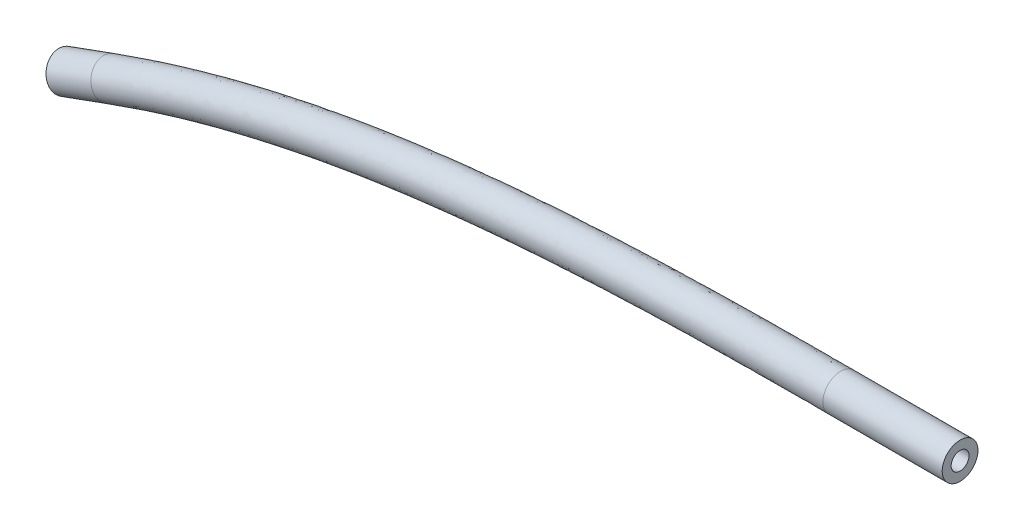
ISO-10303-21;
HEADER;
FILE_DESCRIPTION(('STEP AP214'),'2;1');
FILE_NAME('part.step','',(''),(''),'','','');
FILE_SCHEMA(('AUTOMOTIVE_DESIGN { 1 0 10303 214 1 1 1 1 }'));
ENDSEC;
DATA;
#1=APPLICATION_CONTEXT('core data for automotive mechanical design processes');
#2=APPLICATION_PROTOCOL_DEFINITION('international standard','automotive_design',2000,#1);
#3=PRODUCT_CONTEXT('',#1,'mechanical');
#4=PRODUCT('Part','Part','',(#3));
#5=PRODUCT_RELATED_PRODUCT_CATEGORY('part','',(#4));
#6=PRODUCT_DEFINITION_FORMATION('','',#4);
#7=PRODUCT_DEFINITION_CONTEXT('part definition',#1,'design');
#8=PRODUCT_DEFINITION('design','',#6,#7);
#9=PRODUCT_DEFINITION_SHAPE('','',#8);
#10=(LENGTH_UNIT() NAMED_UNIT(*) SI_UNIT(.MILLI.,.METRE.));
#11=(NAMED_UNIT(*) PLANE_ANGLE_UNIT() SI_UNIT($,.RADIAN.));
#12=(NAMED_UNIT(*) SI_UNIT($,.STERADIAN.) SOLID_ANGLE_UNIT());
#13=UNCERTAINTY_MEASURE_WITH_UNIT(LENGTH_MEASURE(1.E-05),#10,'distance_accuracy_value','');
#14=(GEOMETRIC_REPRESENTATION_CONTEXT(3) GLOBAL_UNCERTAINTY_ASSIGNED_CONTEXT((#13)) GLOBAL_UNIT_ASSIGNED_CONTEXT((#10,
#11,#12)) REPRESENTATION_CONTEXT('',''));
#15=CARTESIAN_POINT('',(0.,0.,0.));
#16=DIRECTION('',(0.,0.,1.));
#17=DIRECTION('',(1.,0.,0.));
#18=AXIS2_PLACEMENT_3D('',#15,#16,#17);
#19=CARTESIAN_POINT('',(7.51754096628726,2.73616114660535,0.));
#20=DIRECTION('',(-0.939692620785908,-0.342020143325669,0.));
#21=DIRECTION('',(0.342020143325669,-0.939692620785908,0.));
#22=AXIS2_PLACEMENT_3D('',#19,#20,#21);
#23=CYLINDRICAL_SURFACE('',#22,3.);
#24=CARTESIAN_POINT('',(7.51754096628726,2.73616114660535,0.));
#25=DIRECTION('',(0.939692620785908,0.34202014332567,0.));
#26=DIRECTION('',(0.,0.,-1.));
#27=AXIS2_PLACEMENT_3D('',#24,#25,#26);
#28=CIRCLE('',#27,3.);
#29=CARTESIAN_POINT('',(7.51754096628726,2.73616114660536,-3.));
#30=VERTEX_POINT('',#29);
#31=EDGE_CURVE('E98',#30,#30,#28,.T.);
#32=ORIENTED_EDGE('',*,*,#31,.F.);
#33=EDGE_LOOP('',(#32));
#34=FACE_BOUND('',#33,.T.);
#35=CARTESIAN_POINT('',(0.,0.,0.));
#36=DIRECTION('',(0.939692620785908,0.34202014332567,0.));
#37=DIRECTION('',(0.,0.,-1.));
#38=AXIS2_PLACEMENT_3D('',#35,#36,#37);
#39=CIRCLE('',#38,3.);
#40=CARTESIAN_POINT('',(0.,0.,-3.));
#41=VERTEX_POINT('',#40);
#42=EDGE_CURVE('E11',#41,#41,#39,.T.);
#43=ORIENTED_EDGE('',*,*,#42,.T.);
#44=EDGE_LOOP('',(#43));
#45=FACE_BOUND('',#44,.T.);
#46=ADVANCED_FACE('F75',(#34,#45),#23,.T.);
#47=CARTESIAN_POINT('',(7.51754096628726,2.73616114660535,0.));
#48=DIRECTION('',(-0.939692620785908,-0.342020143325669,0.));
#49=DIRECTION('',(0.342020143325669,-0.939692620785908,0.));
#50=AXIS2_PLACEMENT_3D('',#47,#48,#49);
#51=CYLINDRICAL_SURFACE('',#50,1.5);
#52=CARTESIAN_POINT('',(7.51754096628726,2.73616114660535,0.));
#53=DIRECTION('',(0.939692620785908,0.34202014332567,0.));
#54=DIRECTION('',(0.,0.,-1.));
#55=AXIS2_PLACEMENT_3D('',#52,#53,#54);
#56=CIRCLE('',#55,1.5);
#57=CARTESIAN_POINT('',(7.51754096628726,2.73616114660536,-1.5));
#58=VERTEX_POINT('',#57);
#59=EDGE_CURVE('E101',#58,#58,#56,.T.);
#60=ORIENTED_EDGE('',*,*,#59,.T.);
#61=EDGE_LOOP('',(#60));
#62=FACE_BOUND('',#61,.T.);
#63=CARTESIAN_POINT('',(0.,0.,0.));
#64=DIRECTION('',(0.939692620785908,0.34202014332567,0.));
#65=DIRECTION('',(0.,0.,-1.));
#66=AXIS2_PLACEMENT_3D('',#63,#64,#65);
#67=CIRCLE('',#66,1.5);
#68=CARTESIAN_POINT('',(0.,0.,-1.5));
#69=VERTEX_POINT('',#68);
#70=EDGE_CURVE('E81',#69,#69,#67,.T.);
#71=ORIENTED_EDGE('',*,*,#70,.F.);
#72=EDGE_LOOP('',(#71));
#73=FACE_BOUND('',#72,.T.);
#74=ADVANCED_FACE('F119',(#62,#73),#51,.F.);
#75=CARTESIAN_POINT('',(130.,18.5,0.));
#76=DIRECTION('',(1.,0.,0.));
#77=DIRECTION('',(0.,0.,-1.));
#78=AXIS2_PLACEMENT_3D('',#75,#76,#77);
#79=CYLINDRICAL_SURFACE('',#78,1.5);
#80=CARTESIAN_POINT('',(130.,18.5,0.));
#81=DIRECTION('',(1.,0.,0.));
#82=DIRECTION('',(0.,0.,-1.));
#83=AXIS2_PLACEMENT_3D('',#80,#81,#82);
#84=CIRCLE('',#83,1.5);
#85=CARTESIAN_POINT('',(130.,18.5,-1.5));
#86=VERTEX_POINT('',#85);
#87=EDGE_CURVE('E85',#86,#86,#84,.T.);
#88=ORIENTED_EDGE('',*,*,#87,.F.);
#89=EDGE_LOOP('',(#88));
#90=FACE_BOUND('',#89,.T.);
#91=CARTESIAN_POINT('',(150.,18.5,0.));
#92=DIRECTION('',(1.,0.,0.));
#93=DIRECTION('',(0.,0.,-1.));
#94=AXIS2_PLACEMENT_3D('',#91,#92,#93);
#95=CIRCLE('',#94,1.5);
#96=CARTESIAN_POINT('',(150.,18.5,-1.5));
#97=VERTEX_POINT('',#96);
#98=EDGE_CURVE('E94',#97,#97,#95,.T.);
#99=ORIENTED_EDGE('',*,*,#98,.T.);
#100=EDGE_LOOP('',(#99));
#101=FACE_BOUND('',#100,.T.);
#102=ADVANCED_FACE('F123',(#90,#101),#79,.F.);
#103=CARTESIAN_POINT('',(130.,18.5,0.));
#104=DIRECTION('',(1.,0.,0.));
#105=DIRECTION('',(0.,0.,-1.));
#106=AXIS2_PLACEMENT_3D('',#103,#104,#105);
#107=CYLINDRICAL_SURFACE('',#106,3.);
#108=CARTESIAN_POINT('',(130.,18.5,0.));
#109=DIRECTION('',(1.,0.,0.));
#110=DIRECTION('',(0.,0.,-1.));
#111=AXIS2_PLACEMENT_3D('',#108,#109,#110);
#112=CIRCLE('',#111,3.);
#113=CARTESIAN_POINT('',(130.,18.5,-3.));
#114=VERTEX_POINT('',#113);
#115=EDGE_CURVE('E96',#114,#114,#112,.T.);
#116=ORIENTED_EDGE('',*,*,#115,.T.);
#117=EDGE_LOOP('',(#116));
#118=FACE_BOUND('',#117,.T.);
#119=CARTESIAN_POINT('',(150.,18.5,0.));
#120=DIRECTION('',(1.,0.,0.));
#121=DIRECTION('',(0.,0.,-1.));
#122=AXIS2_PLACEMENT_3D('',#119,#120,#121);
#123=CIRCLE('',#122,3.);
#124=CARTESIAN_POINT('',(150.,18.5,-3.));
#125=VERTEX_POINT('',#124);
#126=EDGE_CURVE('E89',#125,#125,#123,.T.);
#127=ORIENTED_EDGE('',*,*,#126,.F.);
#128=EDGE_LOOP('',(#127));
#129=FACE_BOUND('',#128,.T.);
#130=ADVANCED_FACE('F107',(#118,#129),#107,.T.);
#131=CARTESIAN_POINT('',(150.,18.5,0.));
#132=DIRECTION('',(1.,0.,0.));
#133=DIRECTION('',(0.,0.,-1.));
#134=AXIS2_PLACEMENT_3D('',#131,#132,#133);
#135=PLANE('',#134);
#136=ORIENTED_EDGE('',*,*,#98,.F.);
#137=EDGE_LOOP('',(#136));
#138=FACE_BOUND('',#137,.T.);
#139=ORIENTED_EDGE('',*,*,#126,.T.);
#140=EDGE_LOOP('',(#139));
#141=FACE_BOUND('',#140,.T.);
#142=ADVANCED_FACE('F134',(#138,#141),#135,.T.);
#143=CARTESIAN_POINT('',(0.,0.,0.));
#144=DIRECTION('',(0.939692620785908,0.34202014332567,0.));
#145=DIRECTION('',(0.,0.,-1.));
#146=AXIS2_PLACEMENT_3D('',#143,#144,#145);
#147=PLANE('',#146);
#148=ORIENTED_EDGE('',*,*,#70,.T.);
#149=EDGE_LOOP('',(#148));
#150=FACE_BOUND('',#149,.T.);
#151=ORIENTED_EDGE('',*,*,#42,.F.);
#152=EDGE_LOOP('',(#151));
#153=FACE_BOUND('',#152,.T.);
#154=ADVANCED_FACE('F114',(#150,#153),#147,.F.);
#155=CARTESIAN_POINT('',(130.,18.5,-3.));
#156=CARTESIAN_POINT('',(117.92604837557,18.5,-3.));
#157=CARTESIAN_POINT('',(94.1610169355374,18.2358171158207,-3.));
#158=CARTESIAN_POINT('',(62.0719861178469,15.8221174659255,-3.));
#159=CARTESIAN_POINT('',(33.2408652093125,10.8285458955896,-3.));
#160=CARTESIAN_POINT('',(16.027521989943,5.83354093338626,-3.));
#161=CARTESIAN_POINT('',(7.51754096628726,2.73616114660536,-3.));
#162=CARTESIAN_POINT('',(130.,12.5,-3.));
#163=CARTESIAN_POINT('',(117.92604837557,12.5,-3.));
#164=CARTESIAN_POINT('',(94.3808682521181,12.2312520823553,-3.));
#165=CARTESIAN_POINT('',(62.7982721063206,9.86701838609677,-3.));
#166=CARTESIAN_POINT('',(34.4573372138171,4.92338621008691,-3.));
#167=CARTESIAN_POINT('',(18.079642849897,0.195385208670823,-3.));
#168=CARTESIAN_POINT('',(9.56966182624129,-2.90199457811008,-3.));
#169=CARTESIAN_POINT('',(130.,12.5,3.));
#170=CARTESIAN_POINT('',(117.92604837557,12.5,3.));
#171=CARTESIAN_POINT('',(94.3808682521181,12.2312520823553,3.));
#172=CARTESIAN_POINT('',(62.7982721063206,9.86701838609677,3.));
#173=CARTESIAN_POINT('',(34.4573372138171,4.92338621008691,3.));
#174=CARTESIAN_POINT('',(18.079642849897,0.195385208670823,3.));
#175=CARTESIAN_POINT('',(9.56966182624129,-2.90199457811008,3.));
#176=CARTESIAN_POINT('',(130.,18.5,3.));
#177=CARTESIAN_POINT('',(117.92604837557,18.5,3.));
#178=CARTESIAN_POINT('',(94.1610169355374,18.2358171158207,3.));
#179=CARTESIAN_POINT('',(62.0719861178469,15.8221174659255,3.));
#180=CARTESIAN_POINT('',(33.2408652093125,10.8285458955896,3.));
#181=CARTESIAN_POINT('',(16.027521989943,5.83354093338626,3.));
#182=CARTESIAN_POINT('',(7.51754096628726,2.73616114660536,3.));
#183=CARTESIAN_POINT('',(130.,24.5,3.));
#184=CARTESIAN_POINT('',(117.92604837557,24.5,3.));
#185=CARTESIAN_POINT('',(93.9411656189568,24.2403821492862,3.));
#186=CARTESIAN_POINT('',(61.3457001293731,21.7772165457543,3.));
#187=CARTESIAN_POINT('',(32.024393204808,16.7337055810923,3.));
#188=CARTESIAN_POINT('',(13.975401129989,11.4716966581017,3.));
#189=CARTESIAN_POINT('',(5.46542010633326,8.37431687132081,3.));
#190=CARTESIAN_POINT('',(130.,24.5,-3.));
#191=CARTESIAN_POINT('',(117.92604837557,24.5,-3.));
#192=CARTESIAN_POINT('',(93.9411656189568,24.2403821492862,-3.));
#193=CARTESIAN_POINT('',(61.3457001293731,21.7772165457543,-3.));
#194=CARTESIAN_POINT('',(32.024393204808,16.7337055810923,-3.));
#195=CARTESIAN_POINT('',(13.975401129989,11.4716966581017,-3.));
#196=CARTESIAN_POINT('',(5.46542010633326,8.37431687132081,-3.));
#197=CARTESIAN_POINT('',(130.,18.5,-3.));
#198=CARTESIAN_POINT('',(117.92604837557,18.5,-3.));
#199=CARTESIAN_POINT('',(94.1610169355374,18.2358171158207,-3.));
#200=CARTESIAN_POINT('',(62.0719861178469,15.8221174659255,-3.));
#201=CARTESIAN_POINT('',(33.2408652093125,10.8285458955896,-3.));
#202=CARTESIAN_POINT('',(16.027521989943,5.83354093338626,-3.));
#203=CARTESIAN_POINT('',(7.51754096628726,2.73616114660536,-3.));
#204=(BOUNDED_SURFACE() B_SPLINE_SURFACE(3,3,((#155,#156,#157,#158,#159,#160,#161),(#162,#163,
#164,#165,#166,#167,#168),(#169,#170,#171,#172,#173,#174,#175),(#176,#177,#178,#179,#180,#181,
#182),(#183,#184,#185,#186,#187,#188,#189),(#190,#191,#192,#193,#194,#195,#196),(#197,#198,#199,
#200,#201,#202,#203)),.UNSPECIFIED.,.T.,.F.,.F.) B_SPLINE_SURFACE_WITH_KNOTS((4,3,4),(4,1,1,1,
4),(0.,0.5,1.),(0.,0.28,0.56,0.780000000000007,1.),
.UNSPECIFIED.) GEOMETRIC_REPRESENTATION_ITEM() RATIONAL_B_SPLINE_SURFACE(((1.,1.,1.,1.,1.,1.,
1.),(0.333333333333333,0.333333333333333,0.333333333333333,0.333333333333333,0.333333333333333,
0.333333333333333,0.333333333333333),(0.333333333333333,0.333333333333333,0.333333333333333,
0.333333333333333,0.333333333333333,0.333333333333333,0.333333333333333),(1.,1.,1.,1.,1.,1.,1.),
(0.333333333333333,0.333333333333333,0.333333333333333,0.333333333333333,0.333333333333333,
0.333333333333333,0.333333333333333),(0.333333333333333,0.333333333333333,0.333333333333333,
0.333333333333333,0.333333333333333,0.333333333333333,0.333333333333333),(1.,1.,1.,1.,1.,1.,1.))) REPRESENTATION_ITEM('') SURFACE());
#205=CARTESIAN_POINT('',(130.,18.5,-3.));
#206=CARTESIAN_POINT('',(129.915788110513,18.4999999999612,-3.));
#207=CARTESIAN_POINT('',(129.831576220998,18.4999935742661,-3.));
#208=CARTESIAN_POINT('',(129.663171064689,18.4999677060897,-3.));
#209=CARTESIAN_POINT('',(129.578977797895,18.4999482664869,-3.));
#210=CARTESIAN_POINT('',(129.410609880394,18.4998962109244,-3.));
#211=CARTESIAN_POINT('',(129.326435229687,18.4998635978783,-3.));
#212=CARTESIAN_POINT('',(129.158104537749,18.4997850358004,-3.));
#213=CARTESIAN_POINT('',(129.073948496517,18.4997390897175,-3.));
#214=CARTESIAN_POINT('',(128.90565501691,18.4996337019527,-3.));
#215=CARTESIAN_POINT('',(128.821517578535,18.499574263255,-3.));
#216=CARTESIAN_POINT('',(128.653261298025,18.4994417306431,-3.));
#217=CARTESIAN_POINT('',(128.569142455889,18.4993686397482,-3.));
#218=CARTESIAN_POINT('',(128.400923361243,18.499208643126,-3.));
#219=CARTESIAN_POINT('',(128.31682310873,18.499121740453,-3.));
#220=CARTESIAN_POINT('',(128.148641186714,18.498933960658,-3.));
#221=CARTESIAN_POINT('',(128.064559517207,18.4988330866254,-3.));
#222=CARTESIAN_POINT('',(127.896414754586,18.498617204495,-3.));
#223=CARTESIAN_POINT('',(127.812351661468,18.4985021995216,-3.));
#224=CARTESIAN_POINT('',(127.644244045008,18.4982578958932,-3.));
#225=CARTESIAN_POINT('',(127.560199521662,18.4981286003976,-3.));
#226=CARTESIAN_POINT('',(127.39212903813,18.4978555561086,-3.));
#227=CARTESIAN_POINT('',(127.308103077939,18.4977118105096,-3.));
#228=CARTESIAN_POINT('',(127.140069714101,18.4974097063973,-3.));
#229=CARTESIAN_POINT('',(127.056062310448,18.4972513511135,-3.));
#230=CARTESIAN_POINT('',(126.88806605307,18.4969198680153,-3.));
#231=CARTESIAN_POINT('',(126.804077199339,18.4967467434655,-3.));
#232=CARTESIAN_POINT('',(126.636118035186,18.4963855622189,-3.));
#233=CARTESIAN_POINT('',(126.552147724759,18.4961975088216,-3.));
#234=CARTESIAN_POINT('',(126.384225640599,18.4958063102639,-3.));
#235=CARTESIAN_POINT('',(126.300273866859,18.4956031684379,-3.));
#236=CARTESIAN_POINT('',(126.132388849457,18.4951816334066,-3.));
#237=CARTESIAN_POINT('',(126.048455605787,18.4949632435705,-3.));
#238=CARTESIAN_POINT('',(125.880607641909,18.494511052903,-3.));
#239=CARTESIAN_POINT('',(125.796692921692,18.4942772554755,-3.));
#240=CARTESIAN_POINT('',(125.628881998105,18.4937940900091,-3.));
#241=CARTESIAN_POINT('',(125.544985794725,18.4935447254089,-3.));
#242=CARTESIAN_POINT('',(125.377211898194,18.493030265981,-3.));
#243=CARTESIAN_POINT('',(125.293334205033,18.4927651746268,-3.));
#244=CARTESIAN_POINT('',(125.125597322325,18.4922191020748,-3.));
#245=CARTESIAN_POINT('',(125.041738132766,18.4919381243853,-3.));
#246=CARTESIAN_POINT('',(124.874038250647,18.4913601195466,-3.));
#247=CARTESIAN_POINT('',(124.790197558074,18.4910630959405,-3.));
#248=CARTESIAN_POINT('',(124.622534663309,18.4904528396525,-3.));
#249=CARTESIAN_POINT('',(124.538712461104,18.4901396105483,-3.));
#250=CARTESIAN_POINT('',(124.37108654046,18.4894967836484,-3.));
#251=CARTESIAN_POINT('',(124.287282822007,18.4891671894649,-3.));
#252=CARTESIAN_POINT('',(124.11969386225,18.4884914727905,-3.));
#253=CARTESIAN_POINT('',(124.035908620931,18.4881453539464,-3.));
#254=CARTESIAN_POINT('',(123.868356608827,18.4874364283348,-3.));
#255=CARTESIAN_POINT('',(123.784589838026,18.4870736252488,-3.));
#256=CARTESIAN_POINT('',(123.617074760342,18.4863311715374,-3.));
#257=CARTESIAN_POINT('',(123.533326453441,18.4859515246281,-3.));
#258=CARTESIAN_POINT('',(123.365848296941,18.4851752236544,-3.));
#259=CARTESIAN_POINT('',(123.282118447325,18.4847785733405,-3.));
#260=CARTESIAN_POINT('',(123.114677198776,18.4839681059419,-3.));
#261=CARTESIAN_POINT('',(123.030965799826,18.483554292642,-3.));
#262=CARTESIAN_POINT('',(122.863561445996,18.4827093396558,-3.));
#263=CARTESIAN_POINT('',(122.779868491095,18.4822782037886,-3.));
#264=CARTESIAN_POINT('',(122.612501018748,18.4813984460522,-3.));
#265=CARTESIAN_POINT('',(122.52882650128,18.4809498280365,-3.));
#266=CARTESIAN_POINT('',(122.361495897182,18.4800349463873,-3.));
#267=CARTESIAN_POINT('',(122.277839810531,18.4795686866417,-3.));
#268=CARTESIAN_POINT('',(122.110546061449,18.4786183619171,-3.));
#269=CARTESIAN_POINT('',(122.026908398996,18.4781343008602,-3.));
#270=CARTESIAN_POINT('',(121.859651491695,18.4771482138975,-3.));
#271=CARTESIAN_POINT('',(121.776032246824,18.4766461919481,-3.));
#272=CARTESIAN_POINT('',(121.608812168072,18.4756240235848,-3.));
#273=CARTESIAN_POINT('',(121.525211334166,18.4751038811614,-3.));
#274=CARTESIAN_POINT('',(121.358028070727,18.4740453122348,-3.));
#275=CARTESIAN_POINT('',(121.274445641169,18.4735068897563,-3.));
#276=CARTESIAN_POINT('',(121.10729917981,18.4724116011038,-3.));
#277=CARTESIAN_POINT('',(121.023735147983,18.4718547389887,-3.));
#278=CARTESIAN_POINT('',(120.856625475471,18.4707224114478,-3.));
#279=CARTESIAN_POINT('',(120.773079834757,18.4701469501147,-3.));
#280=CARTESIAN_POINT('',(120.606006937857,18.4689772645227,-3.));
#281=CARTESIAN_POINT('',(120.522479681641,18.4683830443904,-3.));
#282=CARTESIAN_POINT('',(120.355443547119,18.4671756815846,-3.));
#283=CARTESIAN_POINT('',(120.271934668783,18.4665625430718,-3.));
#284=CARTESIAN_POINT('',(120.104935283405,18.4653171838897,-3.));
#285=CARTESIAN_POINT('',(120.021444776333,18.4646849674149,-3.));
#286=CARTESIAN_POINT('',(119.854482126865,18.4634012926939,-3.));
#287=CARTESIAN_POINT('',(119.771009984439,18.4627498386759,-3.));
#288=CARTESIAN_POINT('',(119.604084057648,18.4614275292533,-3.));
#289=CARTESIAN_POINT('',(119.52063027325,18.4607566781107,-3.));
#290=CARTESIAN_POINT('',(119.353741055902,18.459395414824,-3.));
#291=CARTESIAN_POINT('',(119.270305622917,18.4587050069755,-3.));
#292=CARTESIAN_POINT('',(119.103453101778,18.4573044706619,-3.));
#293=CARTESIAN_POINT('',(119.020036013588,18.4565943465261,-3.));
#294=CARTESIAN_POINT('',(118.853220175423,18.4551542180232,-3.));
#295=CARTESIAN_POINT('',(118.769821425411,18.4544242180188,-3.));
#296=CARTESIAN_POINT('',(118.603042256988,18.4529441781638,-3.));
#297=CARTESIAN_POINT('',(118.519661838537,18.4521941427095,-3.));
#298=CARTESIAN_POINT('',(118.352919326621,18.4506738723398,-3.));
#299=CARTESIAN_POINT('',(118.269557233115,18.4499036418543,-3.));
#300=CARTESIAN_POINT('',(118.102851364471,18.4483428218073,-3.));
#301=CARTESIAN_POINT('',(118.019507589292,18.4475522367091,-3.));
#302=CARTESIAN_POINT('',(117.852838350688,18.4459505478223,-3.));
#303=CARTESIAN_POINT('',(117.76951288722,18.4451394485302,-3.));
#304=CARTESIAN_POINT('',(117.602880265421,18.4434965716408,-3.));
#305=CARTESIAN_POINT('',(117.519573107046,18.4426647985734,-3.));
#306=CARTESIAN_POINT('',(117.352977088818,18.4409804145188,-3.));
#307=CARTESIAN_POINT('',(117.269688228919,18.4401278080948,-3.));
#308=CARTESIAN_POINT('',(117.103128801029,18.4384015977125,-3.));
#309=CARTESIAN_POINT('',(117.01985823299,18.4375279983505,-3.));
#310=CARTESIAN_POINT('',(116.853335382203,18.4357596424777,-3.));
#311=CARTESIAN_POINT('',(116.770083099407,18.4348648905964,-3.));
#312=CARTESIAN_POINT('',(116.603596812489,18.4330540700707,-3.));
#313=CARTESIAN_POINT('',(116.520362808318,18.4321380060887,-3.));
#314=CARTESIAN_POINT('',(116.353913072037,18.4302844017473,-3.));
#315=CARTESIAN_POINT('',(116.270697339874,18.4293468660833,-3.));
#316=CARTESIAN_POINT('',(116.104284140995,18.4274501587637,-3.));
#317=CARTESIAN_POINT('',(116.021086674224,18.4264909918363,-3.));
#318=CARTESIAN_POINT('',(115.854709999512,18.4245508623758,-3.));
#319=CARTESIAN_POINT('',(115.771530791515,18.4235699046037,-3.));
#320=CARTESIAN_POINT('',(115.605190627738,18.4215860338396,-3.));
#321=CARTESIAN_POINT('',(115.522029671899,18.4205831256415,-3.));
#322=CARTESIAN_POINT('',(115.355726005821,18.4185551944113,-3.));
#323=CARTESIAN_POINT('',(115.272583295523,18.4175301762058,-3.));
#324=CARTESIAN_POINT('',(115.106316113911,18.4154578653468,-3.));
#325=CARTESIAN_POINT('',(115.023191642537,18.4144105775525,-3.));
#326=CARTESIAN_POINT('',(114.856960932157,18.4122935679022,-3.));
#327=CARTESIAN_POINT('',(114.77385469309,18.4112238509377,-3.));
#328=CARTESIAN_POINT('',(114.607660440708,18.4090618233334,-3.));
#329=CARTESIAN_POINT('',(114.524572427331,18.4079695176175,-3.));
#330=CARTESIAN_POINT('',(114.358414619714,18.4057621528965,-3.));
#331=CARTESIAN_POINT('',(114.275344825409,18.4046470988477,-3.));
#332=CARTESIAN_POINT('',(114.109223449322,18.4023940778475,-3.));
#333=CARTESIAN_POINT('',(114.026171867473,18.4012561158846,-3.));
#334=CARTESIAN_POINT('',(113.860086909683,18.3989571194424,-3.));
#335=CARTESIAN_POINT('',(113.777053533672,18.397796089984,-3.));
#336=CARTESIAN_POINT('',(113.611004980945,18.3954507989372,-3.));
#337=CARTESIAN_POINT('',(113.527989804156,18.3942665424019,-3.));
#338=CARTESIAN_POINT('',(113.361977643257,18.391874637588,-3.));
#339=CARTESIAN_POINT('',(113.278980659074,18.3906669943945,-3.));
#340=CARTESIAN_POINT('',(113.11300487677,18.3882281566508,-3.));
#341=CARTESIAN_POINT('',(113.030026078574,18.3869969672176,-3.));
#342=CARTESIAN_POINT('',(112.864086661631,18.3845108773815,-3.));
#343=CARTESIAN_POINT('',(112.781126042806,18.3832559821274,-3.));
#344=CARTESIAN_POINT('',(112.61522297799,18.3807223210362,-3.));
#345=CARTESIAN_POINT('',(112.532280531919,18.3794435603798,-3.));
#346=CARTESIAN_POINT('',(112.366413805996,18.3768620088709,-3.));
#347=CARTESIAN_POINT('',(112.283489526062,18.3755592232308,-3.));
#348=CARTESIAN_POINT('',(112.117659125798,18.3729294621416,-3.));
#349=CARTESIAN_POINT('',(112.034753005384,18.3716024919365,-3.));
#350=CARTESIAN_POINT('',(111.868958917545,18.3689242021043,-3.));
#351=CARTESIAN_POINT('',(111.786070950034,18.3675728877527,-3.));
#352=CARTESIAN_POINT('',(111.620313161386,18.3648457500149,-3.));
#353=CARTESIAN_POINT('',(111.537443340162,18.3634699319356,-3.));
#354=CARTESIAN_POINT('',(111.371721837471,18.3606936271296,-3.));
#355=CARTESIAN_POINT('',(111.288870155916,18.3592931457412,-3.));
#356=CARTESIAN_POINT('',(111.123184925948,18.3564673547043,-3.));
#357=CARTESIAN_POINT('',(111.040351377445,18.3550420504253,-3.));
#358=CARTESIAN_POINT('',(110.874702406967,18.3521664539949,-3.));
#359=CARTESIAN_POINT('',(110.791886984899,18.3507161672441,-3.));
#360=CARTESIAN_POINT('',(110.626274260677,18.3477904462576,-3.));
#361=CARTESIAN_POINT('',(110.543476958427,18.3463150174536,-3.));
#362=CARTESIAN_POINT('',(110.377900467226,18.3433388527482,-3.));
#363=CARTESIAN_POINT('',(110.295121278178,18.3418381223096,-3.));
#364=CARTESIAN_POINT('',(110.129581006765,18.3388111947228,-3.));
#365=CARTESIAN_POINT('',(110.0468199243,18.3372850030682,-3.));
#366=CARTESIAN_POINT('',(109.881315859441,18.3342069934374,-3.));
#367=CARTESIAN_POINT('',(109.798572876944,18.3326551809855,-3.));
#368=CARTESIAN_POINT('',(109.633105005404,18.329525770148,-3.));
#369=CARTESIAN_POINT('',(109.550380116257,18.3279481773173,-3.));
#370=CARTESIAN_POINT('',(109.384948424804,18.3247670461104,-3.));
#371=CARTESIAN_POINT('',(109.30224162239,18.3231635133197,-3.));
#372=CARTESIAN_POINT('',(109.136846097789,18.3199303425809,-3.));
#373=CARTESIAN_POINT('',(109.054157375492,18.3183007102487,-3.));
#374=CARTESIAN_POINT('',(108.888798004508,18.3150151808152,-3.));
#375=CARTESIAN_POINT('',(108.80612735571,18.3133592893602,-3.));
#376=CARTESIAN_POINT('',(108.640804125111,18.3100210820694,-3.));
#377=CARTESIAN_POINT('',(108.558151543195,18.3083387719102,-3.));
#378=CARTESIAN_POINT('',(108.392864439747,18.3049475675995,-3.));
#379=CARTESIAN_POINT('',(108.310229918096,18.3032386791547,-3.));
#380=CARTESIAN_POINT('',(108.144978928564,18.2997941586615,-3.));
#381=CARTESIAN_POINT('',(108.062362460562,18.2980585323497,-3.));
#382=CARTESIAN_POINT('',(107.897147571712,18.2945603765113,-3.));
#383=CARTESIAN_POINT('',(107.814549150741,18.2927978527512,-3.));
#384=CARTESIAN_POINT('',(107.64937034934,18.2892457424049,-3.));
#385=CARTESIAN_POINT('',(107.566789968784,18.2874561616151,-3.));
#386=CARTESIAN_POINT('',(107.401647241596,18.2838497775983,-3.));
#387=CARTESIAN_POINT('',(107.319084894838,18.2820329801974,-3.));
#388=CARTESIAN_POINT('',(107.153978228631,18.2783720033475,-3.));
#389=CARTESIAN_POINT('',(107.071433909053,18.276527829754,-3.));
#390=CARTESIAN_POINT('',(106.906363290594,18.2728119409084,-3.));
#391=CARTESIAN_POINT('',(106.823836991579,18.270940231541,-3.));
#392=CARTESIAN_POINT('',(106.658802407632,18.2671691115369,-3.));
#393=CARTESIAN_POINT('',(106.576294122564,18.2652697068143,-3.));
#394=CARTESIAN_POINT('',(106.411295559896,18.2614430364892,-3.));
#395=CARTESIAN_POINT('',(106.328805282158,18.2595157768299,-3.));
#396=CARTESIAN_POINT('',(106.163842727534,18.255633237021,-3.));
#397=CARTESIAN_POINT('',(106.081370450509,18.2536779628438,-3.));
#398=CARTESIAN_POINT('',(105.916443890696,18.2497392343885,-3.));
#399=CARTESIAN_POINT('',(105.833989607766,18.2477557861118,-3.));
#400=CARTESIAN_POINT('',(105.669099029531,18.2437605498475,-3.));
#401=CARTESIAN_POINT('',(105.58666273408,18.24174876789,-3.));
#402=CARTESIAN_POINT('',(105.421808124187,18.237696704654,-3.));
#403=CARTESIAN_POINT('',(105.339389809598,18.2356564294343,-3.));
#404=CARTESIAN_POINT('',(105.174571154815,18.2315472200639,-3.));
#405=CARTESIAN_POINT('',(105.09217081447,18.2294782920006,-3.));
#406=CARTESIAN_POINT('',(104.927388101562,18.2253116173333,-3.));
#407=CARTESIAN_POINT('',(104.845005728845,18.223213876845,-3.));
#408=CARTESIAN_POINT('',(104.680258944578,18.218989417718,-3.));
#409=CARTESIAN_POINT('',(104.597894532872,18.2168627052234,-3.));
#410=CARTESIAN_POINT('',(104.433183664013,18.2125801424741,-3.));
#411=CARTESIAN_POINT('',(104.3508372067,18.2104242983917,-3.));
#412=CARTESIAN_POINT('',(104.186162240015,18.2060833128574,-3.));
#413=CARTESIAN_POINT('',(104.103833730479,18.2038981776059,-3.));
#414=CARTESIAN_POINT('',(103.939194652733,18.199498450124,-3.));
#415=CARTESIAN_POINT('',(103.856884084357,18.1972838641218,-3.));
#416=CARTESIAN_POINT('',(103.692280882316,18.1928250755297,-3.));
#417=CARTESIAN_POINT('',(103.609988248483,18.1905808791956,-3.));
#418=CARTESIAN_POINT('',(103.445420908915,18.1860627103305,-3.));
#419=CARTESIAN_POINT('',(103.363146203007,18.183788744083,-3.));
#420=CARTESIAN_POINT('',(103.198614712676,18.1792108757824,-3.));
#421=CARTESIAN_POINT('',(103.116357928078,18.1769069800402,-3.));
#422=CARTESIAN_POINT('',(102.951862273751,18.1722690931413,-3.));
#423=CARTESIAN_POINT('',(102.869623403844,18.1699351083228,-3.));
#424=CARTESIAN_POINT('',(102.705163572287,18.165236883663,-3.));
#425=CARTESIAN_POINT('',(102.622942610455,18.162872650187,-3.));
#426=CARTESIAN_POINT('',(102.458518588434,18.1581137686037,-3.));
#427=CARTESIAN_POINT('',(102.37631552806,18.1557191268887,-3.));
#428=CARTESIAN_POINT('',(102.211927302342,18.1508992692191,-3.));
#429=CARTESIAN_POINT('',(102.129742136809,18.1484740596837,-3.));
#430=CARTESIAN_POINT('',(101.965389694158,18.1435929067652,-3.));
#431=CARTESIAN_POINT('',(101.883222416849,18.1411369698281,-3.));
#432=CARTESIAN_POINT('',(101.718905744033,18.1361942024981,-3.));
#433=CARTESIAN_POINT('',(101.636756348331,18.1337073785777,-3.));
#434=CARTESIAN_POINT('',(101.472475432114,18.1287026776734,-3.));
#435=CARTESIAN_POINT('',(101.390343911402,18.1261848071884,-3.));
#436=CARTESIAN_POINT('',(101.226098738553,18.1211178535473,-3.));
#437=CARTESIAN_POINT('',(101.143985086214,18.1185687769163,-3.));
#438=CARTESIAN_POINT('',(100.979775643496,18.1134392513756,-3.));
#439=CARTESIAN_POINT('',(100.897679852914,18.1108588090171,-3.));
#440=CARTESIAN_POINT('',(100.733506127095,18.1056663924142,-3.));
#441=CARTESIAN_POINT('',(100.651428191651,18.1030544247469,-3.));
#442=CARTESIAN_POINT('',(100.487290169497,18.0977987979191,-3.));
#443=CARTESIAN_POINT('',(100.405230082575,18.0951551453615,-3.));
#444=CARTESIAN_POINT('',(100.241127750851,18.0898359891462,-3.));
#445=CARTESIAN_POINT('',(100.159085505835,18.0871604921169,-3.));
#446=CARTESIAN_POINT('',(99.995018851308,18.0817774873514,-3.));
#447=CARTESIAN_POINT('',(99.9129944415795,18.079069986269,-3.));
#448=CARTESIAN_POINT('',(99.7489634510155,18.0736228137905,-3.));
#449=CARTESIAN_POINT('',(99.6669568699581,18.0708831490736,-3.));
#450=CARTESIAN_POINT('',(99.502961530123,18.0653714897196,-3.));
#451=CARTESIAN_POINT('',(99.4209727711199,18.0625995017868,-3.));
#452=CARTESIAN_POINT('',(99.2570130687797,18.0570230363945,-3.));
#453=CARTESIAN_POINT('',(99.1750421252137,18.0542185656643,-3.));
#454=CARTESIAN_POINT('',(99.0111180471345,18.0485769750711,-3.));
#455=CARTESIAN_POINT('',(98.9291649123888,18.0457398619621,-3.));
#456=CARTESIAN_POINT('',(98.7652764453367,18.0400328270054,-3.));
#457=CARTESIAN_POINT('',(98.6833411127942,18.0371629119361,-3.));
#458=CARTESIAN_POINT('',(98.5194882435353,18.0313901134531,-3.));
#459=CARTESIAN_POINT('',(98.4375707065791,18.0284872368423,-3.));
#460=CARTESIAN_POINT('',(98.2737534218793,18.0226483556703,-3.));
#461=CARTESIAN_POINT('',(98.1918536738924,18.0197123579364,-3.));
#462=CARTESIAN_POINT('',(98.028071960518,18.0138070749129,-3.));
#463=CARTESIAN_POINT('',(97.9461899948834,18.0108377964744,-3.));
#464=CARTESIAN_POINT('',(97.7824438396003,18.0048657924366,-3.));
#465=CARTESIAN_POINT('',(97.700579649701,18.0018630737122,-3.));
#466=CARTESIAN_POINT('',(97.5368690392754,17.9958240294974,-3.));
#467=CARTESIAN_POINT('',(97.4550226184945,17.9927877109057,-3.));
#468=CARTESIAN_POINT('',(97.2913475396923,17.9866813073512,-3.));
#469=CARTESIAN_POINT('',(97.2095188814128,17.9836112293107,-3.));
#470=CARTESIAN_POINT('',(97.0458793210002,17.9774371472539,-3.));
#471=CARTESIAN_POINT('',(96.9640684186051,17.9743331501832,-3.));
#472=CARTESIAN_POINT('',(96.8004643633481,17.9680910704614,-3.));
#473=CARTESIAN_POINT('',(96.7186712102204,17.964952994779,-3.));
#474=CARTESIAN_POINT('',(96.5551026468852,17.9586425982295,-3.));
#475=CARTESIAN_POINT('',(96.4733272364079,17.955470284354,-3.));
#476=CARTESIAN_POINT('',(96.3097941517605,17.9490912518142,-3.));
#477=CARTESIAN_POINT('',(96.2280364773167,17.9458845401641,-3.));
#478=CARTESIAN_POINT('',(96.0645388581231,17.9394365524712,-3.));
#479=CARTESIAN_POINT('',(95.9827989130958,17.9361952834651,-3.));
#480=CARTESIAN_POINT('',(95.8193367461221,17.9296780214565,-3.));
#481=CARTESIAN_POINT('',(95.7376145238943,17.926402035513,-3.));
#482=CARTESIAN_POINT('',(95.5741877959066,17.919815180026,-3.));
#483=CARTESIAN_POINT('',(95.4924832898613,17.9165043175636,-3.));
#484=CARTESIAN_POINT('',(95.3290919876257,17.9098475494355,-3.));
#485=CARTESIAN_POINT('',(95.247405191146,17.9065016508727,-3.));
#486=CARTESIAN_POINT('',(95.0840493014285,17.8997746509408,-3.));
#487=CARTESIAN_POINT('',(95.0023802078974,17.8963935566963,-3.));
#488=CARTESIAN_POINT('',(94.8390597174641,17.889596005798,-3.));
#489=CARTESIAN_POINT('',(94.7574083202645,17.8861795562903,-3.));
#490=CARTESIAN_POINT('',(94.5941232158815,17.8793111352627,-3.));
#491=CARTESIAN_POINT('',(94.5124895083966,17.8758591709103,-3.));
#492=CARTESIAN_POINT('',(94.3492397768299,17.8689195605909,-3.));
#493=CARTESIAN_POINT('',(94.2676237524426,17.8654319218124,-3.));
#494=CARTESIAN_POINT('',(94.1044093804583,17.8584208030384,-3.));
#495=CARTESIAN_POINT('',(94.0228110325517,17.8548973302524,-3.));
#496=CARTESIAN_POINT('',(93.8596320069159,17.8478143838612,-3.));
#497=CARTESIAN_POINT('',(93.778051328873,17.8442549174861,-3.));
#498=CARTESIAN_POINT('',(93.6149076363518,17.8370998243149,-3.));
#499=CARTESIAN_POINT('',(93.5333446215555,17.8335042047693,-3.));
#500=CARTESIAN_POINT('',(93.3702362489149,17.8262766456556,-3.));
#501=CARTESIAN_POINT('',(93.2886908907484,17.822644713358,-3.));
#502=CARTESIAN_POINT('',(93.1256178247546,17.8153443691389,-3.));
#503=CARTESIAN_POINT('',(93.0440901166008,17.811675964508,-3.));
#504=CARTESIAN_POINT('',(92.8810523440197,17.8043025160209,-3.));
#505=CARTESIAN_POINT('',(92.7995422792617,17.8005974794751,-3.));
#506=CARTESIAN_POINT('',(92.6365397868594,17.7931506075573,-3.));
#507=CARTESIAN_POINT('',(92.5550473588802,17.7894087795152,-3.));
#508=CARTESIAN_POINT('',(92.3920801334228,17.781888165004,-3.));
#509=CARTESIAN_POINT('',(92.3106053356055,17.7781093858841,-3.));
#510=CARTESIAN_POINT('',(92.1476733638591,17.7705147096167,-3.));
#511=CARTESIAN_POINT('',(92.0662161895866,17.7666988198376,-3.));
#512=CARTESIAN_POINT('',(91.9033194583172,17.7590297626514,-3.));
#513=CARTESIAN_POINT('',(91.8218799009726,17.7551766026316,-3.));
#514=CARTESIAN_POINT('',(91.6590183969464,17.7474328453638,-3.));
#515=CARTESIAN_POINT('',(91.5775964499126,17.7435422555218,-3.));
#516=CARTESIAN_POINT('',(91.4147701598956,17.7357234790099,-3.));
#517=CARTESIAN_POINT('',(91.3333658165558,17.7317952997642,-3.));
#518=CARTESIAN_POINT('',(91.1705747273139,17.7239011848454,-3.));
#519=CARTESIAN_POINT('',(91.0891879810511,17.7199352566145,-3.));
#520=CARTESIAN_POINT('',(90.9264320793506,17.7119654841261,-3.));
#521=CARTESIAN_POINT('',(90.8450629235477,17.7079616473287,-3.));
#522=CARTESIAN_POINT('',(90.6823421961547,17.6999158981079,-3.));
#523=CARTESIAN_POINT('',(90.6009906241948,17.6958739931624,-3.));
#524=CARTESIAN_POINT('',(90.4383050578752,17.6877519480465,-3.));
#525=CARTESIAN_POINT('',(90.3569710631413,17.6836718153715,-3.));
#526=CARTESIAN_POINT('',(90.1943206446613,17.6754731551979,-3.));
#527=CARTESIAN_POINT('',(90.1130042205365,17.6713546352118,-3.));
#528=CARTESIAN_POINT('',(89.9503889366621,17.6630790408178,-3.));
#529=CARTESIAN_POINT('',(89.8690900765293,17.6589219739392,-3.));
#530=CARTESIAN_POINT('',(89.7065099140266,17.650569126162,-3.));
#531=CARTESIAN_POINT('',(89.6252286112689,17.6463733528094,-3.));
#532=CARTESIAN_POINT('',(89.4626835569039,17.6379429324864,-3.));
#533=CARTESIAN_POINT('',(89.3814198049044,17.6337082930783,-3.));
#534=CARTESIAN_POINT('',(89.2189098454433,17.6251999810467,-3.));
#535=CARTESIAN_POINT('',(89.1376636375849,17.6209263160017,-3.));
#536=CARTESIAN_POINT('',(88.9751887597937,17.6123397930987,-3.));
#537=CARTESIAN_POINT('',(88.8939600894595,17.6080269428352,-3.));
#538=CARTESIAN_POINT('',(88.7315202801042,17.5993618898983,-3.));
#539=CARTESIAN_POINT('',(88.6503091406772,17.5950096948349,-3.));
#540=CARTESIAN_POINT('',(88.487904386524,17.5862657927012,-3.));
#541=CARTESIAN_POINT('',(88.4067107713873,17.5818740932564,-3.));
#542=CARTESIAN_POINT('',(88.2443410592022,17.5730510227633,-3.));
#543=CARTESIAN_POINT('',(88.1631649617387,17.5686196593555,-3.));
#544=CARTESIAN_POINT('',(88.0008302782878,17.5597171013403,-3.));
#545=CARTESIAN_POINT('',(87.9196716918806,17.5552459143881,-3.));
#546=CARTESIAN_POINT('',(87.7573720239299,17.546263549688,-3.));
#547=CARTESIAN_POINT('',(87.676230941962,17.5417523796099,-3.));
#548=CARTESIAN_POINT('',(87.5139662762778,17.5326898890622,-3.));
#549=CARTESIAN_POINT('',(87.4328426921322,17.5281385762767,-3.));
#550=CARTESIAN_POINT('',(87.2706130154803,17.5189956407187,-3.));
#551=CARTESIAN_POINT('',(87.1895069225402,17.5144040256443,-3.));
#552=CARTESIAN_POINT('',(87.0273122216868,17.5051803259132,-3.));
#553=CARTESIAN_POINT('',(86.946223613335,17.5005482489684,-3.));
#554=CARTESIAN_POINT('',(86.7840638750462,17.4912434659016,-3.));
#555=CARTESIAN_POINT('',(86.7029927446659,17.4865707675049,-3.));
#556=CARTESIAN_POINT('',(86.5408679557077,17.4771845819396,-3.));
#557=CARTESIAN_POINT('',(86.4598142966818,17.4724711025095,-3.));
#558=CARTESIAN_POINT('',(86.2977244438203,17.463003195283,-3.));
#559=CARTESIAN_POINT('',(86.216688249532,17.458248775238,-3.));
#560=CARTESIAN_POINT('',(86.0546333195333,17.4486988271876,-3.));
#561=CARTESIAN_POINT('',(85.9736145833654,17.4439033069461,-3.));
#562=CARTESIAN_POINT('',(85.8115945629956,17.4342709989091,-3.));
#563=CARTESIAN_POINT('',(85.7305932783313,17.4294342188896,-3.));
#564=CARTESIAN_POINT('',(85.5686081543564,17.4197192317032,-3.));
#565=CARTESIAN_POINT('',(85.4876243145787,17.4148410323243,-3.));
#566=CARTESIAN_POINT('',(85.3256740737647,17.4050430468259,-3.));
#567=CARTESIAN_POINT('',(85.2447076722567,17.400123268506,-3.));
#568=CARTESIAN_POINT('',(85.0827923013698,17.3902419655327,-3.));
#569=CARTESIAN_POINT('',(85.0018433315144,17.3852804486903,-3.));
#570=CARTESIAN_POINT('',(84.8399628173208,17.3753155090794,-3.));
#571=CARTESIAN_POINT('',(84.759031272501,17.3703120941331,-3.));
#572=CARTESIAN_POINT('',(84.5971856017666,17.3602631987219,-3.));
#573=CARTESIAN_POINT('',(84.5162714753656,17.3552177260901,-3.));
#574=CARTESIAN_POINT('',(84.3544606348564,17.3450845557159,-3.));
#575=CARTESIAN_POINT('',(84.2735639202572,17.339996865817,-3.));
#576=CARTESIAN_POINT('',(84.1117878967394,17.329779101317,-3.));
#577=CARTESIAN_POINT('',(84.0309085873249,17.3246490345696,-3.));
#578=CARTESIAN_POINT('',(83.8691673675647,17.3143463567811,-3.));
#579=CARTESIAN_POINT('',(83.788305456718,17.3091737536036,-3.));
#580=CARTESIAN_POINT('',(83.6265990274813,17.2987858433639,-3.));
#581=CARTESIAN_POINT('',(83.5457545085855,17.2935705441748,-3.));
#582=CARTESIAN_POINT('',(83.3840828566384,17.2830970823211,-3.));
#583=CARTESIAN_POINT('',(83.3032557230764,17.2778389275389,-3.));
#584=CARTESIAN_POINT('',(83.141618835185,17.2672795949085,-3.));
#585=CARTESIAN_POINT('',(83.06080908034,17.2619784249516,-3.));
#586=CARTESIAN_POINT('',(82.8992069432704,17.2513329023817,-3.));
#587=CARTESIAN_POINT('',(82.8184145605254,17.2459885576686,-3.));
#588=CARTESIAN_POINT('',(82.6568471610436,17.2352565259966,-3.));
#589=CARTESIAN_POINT('',(82.5760721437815,17.2298688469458,-3.));
#590=CARTESIAN_POINT('',(82.4145394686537,17.2190499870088,-3.));
#591=CARTESIAN_POINT('',(82.3337818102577,17.2136188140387,-3.));
#592=CARTESIAN_POINT('',(82.1722838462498,17.202712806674,-3.));
#593=CARTESIAN_POINT('',(82.0915435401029,17.1972379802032,-3.));
#594=CARTESIAN_POINT('',(81.9300802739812,17.1862445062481,-3.));
#595=CARTESIAN_POINT('',(81.8493573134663,17.1807258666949,-3.));
#596=CARTESIAN_POINT('',(81.6879287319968,17.1696446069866,-3.));
#597=CARTESIAN_POINT('',(81.6072231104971,17.1640819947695,-3.));
#598=CARTESIAN_POINT('',(81.4458292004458,17.1529126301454,-3.));
#599=CARTESIAN_POINT('',(81.3651409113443,17.1473058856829,-3.));
#600=CARTESIAN_POINT('',(81.2037816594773,17.13604809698,-3.));
#601=CARTESIAN_POINT('',(81.1231106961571,17.1303970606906,-3.));
#602=CARTESIAN_POINT('',(80.9617860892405,17.1190505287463,-3.));
#603=CARTESIAN_POINT('',(80.8811324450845,17.1133550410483,-3.));
#604=CARTESIAN_POINT('',(80.7198424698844,17.1019194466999,-3.));
#605=CARTESIAN_POINT('',(80.6392061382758,17.0961793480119,-3.));
#606=CARTESIAN_POINT('',(80.4779507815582,17.0846543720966,-3.));
#607=CARTESIAN_POINT('',(80.39733175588,17.0788695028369,-3.));
#608=CARTESIAN_POINT('',(80.2361110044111,17.0672548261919,-3.));
#609=CARTESIAN_POINT('',(80.1555092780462,17.0614250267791,-3.));
#610=CARTESIAN_POINT('',(79.9943231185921,17.0497203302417,-3.));
#611=CARTESIAN_POINT('',(79.9137386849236,17.0438454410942,-3.));
#612=CARTESIAN_POINT('',(79.7525871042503,17.0320504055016,-3.));
#613=CARTESIAN_POINT('',(79.6720199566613,17.0261302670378,-3.));
#614=CARTESIAN_POINT('',(79.510902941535,17.0142445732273,-3.));
#615=CARTESIAN_POINT('',(79.4303530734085,17.0082790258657,-3.));
#616=CARTESIAN_POINT('',(79.2692706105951,16.9963023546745,-3.));
#617=CARTESIAN_POINT('',(79.1887380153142,16.9902912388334,-3.));
#618=CARTESIAN_POINT('',(79.0276900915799,16.9782232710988,-3.));
#619=CARTESIAN_POINT('',(78.9471747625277,16.9721664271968,-3.));
#620=CARTESIAN_POINT('',(78.7861613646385,16.960006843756,-3.));
#621=CARTESIAN_POINT('',(78.7056632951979,16.9539041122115,-3.));
#622=CARTESIAN_POINT('',(78.54468440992,16.9416525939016,-3.));
#623=CARTESIAN_POINT('',(78.4642035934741,16.9355038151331,-3.));
#624=CARTESIAN_POINT('',(78.3032592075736,16.9231600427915,-3.));
#625=CARTESIAN_POINT('',(78.2227956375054,16.9169650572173,-3.));
#626=CARTESIAN_POINT('',(78.0618857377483,16.9045287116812,-3.));
#627=CARTESIAN_POINT('',(77.9814394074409,16.8982873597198,-3.));
#628=CARTESIAN_POINT('',(77.8205639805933,16.8857581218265,-3.));
#629=CARTESIAN_POINT('',(77.7401348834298,16.8794702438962,-3.));
#630=CARTESIAN_POINT('',(77.5792939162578,16.8668477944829,-3.));
#631=CARTESIAN_POINT('',(77.4988820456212,16.8605132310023,-3.));
#632=CARTESIAN_POINT('',(77.3380755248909,16.8477972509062,-3.));
#633=CARTESIAN_POINT('',(77.2576808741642,16.8414158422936,-3.));
#634=CARTESIAN_POINT('',(77.0969087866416,16.8286060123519,-3.));
#635=CARTESIAN_POINT('',(77.016531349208,16.8221775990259,-3.));
#636=CARTESIAN_POINT('',(76.8557936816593,16.8092736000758,-3.));
#637=CARTESIAN_POINT('',(76.7754334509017,16.8027980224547,-3.));
#638=CARTESIAN_POINT('',(76.614730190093,16.7897995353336,-3.));
#639=CARTESIAN_POINT('',(76.5343871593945,16.7832766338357,-3.));
#640=CARTESIAN_POINT('',(76.3737182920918,16.7701833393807,-3.));
#641=CARTESIAN_POINT('',(76.2933924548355,16.7636129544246,-3.));
#642=CARTESIAN_POINT('',(76.1327579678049,16.750424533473,-3.));
#643=CARTESIAN_POINT('',(76.0524493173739,16.743806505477,-3.));
#644=CARTESIAN_POINT('',(75.8918491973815,16.7305226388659,-3.));
#645=CARTESIAN_POINT('',(75.8115577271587,16.7238568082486,-3.));
#646=CARTESIAN_POINT('',(75.6509919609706,16.7104771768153,-3.));
#647=CARTESIAN_POINT('',(75.5707176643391,16.7037633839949,-3.));
#648=CARTESIAN_POINT('',(75.4101862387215,16.6902876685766,-3.));
#649=CARTESIAN_POINT('',(75.3299291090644,16.6835257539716,-3.));
#650=CARTESIAN_POINT('',(75.1694320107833,16.6699536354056,-3.));
#651=CARTESIAN_POINT('',(75.0891920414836,16.6631434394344,-3.));
#652=CARTESIAN_POINT('',(74.9287292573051,16.6494745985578,-3.));
#653=CARTESIAN_POINT('',(74.8485064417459,16.6426159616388,-3.));
#654=CARTESIAN_POINT('',(74.6880779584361,16.6288500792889,-3.));
#655=CARTESIAN_POINT('',(74.6078722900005,16.6219428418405,-3.));
#656=CARTESIAN_POINT('',(74.4474780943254,16.6080795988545,-3.));
#657=CARTESIAN_POINT('',(74.3672895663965,16.6011236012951,-3.));
#658=CARTESIAN_POINT('',(74.2069296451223,16.5871626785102,-3.));
#659=CARTESIAN_POINT('',(74.126758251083,16.5801577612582,-3.));
#660=CARTESIAN_POINT('',(73.9664325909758,16.5660988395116,-3.));
#661=CARTESIAN_POINT('',(73.8862783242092,16.5590448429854,-3.));
#662=CARTESIAN_POINT('',(73.7259869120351,16.5448876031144,-3.));
#663=CARTESIAN_POINT('',(73.6458497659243,16.5377843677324,-3.));
#664=CARTESIAN_POINT('',(73.4855925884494,16.5235284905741,-3.));
#665=CARTESIAN_POINT('',(73.4054725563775,16.5163758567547,-3.));
#666=CARTESIAN_POINT('',(73.2452496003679,16.5020210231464,-3.));
#667=CARTESIAN_POINT('',(73.1651466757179,16.4948188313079,-3.));
#668=CARTESIAN_POINT('',(73.0049579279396,16.4803647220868,-3.));
#669=CARTESIAN_POINT('',(72.9248721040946,16.4731128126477,-3.));
#670=CARTESIAN_POINT('',(72.7647175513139,16.4585591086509,-3.));
#671=CARTESIAN_POINT('',(72.6846488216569,16.4512573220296,-3.));
#672=CARTESIAN_POINT('',(72.5245284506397,16.4366037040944,-3.));
#673=CARTESIAN_POINT('',(72.4444768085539,16.4292518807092,-3.));
#674=CARTESIAN_POINT('',(72.2843906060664,16.4144980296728,-3.));
#675=CARTESIAN_POINT('',(72.2043560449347,16.4070960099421,-3.));
#676=CARTESIAN_POINT('',(72.044303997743,16.3922416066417,-3.));
#677=CARTESIAN_POINT('',(71.9642865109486,16.3847892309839,-3.));
#678=CARTESIAN_POINT('',(71.8042686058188,16.3698339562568,-3.));
#679=CARTESIAN_POINT('',(71.7242681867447,16.3623310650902,-3.));
#680=CARTESIAN_POINT('',(71.5642844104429,16.3472745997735,-3.));
#681=CARTESIAN_POINT('',(71.4843010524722,16.3397210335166,-3.));
#682=CARTESIAN_POINT('',(71.3243513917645,16.3245630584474,-3.));
#683=CARTESIAN_POINT('',(71.2443850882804,16.3169586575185,-3.));
#684=CARTESIAN_POINT('',(71.0844695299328,16.3016988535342,-3.));
#685=CARTESIAN_POINT('',(71.0045202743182,16.2940434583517,-3.));
#686=CARTESIAN_POINT('',(70.844638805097,16.2786815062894,-3.));
#687=CARTESIAN_POINT('',(70.764706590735,16.2709749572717,-3.));
#688=CARTESIAN_POINT('',(70.6048591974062,16.2555105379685,-3.));
#689=CARTESIAN_POINT('',(70.5249440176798,16.2477526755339,-3.));
#690=CARTESIAN_POINT('',(70.3651306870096,16.2321854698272,-3.));
#691=CARTESIAN_POINT('',(70.285232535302,16.2243761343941,-3.));
#692=CARTESIAN_POINT('',(70.1254532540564,16.208705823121,-3.));
#693=CARTESIAN_POINT('',(70.0455721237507,16.2008448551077,-3.));
#694=CARTESIAN_POINT('',(69.8858268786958,16.1850711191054,-3.));
#695=CARTESIAN_POINT('',(69.805962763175,16.1771583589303,-3.));
#696=CARTESIAN_POINT('',(69.646251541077,16.1612808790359,-3.));
#697=CARTESIAN_POINT('',(69.5664044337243,16.1533161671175,-3.));
#698=CARTESIAN_POINT('',(69.4067272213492,16.1373346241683,-3.));
#699=CARTESIAN_POINT('',(69.3268971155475,16.1293178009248,-3.));
#700=CARTESIAN_POINT('',(69.1672538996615,16.1132318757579,-3.));
#701=CARTESIAN_POINT('',(69.087440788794,16.1051627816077,-3.));
#702=CARTESIAN_POINT('',(68.9278315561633,16.0889721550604,-3.));
#703=CARTESIAN_POINT('',(68.848035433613,16.0808506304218,-3.));
#704=CARTESIAN_POINT('',(68.6884601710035,16.0645549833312,-3.));
#705=CARTESIAN_POINT('',(68.6086810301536,16.0563808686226,-3.));
#706=CARTESIAN_POINT('',(68.4491397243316,16.039979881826,-3.));
#707=CARTESIAN_POINT('',(68.369377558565,16.0317530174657,-3.));
#708=CARTESIAN_POINT('',(68.2098701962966,16.0152463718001,-3.));
#709=CARTESIAN_POINT('',(68.1301249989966,16.0069665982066,-3.));
#710=CARTESIAN_POINT('',(67.9706515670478,15.9903539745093,-3.));
#711=CARTESIAN_POINT('',(67.8909233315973,15.9820211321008,-3.));
#712=CARTESIAN_POINT('',(67.7314838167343,15.965302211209,-3.));
#713=CARTESIAN_POINT('',(67.6517725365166,15.9569161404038,-3.));
#714=CARTESIAN_POINT('',(67.4923669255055,15.9400906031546,-3.));
#715=CARTESIAN_POINT('',(67.4126725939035,15.9316511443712,-3.));
#716=CARTESIAN_POINT('',(67.2533008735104,15.9147186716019,-3.));
#717=CARTESIAN_POINT('',(67.1736234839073,15.9062256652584,-3.));
#718=CARTESIAN_POINT('',(67.0142856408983,15.8891859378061,-3.));
#719=CARTESIAN_POINT('',(66.9346251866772,15.8806392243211,-3.));
#720=CARTESIAN_POINT('',(66.7753212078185,15.863491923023,-3.));
#721=CARTESIAN_POINT('',(66.6956776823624,15.8548913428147,-3.));
#722=CARTESIAN_POINT('',(66.5364075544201,15.8376361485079,-3.));
#723=CARTESIAN_POINT('',(66.4567809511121,15.8289815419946,-3.));
#724=CARTESIAN_POINT('',(66.2975446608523,15.8116181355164,-3.));
#725=CARTESIAN_POINT('',(66.2179349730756,15.8029093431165,-3.));
#726=CARTESIAN_POINT('',(66.0587325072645,15.7854374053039,-3.));
#727=CARTESIAN_POINT('',(65.9791397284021,15.7766742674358,-3.));
#728=CARTESIAN_POINT('',(65.8199710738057,15.7590934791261,-3.));
#729=CARTESIAN_POINT('',(65.7403951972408,15.750275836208,-3.));
#730=CARTESIAN_POINT('',(65.5812603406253,15.7325858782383,-3.));
#731=CARTESIAN_POINT('',(65.5017013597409,15.7237135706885,-3.));
#732=CARTESIAN_POINT('',(65.3426002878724,15.7059141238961,-3.));
#733=CARTESIAN_POINT('',(65.2630581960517,15.696986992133,-3.));
#734=CARTESIAN_POINT('',(65.1039908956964,15.6790777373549,-3.));
#735=CARTESIAN_POINT('',(65.0244656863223,15.6700956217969,-3.));
#736=CARTESIAN_POINT('',(64.8654321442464,15.6520762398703,-3.));
#737=CARTESIAN_POINT('',(64.7859238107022,15.6430389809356,-3.));
#738=CARTESIAN_POINT('',(64.6269240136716,15.6249091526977,-3.));
#739=CARTESIAN_POINT('',(64.5474325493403,15.6158165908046,-3.));
#740=CARTESIAN_POINT('',(64.3884664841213,15.5975759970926,-3.));
#741=CARTESIAN_POINT('',(64.3089918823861,15.5884279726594,-3.));
#742=CARTESIAN_POINT('',(64.1500595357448,15.5700762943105,-3.));
#743=CARTESIAN_POINT('',(64.0706017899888,15.5608726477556,-3.));
#744=CARTESIAN_POINT('',(63.9117031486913,15.5424095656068,-3.));
#745=CARTESIAN_POINT('',(63.8322622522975,15.5331501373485,-3.));
#746=CARTESIAN_POINT('',(63.67339730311,15.5145753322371,-3.));
#747=CARTESIAN_POINT('',(63.5939732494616,15.5052599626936,-3.));
#748=CARTESIAN_POINT('',(63.4351419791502,15.4865731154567,-3.));
#749=CARTESIAN_POINT('',(63.3557347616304,15.4772016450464,-3.));
#750=CARTESIAN_POINT('',(63.1969371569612,15.4584024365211,-3.));
#751=CARTESIAN_POINT('',(63.1175467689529,15.4489747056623,-3.));
#752=CARTESIAN_POINT('',(62.9587828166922,15.4300628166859,-3.));
#753=CARTESIAN_POINT('',(62.8794092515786,15.4205786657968,-3.));
#754=CARTESIAN_POINT('',(62.7206789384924,15.4015537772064,-3.));
#755=CARTESIAN_POINT('',(62.6413221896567,15.3920130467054,-3.));
#756=CARTESIAN_POINT('',(62.4826255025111,15.3728748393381,-3.));
#757=CARTESIAN_POINT('',(62.4032855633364,15.3632773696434,-3.));
#758=CARTESIAN_POINT('',(62.2446224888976,15.3440255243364,-3.));
#759=CARTESIAN_POINT('',(62.165299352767,15.3343711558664,-3.));
#760=CARTESIAN_POINT('',(62.0066698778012,15.3150053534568,-3.));
#761=CARTESIAN_POINT('',(61.9273635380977,15.3052939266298,-3.));
#762=CARTESIAN_POINT('',(61.7687676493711,15.2858138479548,-3.));
#763=CARTESIAN_POINT('',(61.6894780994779,15.276045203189,-3.));
#764=CARTESIAN_POINT('',(61.5309157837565,15.2564505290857,-3.));
#765=CARTESIAN_POINT('',(61.4516430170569,15.2466245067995,-3.));
#766=CARTESIAN_POINT('',(61.2931142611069,15.226914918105,-3.));
#767=CARTESIAN_POINT('',(61.2138582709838,15.2170313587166,-3.));
#768=CARTESIAN_POINT('',(61.0553630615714,15.1972065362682,-3.));
#769=CARTESIAN_POINT('',(60.976123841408,15.1872652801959,-3.));
#770=CARTESIAN_POINT('',(60.8176621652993,15.1673249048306,-3.));
#771=CARTESIAN_POINT('',(60.7384397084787,15.1573257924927,-3.));
#772=CARTESIAN_POINT('',(60.5800115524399,15.1372695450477,-3.));
#773=CARTESIAN_POINT('',(60.5008058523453,15.1272124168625,-3.));
#774=CARTESIAN_POINT('',(60.3424112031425,15.1070399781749,-3.));
#775=CARTESIAN_POINT('',(60.263222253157,15.0969246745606,-3.));
#776=CARTESIAN_POINT('',(60.1048610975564,15.0766357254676,-3.));
#777=CARTESIAN_POINT('',(60.0256888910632,15.0664620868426,-3.));
#778=CARTESIAN_POINT('',(59.8673612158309,15.0460563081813,-3.));
#779=CARTESIAN_POINT('',(59.7882057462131,15.0358241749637,-3.));
#780=CARTESIAN_POINT('',(59.6299115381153,15.0153012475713,-3.));
#781=CARTESIAN_POINT('',(59.5507727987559,15.0050104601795,-3.));
#782=CARTESIAN_POINT('',(59.3925120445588,14.984370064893,-3.));
#783=CARTESIAN_POINT('',(59.3133900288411,14.9740204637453,-3.));
#784=CARTESIAN_POINT('',(59.1551627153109,14.9532622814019,-3.));
#785=CARTESIAN_POINT('',(59.076057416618,14.9428537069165,-3.));
#786=CARTESIAN_POINT('',(58.9178635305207,14.9219774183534,-3.));
#787=CARTESIAN_POINT('',(58.8387749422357,14.9115097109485,-3.));
#788=CARTESIAN_POINT('',(58.6806144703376,14.8905149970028,-3.));
#789=CARTESIAN_POINT('',(58.6015425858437,14.8799879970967,-3.));
#790=CARTESIAN_POINT('',(58.4434155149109,14.8588745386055,-3.));
#791=CARTESIAN_POINT('',(58.3643603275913,14.8482880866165,-3.));
#792=CARTESIAN_POINT('',(58.20626664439,14.827055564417,-3.));
#793=CARTESIAN_POINT('',(58.1272281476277,14.8164095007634,-3.));
#794=CARTESIAN_POINT('',(57.9691678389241,14.7950575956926,-3.));
#795=CARTESIAN_POINT('',(57.8901460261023,14.7843517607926,-3.));
#796=CARTESIAN_POINT('',(57.7321190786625,14.7628801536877,-3.));
#797=CARTESIAN_POINT('',(57.6531139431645,14.7521143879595,-3.));
#798=CARTESIAN_POINT('',(57.4951203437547,14.7305227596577,-3.));
#799=CARTESIAN_POINT('',(57.4161318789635,14.7196969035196,-3.));
#800=CARTESIAN_POINT('',(57.2581716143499,14.6979849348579,-3.));
#801=CARTESIAN_POINT('',(57.1791998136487,14.6870988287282,-3.));
#802=CARTESIAN_POINT('',(57.0212728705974,14.6652662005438,-3.));
#803=CARTESIAN_POINT('',(56.9423177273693,14.6543196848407,-3.));
#804=CARTESIAN_POINT('',(56.7844240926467,14.6323660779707,-3.));
#805=CARTESIAN_POINT('',(56.7054856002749,14.6213589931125,-3.));
#806=CARTESIAN_POINT('',(56.5476252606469,14.599284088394,-3.));
#807=CARTESIAN_POINT('',(56.4687034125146,14.5882162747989,-3.));
#808=CARTESIAN_POINT('',(56.3108763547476,14.566019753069,-3.));
#809=CARTESIAN_POINT('',(56.2319711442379,14.5548910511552,-3.));
#810=CARTESIAN_POINT('',(56.074177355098,14.5325725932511,-3.));
#811=CARTESIAN_POINT('',(55.9952887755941,14.5213828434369,-3.));
#812=CARTESIAN_POINT('',(55.8375282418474,14.4989421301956,-3.));
#813=CARTESIAN_POINT('',(55.7586562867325,14.4876911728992,-3.));
#814=CARTESIAN_POINT('',(55.6009289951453,14.4651278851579,-3.));
#815=CARTESIAN_POINT('',(55.5220736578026,14.4538155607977,-3.));
#816=CARTESIAN_POINT('',(55.364379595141,14.4311293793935,-3.));
#817=CARTESIAN_POINT('',(55.2855408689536,14.4197555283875,-3.));
#818=CARTESIAN_POINT('',(55.1278800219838,14.3969461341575,-3.));
#819=CARTESIAN_POINT('',(55.0490579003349,14.385510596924,-3.));
#820=CARTESIAN_POINT('',(54.8914302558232,14.3625776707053,-3.));
#821=CARTESIAN_POINT('',(54.8126247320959,14.3510802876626,-3.));
#822=CARTESIAN_POINT('',(54.6550302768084,14.3280235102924,-3.));
#823=CARTESIAN_POINT('',(54.576241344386,14.3164641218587,-3.));
#824=CARTESIAN_POINT('',(54.4186800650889,14.293283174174,-3.));
#825=CARTESIAN_POINT('',(54.3399077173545,14.2816616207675,-3.));
#826=CARTESIAN_POINT('',(54.182379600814,14.2583561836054,-3.));
#827=CARTESIAN_POINT('',(54.1036238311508,14.2466723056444,-3.));
#828=CARTESIAN_POINT('',(53.9461288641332,14.2232420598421,-3.));
#829=CARTESIAN_POINT('',(53.8673896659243,14.2114956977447,-3.));
#830=CARTESIAN_POINT('',(53.7099278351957,14.1879403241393,-3.));
#831=CARTESIAN_POINT('',(53.6312052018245,14.1761313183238,-3.));
#832=CARTESIAN_POINT('',(53.4737764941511,14.1524504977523,-3.));
#833=CARTESIAN_POINT('',(53.3950704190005,14.1405786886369,-3.));
#834=CARTESIAN_POINT('',(53.2376748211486,14.1167721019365,-3.));
#835=CARTESIAN_POINT('',(53.158985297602,14.1048373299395,-3.));
#836=CARTESIAN_POINT('',(53.0016227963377,14.0809046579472,-3.));
#837=CARTESIAN_POINT('',(52.9229498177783,14.0689067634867,-3.));
#838=CARTESIAN_POINT('',(52.7656203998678,14.0448476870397,-3.));
#839=CARTESIAN_POINT('',(52.6869639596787,14.032786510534,-3.));
#840=CARTESIAN_POINT('',(52.5296676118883,14.0086007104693,-3.));
#841=CARTESIAN_POINT('',(52.4510277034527,13.9964760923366,-3.));
#842=CARTESIAN_POINT('',(52.2937644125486,13.9721632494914,-3.));
#843=CARTESIAN_POINT('',(52.2151410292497,13.9599750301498,-3.));
#844=CARTESIAN_POINT('',(52.057910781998,13.9355348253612,-3.));
#845=CARTESIAN_POINT('',(51.9793039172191,13.923282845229,-3.));
#846=CARTESIAN_POINT('',(51.8221067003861,13.898714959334,-3.));
#847=CARTESIAN_POINT('',(51.7435163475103,13.8863990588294,-3.));
#848=CARTESIAN_POINT('',(51.5863521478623,13.8617031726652,-3.));
#849=CARTESIAN_POINT('',(51.5077783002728,13.8493231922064,-3.));
#850=CARTESIAN_POINT('',(51.3506471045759,13.8244989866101,-3.));
#851=CARTESIAN_POINT('',(51.272089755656,13.8120547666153,-3.));
#852=CARTESIAN_POINT('',(51.1149915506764,13.7871019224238,-3.));
#853=CARTESIAN_POINT('',(51.0364506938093,13.7745933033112,-3.));
#854=CARTESIAN_POINT('',(50.8793854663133,13.7495115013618,-3.));
#855=CARTESIAN_POINT('',(50.8008610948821,13.7369383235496,-3.));
#856=CARTESIAN_POINT('',(50.6438288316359,13.7117272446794,-3.));
#857=CARTESIAN_POINT('',(50.5653209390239,13.6990893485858,-3.));
#858=CARTESIAN_POINT('',(50.4083216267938,13.6737486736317,-3.));
#859=CARTESIAN_POINT('',(50.3298302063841,13.6610458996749,-3.));
#860=CARTESIAN_POINT('',(50.1728638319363,13.6355753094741,-3.));
#861=CARTESIAN_POINT('',(50.0943888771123,13.6228074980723,-3.));
#862=CARTESIAN_POINT('',(49.9374554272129,13.5972066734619,-3.));
#863=CARTESIAN_POINT('',(49.8589969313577,13.5843736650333,-3.));
#864=CARTESIAN_POINT('',(49.7020963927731,13.5586422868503,-3.));
#865=CARTESIAN_POINT('',(49.62365434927,13.5457439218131,-3.));
#866=CARTESIAN_POINT('',(49.4667867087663,13.5198816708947,-3.));
#867=CARTESIAN_POINT('',(49.3883611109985,13.506917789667,-3.));
#868=CARTESIAN_POINT('',(49.231526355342,13.4809243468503,-3.));
#869=CARTESIAN_POINT('',(49.1531171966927,13.4678947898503,-3.));
#870=CARTESIAN_POINT('',(48.9963153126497,13.4417698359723,-3.));
#871=CARTESIAN_POINT('',(48.9179225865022,13.4286744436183,-3.));
#872=CARTESIAN_POINT('',(48.7611535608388,13.402417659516,-3.));
#873=CARTESIAN_POINT('',(48.6827772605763,13.3892562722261,-3.));
#874=CARTESIAN_POINT('',(48.5260410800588,13.3628673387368,-3.));
#875=CARTESIAN_POINT('',(48.4476811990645,13.3496397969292,-3.));
#876=CARTESIAN_POINT('',(48.2909778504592,13.3231183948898,-3.));
#877=CARTESIAN_POINT('',(48.2126343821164,13.3098245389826,-3.));
#878=CARTESIAN_POINT('',(48.0559638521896,13.2831703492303,-3.));
#879=CARTESIAN_POINT('',(47.9776367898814,13.2698100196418,-3.));
#880=CARTESIAN_POINT('',(47.8209990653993,13.2430227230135,-3.));
#881=CARTESIAN_POINT('',(47.742688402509,13.2295957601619,-3.));
#882=CARTESIAN_POINT('',(47.5860834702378,13.2026750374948,-3.));
#883=CARTESIAN_POINT('',(47.5077892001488,13.1891812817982,-3.));
#884=CARTESIAN_POINT('',(47.3512170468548,13.1621268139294,-3.));
#885=CARTESIAN_POINT('',(47.2729391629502,13.148566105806,-3.));
#886=CARTESIAN_POINT('',(47.1163997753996,13.1213775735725,-3.));
#887=CARTESIAN_POINT('',(47.0381382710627,13.1077497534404,-3.));
#888=CARTESIAN_POINT('',(46.8816316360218,13.0804268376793,-3.));
#889=CARTESIAN_POINT('',(46.8033865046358,13.0667317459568,-3.));
#890=CARTESIAN_POINT('',(46.6469126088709,13.0392741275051,-3.));
#891=CARTESIAN_POINT('',(46.5686838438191,13.0255116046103,-3.));
#892=CARTESIAN_POINT('',(46.4122426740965,12.9979189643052,-3.));
#893=CARTESIAN_POINT('',(46.3340302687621,12.9840888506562,-3.));
#894=CARTESIAN_POINT('',(46.177621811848,12.9563608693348,-3.));
#895=CARTESIAN_POINT('',(46.0994257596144,12.9424630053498,-3.));
#896=CARTESIAN_POINT('',(45.943050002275,12.914599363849,-3.));
#897=CARTESIAN_POINT('',(45.8648702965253,12.9006335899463,-3.));
#898=CARTESIAN_POINT('',(45.708527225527,12.8726339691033,-3.));
#899=CARTESIAN_POINT('',(45.6303638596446,12.8586001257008,-3.));
#900=CARTESIAN_POINT('',(45.4740534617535,12.8304642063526,-3.));
#901=CARTESIAN_POINT('',(45.3959064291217,12.8163621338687,-3.));
#902=CARTESIAN_POINT('',(45.2396286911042,12.7880895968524,-3.));
#903=CARTESIAN_POINT('',(45.1614979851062,12.7739191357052,-3.));
#904=CARTESIAN_POINT('',(45.0052528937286,12.7455096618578,-3.));
#905=CARTESIAN_POINT('',(44.9271385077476,12.7312706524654,-3.));
#906=CARTESIAN_POINT('',(44.7709260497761,12.7027239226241,-3.));
#907=CARTESIAN_POINT('',(44.6928279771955,12.6884162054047,-3.));
#908=CARTESIAN_POINT('',(44.5366481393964,12.6597319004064,-3.));
#909=CARTESIAN_POINT('',(44.4585663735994,12.6453553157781,-3.));
#910=CARTESIAN_POINT('',(44.3024191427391,12.61653311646,-3.));
#911=CARTESIAN_POINT('',(44.224353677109,12.602087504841,-3.));
#912=CARTESIAN_POINT('',(44.0682390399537,12.5731270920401,-3.));
#913=CARTESIAN_POINT('',(43.9901898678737,12.5586122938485,-3.));
#914=CARTESIAN_POINT('',(43.8341078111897,12.5295133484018,-3.));
#915=CARTESIAN_POINT('',(43.7560749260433,12.5149292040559,-3.));
#916=CARTESIAN_POINT('',(43.6000254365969,12.4856914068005,-3.));
#917=CARTESIAN_POINT('',(43.5220088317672,12.4710377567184,-3.));
#918=CARTESIAN_POINT('',(43.3659918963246,12.4416607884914,-3.));
#919=CARTESIAN_POINT('',(43.287991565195,12.4269374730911,-3.));
#920=CARTESIAN_POINT('',(43.1320071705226,12.3974210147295,-3.));
#921=CARTESIAN_POINT('',(43.0540231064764,12.3826278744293,-3.));
#922=CARTESIAN_POINT('',(42.8980712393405,12.3529716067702,-3.));
#923=CARTESIAN_POINT('',(42.8201034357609,12.3381084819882,-3.));
#924=CARTESIAN_POINT('',(42.6641840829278,12.3083120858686,-3.));
#925=CARTESIAN_POINT('',(42.5862325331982,12.2933788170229,-3.));
#926=CARTESIAN_POINT('',(42.4303456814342,12.26344197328,-3.));
#927=CARTESIAN_POINT('',(42.3524103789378,12.2484384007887,-3.));
#928=CARTESIAN_POINT('',(42.1965560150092,12.2183607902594,-3.));
#929=CARTESIAN_POINT('',(42.1186369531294,12.2032867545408,-3.));
#930=CARTESIAN_POINT('',(41.9628150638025,12.1730680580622,-3.));
#931=CARTESIAN_POINT('',(41.8849122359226,12.1579233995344,-3.));
#932=CARTESIAN_POINT('',(41.7291228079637,12.1275632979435,-3.));
#933=CARTESIAN_POINT('',(41.651236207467,12.1123478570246,-3.));
#934=CARTESIAN_POINT('',(41.4954792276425,12.0818460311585,-3.));
#935=CARTESIAN_POINT('',(41.4176088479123,12.0665596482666,-3.));
#936=CARTESIAN_POINT('',(41.2618843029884,12.0359157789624,-3.));
#937=CARTESIAN_POINT('',(41.184030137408,12.0205582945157,-3.));
#938=CARTESIAN_POINT('',(41.0283380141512,11.9897720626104,-3.));
#939=CARTESIAN_POINT('',(40.9505000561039,11.9743433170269,-3.));
#940=CARTESIAN_POINT('',(40.7948403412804,11.9434144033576,-3.));
#941=CARTESIAN_POINT('',(40.7170185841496,11.9279142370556,-3.));
#942=CARTESIAN_POINT('',(40.5613912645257,11.8968423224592,-3.));
#943=CARTESIAN_POINT('',(40.4835857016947,11.8812705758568,-3.));
#944=CARTESIAN_POINT('',(40.3279907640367,11.8500553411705,-3.));
#945=CARTESIAN_POINT('',(40.2502013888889,11.8344118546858,-3.));
#946=CARTESIAN_POINT('',(40.0946388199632,11.8030529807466,-3.));
#947=CARTESIAN_POINT('',(40.0168656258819,11.7873375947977,-3.));
#948=CARTESIAN_POINT('',(39.8613354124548,11.7558347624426,-3.));
#949=CARTESIAN_POINT('',(39.7835783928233,11.7400473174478,-3.));
#950=CARTESIAN_POINT('',(39.6280805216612,11.7084002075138,-3.));
#951=CARTESIAN_POINT('',(39.5503396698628,11.692540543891,-3.));
#952=CARTESIAN_POINT('',(39.3948741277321,11.6607488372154,-3.));
#953=CARTESIAN_POINT('',(39.3171494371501,11.6448167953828,-3.));
#954=CARTESIAN_POINT('',(39.161716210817,11.6128801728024,-3.));
#955=CARTESIAN_POINT('',(39.0840076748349,11.5968755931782,-3.));
#956=CARTESIAN_POINT('',(38.9286067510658,11.56479373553,-3.));
#957=CARTESIAN_POINT('',(38.8509143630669,11.5487164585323,-3.));
#958=CARTESIAN_POINT('',(38.6955457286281,11.5164890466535,-3.));
#959=CARTESIAN_POINT('',(38.6178694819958,11.5003389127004,-3.));
#960=CARTESIAN_POINT('',(38.4625331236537,11.467965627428,-3.));
#961=CARTESIAN_POINT('',(38.3848730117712,11.4517424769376,-3.));
#962=CARTESIAN_POINT('',(38.2295689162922,11.4192229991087,-3.));
#963=CARTESIAN_POINT('',(38.151924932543,11.4029266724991,-3.));
#964=CARTESIAN_POINT('',(37.9966530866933,11.3702606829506,-3.));
#965=CARTESIAN_POINT('',(37.9190252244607,11.3538910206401,-3.));
#966=CARTESIAN_POINT('',(37.7637856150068,11.3210782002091,-3.));
#967=CARTESIAN_POINT('',(37.6861738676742,11.3046350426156,-3.));
#968=CARTESIAN_POINT('',(37.5309664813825,11.2716750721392,-3.));
#969=CARTESIAN_POINT('',(37.4533708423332,11.2551582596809,-3.));
#970=CARTESIAN_POINT('',(37.2981956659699,11.2220508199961,-3.));
#971=CARTESIAN_POINT('',(37.2206161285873,11.2054601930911,-3.));
#972=CARTESIAN_POINT('',(37.0654731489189,11.1722049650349,-3.));
#973=CARTESIAN_POINT('',(36.9879097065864,11.1555403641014,-3.));
#974=CARTESIAN_POINT('',(36.8327989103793,11.1221370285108,-3.));
#975=CARTESIAN_POINT('',(36.7552515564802,11.1053982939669,-3.));
#976=CARTESIAN_POINT('',(36.6001729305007,11.071846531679,-3.));
#977=CARTESIAN_POINT('',(36.5226416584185,11.0550335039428,-3.));
#978=CARTESIAN_POINT('',(36.3675951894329,11.0213329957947,-3.));
#979=CARTESIAN_POINT('',(36.290079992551,11.0044455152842,-3.));
#980=CARTESIAN_POINT('',(36.1350656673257,10.9705959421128,-3.));
#981=CARTESIAN_POINT('',(36.0575665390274,10.9536338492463,-3.));
#982=CARTESIAN_POINT('',(35.9025843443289,10.9196348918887,-3.));
#983=CARTESIAN_POINT('',(35.8251012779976,10.9025980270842,-3.));
#984=CARTESIAN_POINT('',(35.6701512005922,10.8684493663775,-3.));
#985=CARTESIAN_POINT('',(35.5926841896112,10.8513375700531,-3.));
#986=CARTESIAN_POINT('',(35.4377662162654,10.8170388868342,-3.));
#987=CARTESIAN_POINT('',(35.3603152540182,10.7998519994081,-3.));
#988=CARTESIAN_POINT('',(35.2054293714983,10.7654029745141,-3.));
#989=CARTESIAN_POINT('',(35.1279944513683,10.7481408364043,-3.));
#990=CARTESIAN_POINT('',(34.9731406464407,10.7135411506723,-3.));
#991=CARTESIAN_POINT('',(34.8957217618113,10.696203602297,-3.));
#992=CARTESIAN_POINT('',(34.7409000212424,10.661452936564,-3.));
#993=CARTESIAN_POINT('',(34.663497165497,10.6440398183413,-3.));
#994=CARTESIAN_POINT('',(34.5087074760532,10.6091378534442,-3.));
#995=CARTESIAN_POINT('',(34.4313206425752,10.5916490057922,-3.));
#996=CARTESIAN_POINT('',(34.2765629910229,10.5565954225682,-3.));
#997=CARTESIAN_POINT('',(34.1991921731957,10.539030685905,-3.));
#998=CARTESIAN_POINT('',(34.0444665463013,10.503825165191,-3.));
#999=CARTESIAN_POINT('',(33.9671117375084,10.4861843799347,-3.));
#1000=CARTESIAN_POINT('',(33.8124181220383,10.4508266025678,-3.));
#1001=CARTESIAN_POINT('',(33.735079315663,10.4331096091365,-3.));
#1002=CARTESIAN_POINT('',(33.5804176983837,10.3975992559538,-3.));
#1003=CARTESIAN_POINT('',(33.5030948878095,10.3798058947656,-3.));
#1004=CARTESIAN_POINT('',(33.3484652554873,10.344142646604,-3.));
#1005=CARTESIAN_POINT('',(33.2711584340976,10.3262727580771,-3.));
#1006=CARTESIAN_POINT('',(33.1165607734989,10.2904562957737,-3.));
#1007=CARTESIAN_POINT('',(33.0392699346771,10.2725097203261,-3.));
#1008=CARTESIAN_POINT('',(32.8847042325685,10.2365397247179,-3.));
#1009=CARTESIAN_POINT('',(32.8074293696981,10.2185163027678,-3.));
#1010=CARTESIAN_POINT('',(32.6528956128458,10.1823924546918,-3.));
#1011=CARTESIAN_POINT('',(32.5756367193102,10.1642920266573,-3.));
#1012=CARTESIAN_POINT('',(32.4211348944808,10.1280140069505,-3.));
#1013=CARTESIAN_POINT('',(32.3438919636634,10.1098364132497,-3.));
#1014=CARTESIAN_POINT('',(32.1894220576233,10.0734039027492,-3.));
#1015=CARTESIAN_POINT('',(32.1121950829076,10.0551489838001,-3.));
#1016=CARTESIAN_POINT('',(31.9577570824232,10.0185616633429,-3.));
#1017=CARTESIAN_POINT('',(31.8805460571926,10.0002292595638,-3.));
#1018=CARTESIAN_POINT('',(31.7261399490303,9.96348680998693,-3.));
#1019=CARTESIAN_POINT('',(31.6489448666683,9.94507676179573,-3.));
#1020=CARTESIAN_POINT('',(31.4945706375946,9.90817886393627,-3.));
#1021=CARTESIAN_POINT('',(31.4173914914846,9.88969101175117,-3.));
#1022=CARTESIAN_POINT('',(31.2630491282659,9.8526373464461,-3.));
#1023=CARTESIAN_POINT('',(31.1858859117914,9.83407153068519,-3.));
#1024=CARTESIAN_POINT('',(31.0315754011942,9.79686177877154,-3.));
#1025=CARTESIAN_POINT('',(30.9544281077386,9.77821783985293,-3.));
#1026=CARTESIAN_POINT('',(30.8001494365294,9.74085168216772,-3.));
#1027=CARTESIAN_POINT('',(30.7230180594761,9.72212946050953,-3.));
#1028=CARTESIAN_POINT('',(30.5687712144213,9.68460657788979,-3.));
#1029=CARTESIAN_POINT('',(30.4916557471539,9.66580591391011,-3.));
#1030=CARTESIAN_POINT('',(30.3374407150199,9.62812598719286,-3.));
#1031=CARTESIAN_POINT('',(30.2603411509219,9.6092467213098,-3.));
#1032=CARTESIAN_POINT('',(30.1061579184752,9.57140943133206,-3.));
#1033=CARTESIAN_POINT('',(30.0290742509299,9.55245140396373,-3.));
#1034=CARTESIAN_POINT('',(29.874922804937,9.51445643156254,-3.));
#1035=CARTESIAN_POINT('',(29.797855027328,9.49541948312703,-3.));
#1036=CARTESIAN_POINT('',(29.6437353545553,9.45726650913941,-3.));
#1037=CARTESIAN_POINT('',(29.5666834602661,9.43815048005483,-3.));
#1038=CARTESIAN_POINT('',(29.4125955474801,9.3998391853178,-3.));
#1039=CARTESIAN_POINT('',(29.3355595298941,9.38064391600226,-3.));
#1040=CARTESIAN_POINT('',(29.1815033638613,9.34217398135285,-3.));
#1041=CARTESIAN_POINT('',(29.104483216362,9.32289931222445,-3.));
#1042=CARTESIAN_POINT('',(28.9504587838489,9.28427041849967,-3.));
#1043=CARTESIAN_POINT('',(28.8734544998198,9.26491618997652,-3.));
#1044=CARTESIAN_POINT('',(28.7194617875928,9.22612801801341,-3.));
#1045=CARTESIAN_POINT('',(28.6424733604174,9.20669407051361,-3.));
#1046=CARTESIAN_POINT('',(28.488512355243,9.1677463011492,-3.));
#1047=CARTESIAN_POINT('',(28.4115397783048,9.14823247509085,-3.));
#1048=CARTESIAN_POINT('',(28.2576104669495,9.10912478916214,-3.));
#1049=CARTESIAN_POINT('',(28.180653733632,9.08953092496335,-3.));
#1050=CARTESIAN_POINT('',(28.0267561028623,9.05026300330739,-3.));
#1051=CARTESIAN_POINT('',(27.949815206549,9.03058894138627,-3.));
#1052=CARTESIAN_POINT('',(27.7959492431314,8.99116046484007,-3.));
#1053=CARTESIAN_POINT('',(27.7190241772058,8.97140604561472,-3.));
#1054=CARTESIAN_POINT('',(27.5651898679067,8.93181669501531,-3.));
#1055=CARTESIAN_POINT('',(27.4882806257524,8.91198175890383,-3.));
#1056=CARTESIAN_POINT('',(27.3344779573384,8.87223121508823,-3.));
#1057=CARTESIAN_POINT('',(27.2575845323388,8.85231560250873,-3.));
#1058=CARTESIAN_POINT('',(27.1038134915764,8.81240354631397,-3.));
#1059=CARTESIAN_POINT('',(27.026935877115,8.79240709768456,-3.));
#1060=CARTESIAN_POINT('',(26.8731964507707,8.75233320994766,-3.));
#1061=CARTESIAN_POINT('',(26.7963346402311,8.73225576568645,-3.));
#1062=CARTESIAN_POINT('',(26.6426268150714,8.69201972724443,-3.));
#1063=CARTESIAN_POINT('',(26.5657808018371,8.67186112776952,-3.));
#1064=CARTESIAN_POINT('',(26.4121045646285,8.63146261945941,-3.));
#1065=CARTESIAN_POINT('',(26.335274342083,8.61122270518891,-3.));
#1066=CARTESIAN_POINT('',(26.181629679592,8.57066140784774,-3.));
#1067=CARTESIAN_POINT('',(26.1048152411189,8.55034001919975,-3.));
#1068=CARTESIAN_POINT('',(25.951202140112,8.50961561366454,-3.));
#1069=CARTESIAN_POINT('',(25.8744034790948,8.48921259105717,-3.));
#1070=CARTESIAN_POINT('',(25.7208219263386,8.44832475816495,-3.));
#1071=CARTESIAN_POINT('',(25.6440390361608,8.42783994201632,-3.));
#1072=CARTESIAN_POINT('',(25.4904890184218,8.3867883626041,-3.));
#1073=CARTESIAN_POINT('',(25.413721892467,8.36622159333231,-3.));
#1074=CARTESIAN_POINT('',(25.2602033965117,8.32500594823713,-3.));
#1075=CARTESIAN_POINT('',(25.1834520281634,8.3043570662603,-3.));
#1076=CARTESIAN_POINT('',(25.0299650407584,8.26297703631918,-3.));
#1077=CARTESIAN_POINT('',(24.9532294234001,8.24224588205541,-3.));
#1078=CARTESIAN_POINT('',(24.7997739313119,8.20070114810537,-3.));
#1079=CARTESIAN_POINT('',(24.7230540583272,8.17988756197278,-3.));
#1080=CARTESIAN_POINT('',(24.5696300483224,8.13817780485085,-3.));
#1081=CARTESIAN_POINT('',(24.4929259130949,8.11728162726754,-3.));
#1082=CARTESIAN_POINT('',(24.3395333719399,8.07540652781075,-3.));
#1083=CARTESIAN_POINT('',(24.2628449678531,8.05442759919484,-3.));
#1084=CARTESIAN_POINT('',(24.1094838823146,8.01238683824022,-3.));
#1085=CARTESIAN_POINT('',(24.0328112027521,7.99132499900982,-3.));
#1086=CARTESIAN_POINT('',(23.8794815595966,7.94911825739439,-3.));
#1087=CARTESIAN_POINT('',(23.8028245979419,7.92797334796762,-3.));
#1088=CARTESIAN_POINT('',(23.6495263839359,7.88560030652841,-3.));
#1089=CARTESIAN_POINT('',(23.5728851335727,7.86437216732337,-3.));
#1090=CARTESIAN_POINT('',(23.4196183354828,7.82183250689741,-3.));
#1091=CARTESIAN_POINT('',(23.3429927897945,7.80052097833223,-3.));
#1092=CARTESIAN_POINT('',(23.1897573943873,7.75781437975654,-3.));
#1093=CARTESIAN_POINT('',(23.1131475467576,7.73641930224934,-3.));
#1094=CARTESIAN_POINT('',(22.9599435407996,7.69354544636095,-3.));
#1095=CARTESIAN_POINT('',(22.883349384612,7.67206666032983,-3.));
#1096=CARTESIAN_POINT('',(22.7301767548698,7.62902522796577,-3.));
#1097=CARTESIAN_POINT('',(22.653598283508,7.60746257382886,-3.));
#1098=CARTESIAN_POINT('',(22.5004570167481,7.56425324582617,-3.));
#1099=CARTESIAN_POINT('',(22.4238942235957,7.54260656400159,-3.));
#1100=CARTESIAN_POINT('',(22.2707843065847,7.49922902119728,-3.));
#1101=CARTESIAN_POINT('',(22.1942371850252,7.47749815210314,-3.));
#1102=CARTESIAN_POINT('',(22.0411586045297,7.43395207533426,-3.));
#1103=CARTESIAN_POINT('',(21.9646271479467,7.41213685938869,-3.));
#1104=CARTESIAN_POINT('',(21.8115798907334,7.36842192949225,-3.));
#1105=CARTESIAN_POINT('',(21.7350640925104,7.34652220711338,-3.));
#1106=CARTESIAN_POINT('',(21.5820481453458,7.30263810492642,-3.));
#1107=CARTESIAN_POINT('',(21.5055479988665,7.28065371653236,-3.));
#1108=CARTESIAN_POINT('',(21.3525633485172,7.23660012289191,-3.));
#1109=CARTESIAN_POINT('',(21.2760788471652,7.21453090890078,-3.));
#1110=CARTESIAN_POINT('',(21.1231254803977,7.17030750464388,-3.));
#1111=CARTESIAN_POINT('',(21.0466566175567,7.14815330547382,-3.));
#1112=CARTESIAN_POINT('',(20.8937345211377,7.1037597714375,-3.));
#1113=CARTESIAN_POINT('',(20.8172812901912,7.08152042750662,-3.));
#1114=CARTESIAN_POINT('',(20.6643904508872,7.03695644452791,-3.));
#1115=CARTESIAN_POINT('',(20.5879528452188,7.01463179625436,-3.));
#1116=CARTESIAN_POINT('',(20.4350932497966,6.96989704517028,-3.));
#1117=CARTESIAN_POINT('',(20.3586712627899,6.94748693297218,-3.));
#1118=CARTESIAN_POINT('',(20.2058428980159,6.90258109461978,-3.));
#1119=CARTESIAN_POINT('',(20.1294365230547,6.88008535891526,-3.));
#1120=CARTESIAN_POINT('',(19.9766393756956,6.83500811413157,-3.));
#1121=CARTESIAN_POINT('',(19.9002486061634,6.81242659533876,-3.));
#1122=CARTESIAN_POINT('',(19.7474826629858,6.76717762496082,-3.));
#1123=CARTESIAN_POINT('',(19.6711074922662,6.74451016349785,-3.));
#1124=CARTESIAN_POINT('',(19.5183727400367,6.6990891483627,-3.));
#1125=CARTESIAN_POINT('',(19.4420131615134,6.6763355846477,-3.));
#1126=CARTESIAN_POINT('',(19.2893095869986,6.63074220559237,-3.));
#1127=CARTESIAN_POINT('',(19.2129655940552,6.60790238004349,-3.));
#1128=CARTESIAN_POINT('',(19.0602931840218,6.56213631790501,-3.));
#1129=CARTESIAN_POINT('',(18.9839647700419,6.53921007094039,-3.));
#1130=CARTESIAN_POINT('',(18.8313235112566,6.49327100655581,-3.));
#1131=CARTESIAN_POINT('',(18.7550106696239,6.47025817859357,-3.));
#1132=CARTESIAN_POINT('',(18.6024005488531,6.42414579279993,-3.));
#1133=CARTESIAN_POINT('',(18.5261032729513,6.40104622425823,-3.));
#1134=CARTESIAN_POINT('',(18.3735242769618,6.35476019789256,-3.));
#1135=CARTESIAN_POINT('',(18.2972425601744,6.33157372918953,-3.));
#1136=CARTESIAN_POINT('',(18.1446946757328,6.28511374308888,-3.));
#1137=CARTESIAN_POINT('',(18.0684285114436,6.26184021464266,-3.));
#1138=CARTESIAN_POINT('',(17.9159117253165,6.21520594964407,-3.));
#1139=CARTESIAN_POINT('',(17.8396611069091,6.19184520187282,-3.));
#1140=CARTESIAN_POINT('',(17.6871754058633,6.14503633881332,-3.));
#1141=CARTESIAN_POINT('',(17.6109403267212,6.12158821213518,-3.));
#1142=CARTESIAN_POINT('',(17.4584856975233,6.07460443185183,-3.));
#1143=CARTESIAN_POINT('',(17.3822661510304,6.05106876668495,-3.));
#1144=CARTESIAN_POINT('',(17.2298425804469,6.00390975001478,-3.));
#1145=CARTESIAN_POINT('',(17.1536385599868,5.98028638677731,-3.));
#1146=CARTESIAN_POINT('',(17.0012460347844,5.93295181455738,-3.));
#1147=CARTESIAN_POINT('',(16.9250575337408,5.90924059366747,-3.));
#1148=CARTESIAN_POINT('',(16.7726960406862,5.86173014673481,-3.));
#1149=CARTESIAN_POINT('',(16.6965230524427,5.83793090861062,-3.));
#1150=CARTESIAN_POINT('',(16.5441925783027,5.79024426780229,-3.));
#1151=CARTESIAN_POINT('',(16.4680350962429,5.76635685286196,-3.));
#1152=CARTESIAN_POINT('',(16.3157356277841,5.718493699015,-3.));
#1153=CARTESIAN_POINT('',(16.2395936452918,5.69451794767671,-3.));
#1154=CARTESIAN_POINT('',(16.0873251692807,5.64647796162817,-3.));
#1155=CARTESIAN_POINT('',(16.0111986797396,5.62241371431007,-3.));
#1156=CARTESIAN_POINT('',(15.8589611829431,5.574196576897,-3.));
#1157=CARTESIAN_POINT('',(15.7828501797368,5.55004367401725,-3.));
#1158=CARTESIAN_POINT('',(15.6306436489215,5.5016490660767,-3.));
#1159=CARTESIAN_POINT('',(15.5545481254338,5.47740734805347,-3.));
#1160=CARTESIAN_POINT('',(15.4023725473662,5.42883495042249,-3.));
#1161=CARTESIAN_POINT('',(15.3262924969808,5.40450425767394,-3.));
#1162=CARTESIAN_POINT('',(15.1741478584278,5.35575375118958,-3.));
#1163=CARTESIAN_POINT('',(15.0980832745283,5.33133392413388,-3.));
#1164=CARTESIAN_POINT('',(14.9459695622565,5.28240498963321,-3.));
#1165=CARTESIAN_POINT('',(14.8699204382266,5.25789586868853,-3.));
#1166=CARTESIAN_POINT('',(14.7178376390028,5.20878818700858,-3.));
#1167=CARTESIAN_POINT('',(14.6418039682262,5.1841896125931,-3.));
#1168=CARTESIAN_POINT('',(14.4897520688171,5.13490286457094,-3.));
#1169=CARTESIAN_POINT('',(14.4137338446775,5.11021467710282,-3.));
#1170=CARTESIAN_POINT('',(14.2617128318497,5.06074854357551,-3.));
#1171=CARTESIAN_POINT('',(14.1857100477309,5.03597058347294,-3.));
#1172=CARTESIAN_POINT('',(14.0337199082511,4.98632474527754,-3.));
#1173=CARTESIAN_POINT('',(13.9577325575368,4.96145685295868,-3.));
#1174=CARTESIAN_POINT('',(13.8057732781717,4.91163099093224,-3.));
#1175=CARTESIAN_POINT('',(13.7298013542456,4.88667300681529,-3.));
#1176=CARTESIAN_POINT('',(13.577872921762,4.83666680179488,-3.));
#1177=CARTESIAN_POINT('',(13.5019164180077,4.81161856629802,-3.));
#1178=CARTESIAN_POINT('',(13.3500188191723,4.76143169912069,-3.));
#1179=CARTESIAN_POINT('',(13.2740777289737,4.7362930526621,-3.));
#1180=CARTESIAN_POINT('',(13.1222109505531,4.68592520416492,-3.));
#1181=CARTESIAN_POINT('',(13.0462852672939,4.66069598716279,-3.));
#1182=CARTESIAN_POINT('',(12.8944492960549,4.61014683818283,-3.));
#1183=CARTESIAN_POINT('',(12.8185390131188,4.58482689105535,-3.));
#1184=CARTESIAN_POINT('',(12.6667338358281,4.53409612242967,-3.));
#1185=CARTESIAN_POINT('',(12.5908389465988,4.50868528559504,-3.));
#1186=CARTESIAN_POINT('',(12.4390645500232,4.45777257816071,-3.));
#1187=CARTESIAN_POINT('',(12.3631850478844,4.43227069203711,-3.));
#1188=CARTESIAN_POINT('',(12.2114414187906,4.3811757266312,-3.));
#1189=CARTESIAN_POINT('',(12.1355772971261,4.35558263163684,-3.));
#1190=CARTESIAN_POINT('',(11.9838644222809,4.30430508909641,-3.));
#1191=CARTESIAN_POINT('',(11.9080156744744,4.27862062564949,-3.));
#1192=CARTESIAN_POINT('',(11.7563335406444,4.22716018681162,-3.));
#1193=CARTESIAN_POINT('',(11.6805001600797,4.20138419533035,-3.));
#1194=CARTESIAN_POINT('',(11.5288487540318,4.1497405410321,-3.));
#1195=CARTESIAN_POINT('',(11.4530307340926,4.12387286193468,-3.));
#1196=CARTESIAN_POINT('',(11.3014100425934,4.07204567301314,-3.));
#1197=CARTESIAN_POINT('',(11.2256073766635,4.04608614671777,-3.));
#1198=CARTESIAN_POINT('',(11.0740173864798,3.99407510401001,-3.));
#1199=CARTESIAN_POINT('',(10.998230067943,3.96802357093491,-3.));
#1200=CARTESIAN_POINT('',(10.8466707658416,3.915828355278,-3.));
#1201=CARTESIAN_POINT('',(10.7708987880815,3.88968465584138,-3.));
#1202=CARTESIAN_POINT('',(10.6193701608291,3.83730494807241,-3.));
#1203=CARTESIAN_POINT('',(10.5436135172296,3.81106892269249,-3.));
#1204=CARTESIAN_POINT('',(10.392115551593,3.75850440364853,-3.));
#1205=CARTESIAN_POINT('',(10.3163742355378,3.73217589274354,-3.));
#1206=CARTESIAN_POINT('',(10.1649069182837,3.67942624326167,-3.));
#1207=CARTESIAN_POINT('',(10.0891809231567,3.65300508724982,-3.));
#1208=CARTESIAN_POINT('',(9.93774424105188,3.60006998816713,-3.));
#1209=CARTESIAN_POINT('',(9.86203356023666,3.57355602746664,-3.));
#1210=CARTESIAN_POINT('',(9.71062750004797,3.52043515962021,-3.));
#1211=CARTESIAN_POINT('',(9.63493212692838,3.49382823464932,-3.));
#1212=CARTESIAN_POINT('',(9.48355667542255,3.44052127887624,-3.));
#1213=CARTESIAN_POINT('',(9.40787660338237,3.41382123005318,-3.));
#1214=CARTESIAN_POINT('',(9.25653174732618,3.36032786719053,-3.));
#1215=CARTESIAN_POINT('',(9.18086696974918,3.33353453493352,-3.));
#1216=CARTESIAN_POINT('',(9.02955269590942,3.27985444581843,-3.));
#1217=CARTESIAN_POINT('',(8.95390320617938,3.25296767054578,-3.));
#1218=CARTESIAN_POINT('',(8.80261950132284,3.19910053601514,-3.));
#1219=CARTESIAN_POINT('',(8.72698529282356,3.1721201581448,-3.));
#1220=CARTESIAN_POINT('',(8.57573214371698,3.11806565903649,-3.));
#1221=CARTESIAN_POINT('',(8.50011320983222,3.09099151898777,-3.));
#1222=CARTESIAN_POINT('',(8.34889060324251,3.03674933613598,-3.));
#1223=CARTESIAN_POINT('',(8.27328693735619,3.00958127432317,-3.));
#1224=CARTESIAN_POINT('',(8.12209486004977,2.95515108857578,-3.));
#1225=CARTESIAN_POINT('',(8.04650645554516,2.92788894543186,-3.));
#1226=CARTESIAN_POINT('',(7.89534489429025,2.87327043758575,-3.));
#1227=CARTESIAN_POINT('',(7.81977174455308,2.84591405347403,-3.));
#1228=CARTESIAN_POINT('',(7.66864068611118,2.79110690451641,-3.));
#1229=CARTESIAN_POINT('',(7.59308278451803,2.76365612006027,-3.));
#1230=CARTESIAN_POINT('',(7.51754096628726,2.73616114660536,-3.));
#1231=B_SPLINE_CURVE_WITH_KNOTS('',3,(#205,#206,#207,#208,#209,#210,#211,#212,#213,#214,#215,
#216,#217,#218,#219,#220,#221,#222,#223,#224,#225,#226,#227,#228,#229,#230,#231,#232,#233,#234,
#235,#236,#237,#238,#239,#240,#241,#242,#243,#244,#245,#246,#247,#248,#249,#250,#251,#252,#253,
#254,#255,#256,#257,#258,#259,#260,#261,#262,#263,#264,#265,#266,#267,#268,#269,#270,#271,#272,
#273,#274,#275,#276,#277,#278,#279,#280,#281,#282,#283,#284,#285,#286,#287,#288,#289,#290,#291,
#292,#293,#294,#295,#296,#297,#298,#299,#300,#301,#302,#303,#304,#305,#306,#307,#308,#309,#310,
#311,#312,#313,#314,#315,#316,#317,#318,#319,#320,#321,#322,#323,#324,#325,#326,#327,#328,#329,
#330,#331,#332,#333,#334,#335,#336,#337,#338,#339,#340,#341,#342,#343,#344,#345,#346,#347,#348,
#349,#350,#351,#352,#353,#354,#355,#356,#357,#358,#359,#360,#361,#362,#363,#364,#365,#366,#367,
#368,#369,#370,#371,#372,#373,#374,#375,#376,#377,#378,#379,#380,#381,#382,#383,#384,#385,#386,
#387,#388,#389,#390,#391,#392,#393,#394,#395,#396,#397,#398,#399,#400,#401,#402,#403,#404,#405,
#406,#407,#408,#409,#410,#411,#412,#413,#414,#415,#416,#417,#418,#419,#420,#421,#422,#423,#424,
#425,#426,#427,#428,#429,#430,#431,#432,#433,#434,#435,#436,#437,#438,#439,#440,#441,#442,#443,
#444,#445,#446,#447,#448,#449,#450,#451,#452,#453,#454,#455,#456,#457,#458,#459,#460,#461,#462,
#463,#464,#465,#466,#467,#468,#469,#470,#471,#472,#473,#474,#475,#476,#477,#478,#479,#480,#481,
#482,#483,#484,#485,#486,#487,#488,#489,#490,#491,#492,#493,#494,#495,#496,#497,#498,#499,#500,
#501,#502,#503,#504,#505,#506,#507,#508,#509,#510,#511,#512,#513,#514,#515,#516,#517,#518,#519,
#520,#521,#522,#523,#524,#525,#526,#527,#528,#529,#530,#531,#532,#533,#534,#535,#536,#537,#538,
#539,#540,#541,#542,#543,#544,#545,#546,#547,#548,#549,#550,#551,#552,#553,#554,#555,#556,#557,
#558,#559,#560,#561,#562,#563,#564,#565,#566,#567,#568,#569,#570,#571,#572,#573,#574,#575,#576,
#577,#578,#579,#580,#581,#582,#583,#584,#585,#586,#587,#588,#589,#590,#591,#592,#593,#594,#595,
#596,#597,#598,#599,#600,#601,#602,#603,#604,#605,#606,#607,#608,#609,#610,#611,#612,#613,#614,
#615,#616,#617,#618,#619,#620,#621,#622,#623,#624,#625,#626,#627,#628,#629,#630,#631,#632,#633,
#634,#635,#636,#637,#638,#639,#640,#641,#642,#643,#644,#645,#646,#647,#648,#649,#650,#651,#652,
#653,#654,#655,#656,#657,#658,#659,#660,#661,#662,#663,#664,#665,#666,#667,#668,#669,#670,#671,
#672,#673,#674,#675,#676,#677,#678,#679,#680,#681,#682,#683,#684,#685,#686,#687,#688,#689,#690,
#691,#692,#693,#694,#695,#696,#697,#698,#699,#700,#701,#702,#703,#704,#705,#706,#707,#708,#709,
#710,#711,#712,#713,#714,#715,#716,#717,#718,#719,#720,#721,#722,#723,#724,#725,#726,#727,#728,
#729,#730,#731,#732,#733,#734,#735,#736,#737,#738,#739,#740,#741,#742,#743,#744,#745,#746,#747,
#748,#749,#750,#751,#752,#753,#754,#755,#756,#757,#758,#759,#760,#761,#762,#763,#764,#765,#766,
#767,#768,#769,#770,#771,#772,#773,#774,#775,#776,#777,#778,#779,#780,#781,#782,#783,#784,#785,
#786,#787,#788,#789,#790,#791,#792,#793,#794,#795,#796,#797,#798,#799,#800,#801,#802,#803,#804,
#805,#806,#807,#808,#809,#810,#811,#812,#813,#814,#815,#816,#817,#818,#819,#820,#821,#822,#823,
#824,#825,#826,#827,#828,#829,#830,#831,#832,#833,#834,#835,#836,#837,#838,#839,#840,#841,#842,
#843,#844,#845,#846,#847,#848,#849,#850,#851,#852,#853,#854,#855,#856,#857,#858,#859,#860,#861,
#862,#863,#864,#865,#866,#867,#868,#869,#870,#871,#872,#873,#874,#875,#876,#877,#878,#879,#880,
#881,#882,#883,#884,#885,#886,#887,#888,#889,#890,#891,#892,#893,#894,#895,#896,#897,#898,#899,
#900,#901,#902,#903,#904,#905,#906,#907,#908,#909,#910,#911,#912,#913,#914,#915,#916,#917,#918,
#919,#920,#921,#922,#923,#924,#925,#926,#927,#928,#929,#930,#931,#932,#933,#934,#935,#936,#937,
#938,#939,#940,#941,#942,#943,#944,#945,#946,#947,#948,#949,#950,#951,#952,#953,#954,#955,#956,
#957,#958,#959,#960,#961,#962,#963,#964,#965,#966,#967,#968,#969,#970,#971,#972,#973,#974,#975,
#976,#977,#978,#979,#980,#981,#982,#983,#984,#985,#986,#987,#988,#989,#990,#991,#992,#993,#994,
#995,#996,#997,#998,#999,#1000,#1001,#1002,#1003,#1004,#1005,#1006,#1007,#1008,#1009,#1010,
#1011,#1012,#1013,#1014,#1015,#1016,#1017,#1018,#1019,#1020,#1021,#1022,#1023,#1024,#1025,#1026,
#1027,#1028,#1029,#1030,#1031,#1032,#1033,#1034,#1035,#1036,#1037,#1038,#1039,#1040,#1041,#1042,
#1043,#1044,#1045,#1046,#1047,#1048,#1049,#1050,#1051,#1052,#1053,#1054,#1055,#1056,#1057,#1058,
#1059,#1060,#1061,#1062,#1063,#1064,#1065,#1066,#1067,#1068,#1069,#1070,#1071,#1072,#1073,#1074,
#1075,#1076,#1077,#1078,#1079,#1080,#1081,#1082,#1083,#1084,#1085,#1086,#1087,#1088,#1089,#1090,
#1091,#1092,#1093,#1094,#1095,#1096,#1097,#1098,#1099,#1100,#1101,#1102,#1103,#1104,#1105,#1106,
#1107,#1108,#1109,#1110,#1111,#1112,#1113,#1114,#1115,#1116,#1117,#1118,#1119,#1120,#1121,#1122,
#1123,#1124,#1125,#1126,#1127,#1128,#1129,#1130,#1131,#1132,#1133,#1134,#1135,#1136,#1137,#1138,
#1139,#1140,#1141,#1142,#1143,#1144,#1145,#1146,#1147,#1148,#1149,#1150,#1151,#1152,#1153,#1154,
#1155,#1156,#1157,#1158,#1159,#1160,#1161,#1162,#1163,#1164,#1165,#1166,#1167,#1168,#1169,#1170,
#1171,#1172,#1173,#1174,#1175,#1176,#1177,#1178,#1179,#1180,#1181,#1182,#1183,#1184,#1185,#1186,
#1187,#1188,#1189,#1190,#1191,#1192,#1193,#1194,#1195,#1196,#1197,#1198,#1199,#1200,#1201,#1202,
#1203,#1204,#1205,#1206,#1207,#1208,#1209,#1210,#1211,#1212,#1213,#1214,#1215,#1216,#1217,#1218,
#1219,#1220,#1221,#1222,#1223,#1224,#1225,#1226,#1227,#1228,#1229,#1230),.UNSPECIFIED.,.F.,.F.,
(4,2,2,2,2,2,2,2,2,2,2,2,2,2,2,2,2,2,2,2,2,2,2,2,2,2,2,2,2,2,2,2,2,2,2,2,2,2,2,2,2,2,2,2,2,2,2,
2,2,2,2,2,2,2,2,2,2,2,2,2,2,2,2,2,2,2,2,2,2,2,2,2,2,2,2,2,2,2,2,2,2,2,2,2,2,2,2,2,2,2,2,2,2,2,2,
2,2,2,2,2,2,2,2,2,2,2,2,2,2,2,2,2,2,2,2,2,2,2,2,2,2,2,2,2,2,2,2,2,2,2,2,2,2,2,2,2,2,2,2,2,2,2,2,
2,2,2,2,2,2,2,2,2,2,2,2,2,2,2,2,2,2,2,2,2,2,2,2,2,2,2,2,2,2,2,2,2,2,2,2,2,2,2,2,2,2,2,2,2,2,2,2,
2,2,2,2,2,2,2,2,2,2,2,2,2,2,2,2,2,2,2,2,2,2,2,2,2,2,2,2,2,2,2,2,2,2,2,2,2,2,2,2,2,2,2,2,2,2,2,2,
2,2,2,2,2,2,2,2,2,2,2,2,2,2,2,2,2,2,2,2,2,2,2,2,2,2,2,2,2,2,2,2,2,2,2,2,2,2,2,2,2,2,2,2,2,2,2,2,
2,2,2,2,2,2,2,2,2,2,2,2,2,2,2,2,2,2,2,2,2,2,2,2,2,2,2,2,2,2,2,2,2,2,2,2,2,2,2,2,2,2,2,2,2,2,2,2,
2,2,2,2,2,2,2,2,2,2,2,2,2,2,2,2,2,2,2,2,2,2,2,2,2,2,2,2,2,2,2,2,2,2,2,2,2,2,2,2,2,2,2,2,2,2,2,2,
2,2,2,2,2,2,2,2,2,2,2,2,2,2,2,2,2,2,2,2,2,2,2,2,2,2,2,2,2,2,2,2,2,2,2,2,2,2,2,2,2,2,2,2,2,2,2,2,
2,2,2,2,2,2,2,2,2,2,2,2,2,2,2,2,2,2,2,2,2,2,2,2,2,2,2,2,2,2,2,2,2,2,2,2,2,2,2,2,2,2,2,2,2,2,2,2,
2,2,2,2,2,2,2,2,2,2,2,2,2,2,2,2,2,2,2,2,2,2,2,2,2,2,2,2,2,2,2,2,2,4),(0.,0.252635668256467,
0.505215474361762,0.757739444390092,1.01020760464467,1.26261998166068,1.51497660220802,
1.7672774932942,2.01952268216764,2.27171219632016,2.52384606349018,2.77592431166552,
3.02794696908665,3.27991406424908,3.53182562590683,3.78368168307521,4.03548226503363,
4.2872274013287,4.5389171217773,4.79055145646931,5.04213043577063,5.29365409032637,
5.54512245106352,5.79653554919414,6.04789341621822,6.29919608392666,6.55044358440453,
6.80163595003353,7.05277321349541,7.30385540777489,7.55488256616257,7.80585472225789,
8.05677190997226,8.30763416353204,8.55844151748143,8.80919400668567,9.05989166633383,
9.31053453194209,9.5611226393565,9.81165602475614,10.0621347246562,10.3125587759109,
10.5629282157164,10.8132430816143,11.063503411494,11.3137092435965,11.5638606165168,
11.813957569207,12.0640001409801,12.3139883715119,12.563922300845,12.8138019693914,
13.0636274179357,13.3133986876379,13.563115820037,13.8127788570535,14.0623878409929,
14.3119428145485,14.5614438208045,14.8108909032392,15.0602841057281,15.3096234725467,
15.5589090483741,15.8081408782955,16.0573190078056,16.3064434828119,16.5555143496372,
16.8045316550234,17.0534954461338,17.3024057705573,17.5512626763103,17.8000662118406,
18.0488164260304,18.297513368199,18.5461570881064,18.7947476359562,19.0432850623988,
19.2917694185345,19.5402007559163,19.7885791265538,20.0369045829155,20.2851771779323,
20.5333969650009,20.7815639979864,21.0296783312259,21.2777400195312,21.5257491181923,
21.7737056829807,22.0216097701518,22.2694614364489,22.5172607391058,22.7650077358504,
23.0127024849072,23.2603450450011,23.5079354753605,23.7554738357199,24.0029601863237,
24.2503945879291,24.4977771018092,24.7451077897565,24.9923867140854,25.2396139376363,
25.4867895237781,25.7339135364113,25.980986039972,26.2280070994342,26.4749767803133,
26.7218951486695,26.9687622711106,27.2155782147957,27.4623430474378,27.7090568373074,
27.9557196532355,28.2023315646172,28.4488926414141,28.6954029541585,28.9418625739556,
29.1882715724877,29.4346300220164,29.6809379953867,29.9271955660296,30.1734028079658,
30.4195597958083,30.6656666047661,30.9117233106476,31.157729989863,31.4036867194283,
31.6495935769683,31.8954506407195,32.1412579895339,32.3870157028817,32.6327238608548,
32.87838254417,33.1239918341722,33.3695518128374,33.6150625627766,33.8605241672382,
34.1059367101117,34.3513002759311,34.5966149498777,34.8418808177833,35.0870979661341,
35.3322664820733,35.5773864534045,35.822457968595,36.067481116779,36.3124559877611,
36.557382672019,36.8022612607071,37.0470918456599,37.2918745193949,37.5366093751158,
37.7812965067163,38.0259360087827,38.2705279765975,38.5150725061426,38.7595696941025,
39.0040196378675,39.248422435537,39.492778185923,39.7370869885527,39.9813489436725,
40.2255641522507,40.4697327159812,40.7138547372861,40.9579303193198,41.2019595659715,
41.4459425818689,41.6898794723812,41.9337703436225,42.177615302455,42.4214144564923,
42.6651679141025,42.9088757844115,43.1525381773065,43.3961552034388,43.6397269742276,
43.8832536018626,44.1267351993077,44.3701718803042,44.6135637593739,44.8569109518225,
45.1002135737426,45.3434717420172,45.5866855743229,45.8298551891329,46.0729807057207,
46.3160622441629,46.5590999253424,46.8020938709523,47.0450442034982,47.2879510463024,
47.5308145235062,47.7736347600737,48.0164118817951,48.2591460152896,48.5018372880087,
48.7444858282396,48.9870917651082,49.2296552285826,49.4721763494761,49.7146552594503,
49.9570920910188,50.19948697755,50.4418400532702,50.6841514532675,50.9264213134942,
51.1686497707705,51.4108369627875,51.6529830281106,51.8950881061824,52.1371523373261,
52.379175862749,52.6211588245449,52.863101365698,53.1050036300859,53.3468657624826,
53.5886879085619,53.8304702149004,54.0722128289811,54.3139158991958,54.555579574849,
54.7972040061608,55.0387893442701,55.2803357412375,55.521843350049,55.7633123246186,
56.0047428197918,56.2461349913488,56.4874889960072,56.7288049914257,56.9700831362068,
57.2113235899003,57.4525265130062,57.6936920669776,57.9348204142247,58.1759117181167,
58.4169661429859,58.6579838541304,58.8989650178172,59.1399098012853,59.3808183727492,
59.6216909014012,59.8625275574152,60.1033285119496,60.3440939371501,60.5848240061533,
60.825518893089,61.0661787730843,61.3068038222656,61.5473942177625,61.7879501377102,
62.028471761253,62.2689592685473,62.5094128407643,62.7498326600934,62.9902189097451,
63.2305717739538,63.4708914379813,63.7111780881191,63.9514319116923,64.1916530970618,
64.4318418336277,64.6719983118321,64.9121227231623,65.1522152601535,65.392276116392,
65.632305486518,65.8723035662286,66.1122705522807,66.3522066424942,66.5921120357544,
66.8319869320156,67.0718315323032,67.3116460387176,67.5514306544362,67.7911855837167,
68.0309110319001,68.2706072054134,68.5102743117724,68.7499125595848,68.9895221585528,
69.2291033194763,69.4686562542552,69.7081811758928,69.9476782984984,70.1871478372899,
70.4265900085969,70.6660050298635,70.905393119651,71.1447544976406,71.3840893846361,
71.6233980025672,71.8626805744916,72.1019373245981,72.3411684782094,72.5803742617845,
72.8195549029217,73.0587106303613,73.2978416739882,73.5369482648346,73.7760306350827,
74.0150890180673,74.2541236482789,74.4931347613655,74.7321225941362,74.971087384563,
75.210029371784,75.4489487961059,75.6878458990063,75.9267209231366,76.1655741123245,
76.4044057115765,76.6432159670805,76.8820051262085,77.1207734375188,77.359521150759,
77.5982485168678,77.8369557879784,78.0756432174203,78.3143110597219,78.5529595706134,
78.7915890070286,79.030199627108,79.2687916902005,79.5073654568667,79.7459211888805,
79.9844591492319,80.2229796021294,80.4614828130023,80.6999690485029,80.9384385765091,
81.1768916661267,81.4153285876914,81.6537496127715,81.89215501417,82.1305450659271,
82.3689200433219,82.6072802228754,82.8456258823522,83.0839573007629,83.3222747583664,
83.5605785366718,83.7988689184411,84.0371461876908,84.2754106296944,84.5136625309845,
84.7519021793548,84.9901298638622,85.2283458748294,85.466550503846,85.7047440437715,
85.9429267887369,86.1810990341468,86.4192610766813,86.6574132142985,86.8955557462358,
87.1336889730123,87.3718131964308,87.6099287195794,87.8480358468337,88.0861348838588,
88.3242261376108,88.5623099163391,88.800386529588,89.0384562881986,89.2765195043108,
89.5145764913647,89.7526275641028,89.9906730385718,90.228713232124,90.4667484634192,
90.7047790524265,90.9428053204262,91.180827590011,91.418846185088,91.6568614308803,
91.8948736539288,92.1328831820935,92.3708903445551,92.6088954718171,92.8468988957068,
93.084900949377,93.3229019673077,93.5609022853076,93.7989022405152,94.0369021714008,
94.2749024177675,94.5129033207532,94.7509052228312,94.9889084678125,95.2269134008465,
95.4649203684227,95.7029297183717,95.9409417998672,96.1789569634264,96.4169755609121,
96.6549979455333,96.8930244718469,97.1310554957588,97.369091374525,97.6071324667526,
97.8451791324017,98.0832317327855,98.3212906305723,98.5593561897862,98.7974287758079,
99.0355087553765,99.2735964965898,99.5116923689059,99.7497967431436,99.987909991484,
100.226032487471,100.464164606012,100.702306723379,100.940459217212,101.178622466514,
101.416796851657,101.654982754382,101.893180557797,102.131390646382,102.369613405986,
102.607849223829,102.846098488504,103.084361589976,103.322638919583,103.560930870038,
103.799237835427,104.037560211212,104.275898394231,104.514252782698,104.752623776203,
104.991011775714,105.229417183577,105.467840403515,105.706281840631,105.944741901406,
106.183220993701,106.421719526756,106.660237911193,106.898776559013,107.137335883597,
107.375916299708,107.61451822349,107.853142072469,108.091788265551,108.330457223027,
108.569149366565,108.80786511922,109.046604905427,109.285369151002,109.524158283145,
109.762972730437,110.001812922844,110.24067929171,110.479572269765,110.71849229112,
110.957439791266,111.196415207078,111.435418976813,111.674451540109,111.913513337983,
112.152604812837,112.391726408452,112.630878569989,112.87006174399,113.109276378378,
113.348522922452,113.587801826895,113.827113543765,114.066458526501,114.305837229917,
114.545250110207,114.784697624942,115.024180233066,115.263698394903,115.503252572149,
115.742843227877,115.982470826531,116.222135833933,116.461838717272,116.701579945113,
116.941359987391,117.181179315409,117.421038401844,117.660937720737,117.900877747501,
118.140858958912,118.380881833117,118.620946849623,118.861054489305,119.101205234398,
119.341399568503,119.581637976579,119.821920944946,120.062248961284,120.30262251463,
120.543042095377,120.783508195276,121.024021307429,121.264581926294,121.50519054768,
121.745847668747,121.986553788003,122.227309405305,122.468115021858,122.708971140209,
122.949878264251,123.19083689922,123.431847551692,123.672910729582,123.914026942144,
124.155196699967),.UNSPECIFIED.);
#1232=EDGE_CURVE('BSEAM110',#114,#30,#1231,.T.);
#1233=ORIENTED_EDGE('',*,*,#115,.F.);
#1234=ORIENTED_EDGE('',*,*,#31,.T.);
#1235=ORIENTED_EDGE('',*,*,#1232,.T.);
#1236=ORIENTED_EDGE('',*,*,#1232,.F.);
#1237=EDGE_LOOP('',(#1233,#1235,#1234,#1236));
#1238=FACE_BOUND('',#1237,.T.);
#1239=ADVANCED_FACE('F110',(#1238),#204,.T.);
#1240=CARTESIAN_POINT('',(130.,18.5,-1.5));
#1241=CARTESIAN_POINT('',(117.92604837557,18.5,-1.5));
#1242=CARTESIAN_POINT('',(94.1610169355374,18.2358171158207,-1.5));
#1243=CARTESIAN_POINT('',(62.0719861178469,15.8221174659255,-1.5));
#1244=CARTESIAN_POINT('',(33.2408652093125,10.8285458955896,-1.5));
#1245=CARTESIAN_POINT('',(16.027521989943,5.83354093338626,-1.5));
#1246=CARTESIAN_POINT('',(7.51754096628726,2.73616114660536,-1.5));
#1247=CARTESIAN_POINT('',(130.,15.5,-1.5));
#1248=CARTESIAN_POINT('',(117.92604837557,15.5,-1.5));
#1249=CARTESIAN_POINT('',(94.2709425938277,15.233534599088,-1.5));
#1250=CARTESIAN_POINT('',(62.4351291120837,12.8445679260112,-1.5));
#1251=CARTESIAN_POINT('',(33.8491012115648,7.87596605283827,-1.5));
#1252=CARTESIAN_POINT('',(17.05358241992,3.01446307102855,-1.5));
#1253=CARTESIAN_POINT('',(8.54360139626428,-0.0829167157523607,-1.5));
#1254=CARTESIAN_POINT('',(130.,15.5,1.5));
#1255=CARTESIAN_POINT('',(117.92604837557,15.5,1.5));
#1256=CARTESIAN_POINT('',(94.2709425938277,15.233534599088,1.5));
#1257=CARTESIAN_POINT('',(62.4351291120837,12.8445679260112,1.5));
#1258=CARTESIAN_POINT('',(33.8491012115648,7.87596605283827,1.5));
#1259=CARTESIAN_POINT('',(17.05358241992,3.01446307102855,1.5));
#1260=CARTESIAN_POINT('',(8.54360139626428,-0.0829167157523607,1.5));
#1261=CARTESIAN_POINT('',(130.,18.5,1.5));
#1262=CARTESIAN_POINT('',(117.92604837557,18.5,1.5));
#1263=CARTESIAN_POINT('',(94.1610169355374,18.2358171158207,1.5));
#1264=CARTESIAN_POINT('',(62.0719861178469,15.8221174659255,1.5));
#1265=CARTESIAN_POINT('',(33.2408652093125,10.8285458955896,1.5));
#1266=CARTESIAN_POINT('',(16.027521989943,5.83354093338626,1.5));
#1267=CARTESIAN_POINT('',(7.51754096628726,2.73616114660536,1.5));
#1268=CARTESIAN_POINT('',(130.,21.5,1.5));
#1269=CARTESIAN_POINT('',(117.92604837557,21.5,1.5));
#1270=CARTESIAN_POINT('',(94.0510912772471,21.2380996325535,1.5));
#1271=CARTESIAN_POINT('',(61.70884312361,18.7996670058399,1.5));
#1272=CARTESIAN_POINT('',(32.6326292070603,13.781125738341,1.5));
#1273=CARTESIAN_POINT('',(15.001461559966,8.65261879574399,1.5));
#1274=CARTESIAN_POINT('',(6.49148053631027,5.55523900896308,1.5));
#1275=CARTESIAN_POINT('',(130.,21.5,-1.5));
#1276=CARTESIAN_POINT('',(117.92604837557,21.5,-1.5));
#1277=CARTESIAN_POINT('',(94.0510912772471,21.2380996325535,-1.5));
#1278=CARTESIAN_POINT('',(61.70884312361,18.7996670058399,-1.5));
#1279=CARTESIAN_POINT('',(32.6326292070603,13.781125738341,-1.5));
#1280=CARTESIAN_POINT('',(15.001461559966,8.65261879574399,-1.5));
#1281=CARTESIAN_POINT('',(6.49148053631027,5.55523900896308,-1.5));
#1282=CARTESIAN_POINT('',(130.,18.5,-1.5));
#1283=CARTESIAN_POINT('',(117.92604837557,18.5,-1.5));
#1284=CARTESIAN_POINT('',(94.1610169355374,18.2358171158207,-1.5));
#1285=CARTESIAN_POINT('',(62.0719861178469,15.8221174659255,-1.5));
#1286=CARTESIAN_POINT('',(33.2408652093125,10.8285458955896,-1.5));
#1287=CARTESIAN_POINT('',(16.027521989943,5.83354093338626,-1.5));
#1288=CARTESIAN_POINT('',(7.51754096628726,2.73616114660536,-1.5));
#1289=(BOUNDED_SURFACE() B_SPLINE_SURFACE(3,3,((#1240,#1241,#1242,#1243,#1244,#1245,#1246),
(#1247,#1248,#1249,#1250,#1251,#1252,#1253),(#1254,#1255,#1256,#1257,#1258,#1259,#1260),(#1261,
#1262,#1263,#1264,#1265,#1266,#1267),(#1268,#1269,#1270,#1271,#1272,#1273,#1274),(#1275,#1276,
#1277,#1278,#1279,#1280,#1281),(#1282,#1283,#1284,#1285,#1286,#1287,#1288)),.UNSPECIFIED.,.T.,
.F.,.F.) B_SPLINE_SURFACE_WITH_KNOTS((4,3,4),(4,1,1,1,4),(0.,0.5,1.),(0.,0.28,0.56,
0.780000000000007,1.),
.UNSPECIFIED.) GEOMETRIC_REPRESENTATION_ITEM() RATIONAL_B_SPLINE_SURFACE(((1.,1.,1.,1.,1.,1.,
1.),(0.333333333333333,0.333333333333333,0.333333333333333,0.333333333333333,0.333333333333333,
0.333333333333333,0.333333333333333),(0.333333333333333,0.333333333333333,0.333333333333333,
0.333333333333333,0.333333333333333,0.333333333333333,0.333333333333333),(1.,1.,1.,1.,1.,1.,1.),
(0.333333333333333,0.333333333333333,0.333333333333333,0.333333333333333,0.333333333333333,
0.333333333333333,0.333333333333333),(0.333333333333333,0.333333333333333,0.333333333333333,
0.333333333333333,0.333333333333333,0.333333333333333,0.333333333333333),(1.,1.,1.,1.,1.,1.,1.))) REPRESENTATION_ITEM('') SURFACE());
#1290=CARTESIAN_POINT('',(130.,18.5,-1.5));
#1291=CARTESIAN_POINT('',(129.915788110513,18.4999999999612,-1.5));
#1292=CARTESIAN_POINT('',(129.831576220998,18.4999935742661,-1.5));
#1293=CARTESIAN_POINT('',(129.663171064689,18.4999677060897,-1.5));
#1294=CARTESIAN_POINT('',(129.578977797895,18.4999482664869,-1.5));
#1295=CARTESIAN_POINT('',(129.410609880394,18.4998962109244,-1.5));
#1296=CARTESIAN_POINT('',(129.326435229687,18.4998635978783,-1.5));
#1297=CARTESIAN_POINT('',(129.158104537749,18.4997850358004,-1.5));
#1298=CARTESIAN_POINT('',(129.073948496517,18.4997390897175,-1.5));
#1299=CARTESIAN_POINT('',(128.90565501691,18.4996337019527,-1.5));
#1300=CARTESIAN_POINT('',(128.821517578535,18.499574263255,-1.5));
#1301=CARTESIAN_POINT('',(128.653261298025,18.4994417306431,-1.5));
#1302=CARTESIAN_POINT('',(128.569142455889,18.4993686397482,-1.5));
#1303=CARTESIAN_POINT('',(128.400923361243,18.499208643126,-1.5));
#1304=CARTESIAN_POINT('',(128.31682310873,18.499121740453,-1.5));
#1305=CARTESIAN_POINT('',(128.148641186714,18.498933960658,-1.5));
#1306=CARTESIAN_POINT('',(128.064559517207,18.4988330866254,-1.5));
#1307=CARTESIAN_POINT('',(127.896414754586,18.498617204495,-1.5));
#1308=CARTESIAN_POINT('',(127.812351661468,18.4985021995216,-1.5));
#1309=CARTESIAN_POINT('',(127.644244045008,18.4982578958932,-1.5));
#1310=CARTESIAN_POINT('',(127.560199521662,18.4981286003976,-1.5));
#1311=CARTESIAN_POINT('',(127.39212903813,18.4978555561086,-1.5));
#1312=CARTESIAN_POINT('',(127.308103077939,18.4977118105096,-1.5));
#1313=CARTESIAN_POINT('',(127.140069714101,18.4974097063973,-1.5));
#1314=CARTESIAN_POINT('',(127.056062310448,18.4972513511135,-1.5));
#1315=CARTESIAN_POINT('',(126.88806605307,18.4969198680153,-1.5));
#1316=CARTESIAN_POINT('',(126.804077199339,18.4967467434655,-1.5));
#1317=CARTESIAN_POINT('',(126.636118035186,18.4963855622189,-1.5));
#1318=CARTESIAN_POINT('',(126.552147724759,18.4961975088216,-1.5));
#1319=CARTESIAN_POINT('',(126.384225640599,18.4958063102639,-1.5));
#1320=CARTESIAN_POINT('',(126.300273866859,18.4956031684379,-1.5));
#1321=CARTESIAN_POINT('',(126.132388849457,18.4951816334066,-1.5));
#1322=CARTESIAN_POINT('',(126.048455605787,18.4949632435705,-1.5));
#1323=CARTESIAN_POINT('',(125.880607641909,18.494511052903,-1.5));
#1324=CARTESIAN_POINT('',(125.796692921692,18.4942772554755,-1.5));
#1325=CARTESIAN_POINT('',(125.628881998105,18.4937940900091,-1.5));
#1326=CARTESIAN_POINT('',(125.544985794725,18.4935447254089,-1.5));
#1327=CARTESIAN_POINT('',(125.377211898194,18.493030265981,-1.5));
#1328=CARTESIAN_POINT('',(125.293334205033,18.4927651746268,-1.5));
#1329=CARTESIAN_POINT('',(125.125597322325,18.4922191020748,-1.5));
#1330=CARTESIAN_POINT('',(125.041738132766,18.4919381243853,-1.5));
#1331=CARTESIAN_POINT('',(124.874038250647,18.4913601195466,-1.5));
#1332=CARTESIAN_POINT('',(124.790197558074,18.4910630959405,-1.5));
#1333=CARTESIAN_POINT('',(124.622534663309,18.4904528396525,-1.5));
#1334=CARTESIAN_POINT('',(124.538712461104,18.4901396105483,-1.5));
#1335=CARTESIAN_POINT('',(124.37108654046,18.4894967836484,-1.5));
#1336=CARTESIAN_POINT('',(124.287282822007,18.4891671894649,-1.5));
#1337=CARTESIAN_POINT('',(124.11969386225,18.4884914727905,-1.5));
#1338=CARTESIAN_POINT('',(124.035908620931,18.4881453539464,-1.5));
#1339=CARTESIAN_POINT('',(123.868356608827,18.4874364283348,-1.5));
#1340=CARTESIAN_POINT('',(123.784589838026,18.4870736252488,-1.5));
#1341=CARTESIAN_POINT('',(123.617074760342,18.4863311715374,-1.5));
#1342=CARTESIAN_POINT('',(123.533326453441,18.4859515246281,-1.5));
#1343=CARTESIAN_POINT('',(123.365848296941,18.4851752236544,-1.5));
#1344=CARTESIAN_POINT('',(123.282118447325,18.4847785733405,-1.5));
#1345=CARTESIAN_POINT('',(123.114677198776,18.4839681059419,-1.5));
#1346=CARTESIAN_POINT('',(123.030965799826,18.483554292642,-1.5));
#1347=CARTESIAN_POINT('',(122.863561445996,18.4827093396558,-1.5));
#1348=CARTESIAN_POINT('',(122.779868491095,18.4822782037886,-1.5));
#1349=CARTESIAN_POINT('',(122.612501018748,18.4813984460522,-1.5));
#1350=CARTESIAN_POINT('',(122.52882650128,18.4809498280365,-1.5));
#1351=CARTESIAN_POINT('',(122.361495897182,18.4800349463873,-1.5));
#1352=CARTESIAN_POINT('',(122.277839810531,18.4795686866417,-1.5));
#1353=CARTESIAN_POINT('',(122.110546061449,18.4786183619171,-1.5));
#1354=CARTESIAN_POINT('',(122.026908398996,18.4781343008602,-1.5));
#1355=CARTESIAN_POINT('',(121.859651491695,18.4771482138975,-1.5));
#1356=CARTESIAN_POINT('',(121.776032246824,18.4766461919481,-1.5));
#1357=CARTESIAN_POINT('',(121.608812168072,18.4756240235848,-1.5));
#1358=CARTESIAN_POINT('',(121.525211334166,18.4751038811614,-1.5));
#1359=CARTESIAN_POINT('',(121.358028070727,18.4740453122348,-1.5));
#1360=CARTESIAN_POINT('',(121.274445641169,18.4735068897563,-1.5));
#1361=CARTESIAN_POINT('',(121.10729917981,18.4724116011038,-1.5));
#1362=CARTESIAN_POINT('',(121.023735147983,18.4718547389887,-1.5));
#1363=CARTESIAN_POINT('',(120.856625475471,18.4707224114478,-1.5));
#1364=CARTESIAN_POINT('',(120.773079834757,18.4701469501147,-1.5));
#1365=CARTESIAN_POINT('',(120.606006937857,18.4689772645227,-1.5));
#1366=CARTESIAN_POINT('',(120.522479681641,18.4683830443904,-1.5));
#1367=CARTESIAN_POINT('',(120.355443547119,18.4671756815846,-1.5));
#1368=CARTESIAN_POINT('',(120.271934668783,18.4665625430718,-1.5));
#1369=CARTESIAN_POINT('',(120.104935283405,18.4653171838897,-1.5));
#1370=CARTESIAN_POINT('',(120.021444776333,18.4646849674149,-1.5));
#1371=CARTESIAN_POINT('',(119.854482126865,18.4634012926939,-1.5));
#1372=CARTESIAN_POINT('',(119.771009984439,18.4627498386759,-1.5));
#1373=CARTESIAN_POINT('',(119.604084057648,18.4614275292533,-1.5));
#1374=CARTESIAN_POINT('',(119.52063027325,18.4607566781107,-1.5));
#1375=CARTESIAN_POINT('',(119.353741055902,18.459395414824,-1.5));
#1376=CARTESIAN_POINT('',(119.270305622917,18.4587050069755,-1.5));
#1377=CARTESIAN_POINT('',(119.103453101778,18.4573044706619,-1.5));
#1378=CARTESIAN_POINT('',(119.020036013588,18.4565943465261,-1.5));
#1379=CARTESIAN_POINT('',(118.853220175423,18.4551542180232,-1.5));
#1380=CARTESIAN_POINT('',(118.769821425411,18.4544242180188,-1.5));
#1381=CARTESIAN_POINT('',(118.603042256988,18.4529441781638,-1.5));
#1382=CARTESIAN_POINT('',(118.519661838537,18.4521941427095,-1.5));
#1383=CARTESIAN_POINT('',(118.352919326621,18.4506738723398,-1.5));
#1384=CARTESIAN_POINT('',(118.269557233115,18.4499036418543,-1.5));
#1385=CARTESIAN_POINT('',(118.102851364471,18.4483428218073,-1.5));
#1386=CARTESIAN_POINT('',(118.019507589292,18.4475522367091,-1.5));
#1387=CARTESIAN_POINT('',(117.852838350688,18.4459505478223,-1.5));
#1388=CARTESIAN_POINT('',(117.76951288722,18.4451394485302,-1.5));
#1389=CARTESIAN_POINT('',(117.602880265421,18.4434965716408,-1.5));
#1390=CARTESIAN_POINT('',(117.519573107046,18.4426647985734,-1.5));
#1391=CARTESIAN_POINT('',(117.352977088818,18.4409804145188,-1.5));
#1392=CARTESIAN_POINT('',(117.269688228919,18.4401278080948,-1.5));
#1393=CARTESIAN_POINT('',(117.103128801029,18.4384015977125,-1.5));
#1394=CARTESIAN_POINT('',(117.01985823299,18.4375279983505,-1.5));
#1395=CARTESIAN_POINT('',(116.853335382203,18.4357596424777,-1.5));
#1396=CARTESIAN_POINT('',(116.770083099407,18.4348648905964,-1.5));
#1397=CARTESIAN_POINT('',(116.603596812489,18.4330540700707,-1.5));
#1398=CARTESIAN_POINT('',(116.520362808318,18.4321380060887,-1.5));
#1399=CARTESIAN_POINT('',(116.353913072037,18.4302844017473,-1.5));
#1400=CARTESIAN_POINT('',(116.270697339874,18.4293468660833,-1.5));
#1401=CARTESIAN_POINT('',(116.104284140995,18.4274501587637,-1.5));
#1402=CARTESIAN_POINT('',(116.021086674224,18.4264909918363,-1.5));
#1403=CARTESIAN_POINT('',(115.854709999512,18.4245508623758,-1.5));
#1404=CARTESIAN_POINT('',(115.771530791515,18.4235699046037,-1.5));
#1405=CARTESIAN_POINT('',(115.605190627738,18.4215860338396,-1.5));
#1406=CARTESIAN_POINT('',(115.522029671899,18.4205831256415,-1.5));
#1407=CARTESIAN_POINT('',(115.355726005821,18.4185551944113,-1.5));
#1408=CARTESIAN_POINT('',(115.272583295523,18.4175301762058,-1.5));
#1409=CARTESIAN_POINT('',(115.106316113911,18.4154578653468,-1.5));
#1410=CARTESIAN_POINT('',(115.023191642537,18.4144105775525,-1.5));
#1411=CARTESIAN_POINT('',(114.856960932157,18.4122935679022,-1.5));
#1412=CARTESIAN_POINT('',(114.77385469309,18.4112238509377,-1.5));
#1413=CARTESIAN_POINT('',(114.607660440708,18.4090618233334,-1.5));
#1414=CARTESIAN_POINT('',(114.524572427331,18.4079695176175,-1.5));
#1415=CARTESIAN_POINT('',(114.358414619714,18.4057621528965,-1.5));
#1416=CARTESIAN_POINT('',(114.275344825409,18.4046470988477,-1.5));
#1417=CARTESIAN_POINT('',(114.109223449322,18.4023940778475,-1.5));
#1418=CARTESIAN_POINT('',(114.026171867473,18.4012561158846,-1.5));
#1419=CARTESIAN_POINT('',(113.860086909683,18.3989571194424,-1.5));
#1420=CARTESIAN_POINT('',(113.777053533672,18.397796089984,-1.5));
#1421=CARTESIAN_POINT('',(113.611004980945,18.3954507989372,-1.5));
#1422=CARTESIAN_POINT('',(113.527989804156,18.3942665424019,-1.5));
#1423=CARTESIAN_POINT('',(113.361977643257,18.391874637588,-1.5));
#1424=CARTESIAN_POINT('',(113.278980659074,18.3906669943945,-1.5));
#1425=CARTESIAN_POINT('',(113.11300487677,18.3882281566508,-1.5));
#1426=CARTESIAN_POINT('',(113.030026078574,18.3869969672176,-1.5));
#1427=CARTESIAN_POINT('',(112.864086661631,18.3845108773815,-1.5));
#1428=CARTESIAN_POINT('',(112.781126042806,18.3832559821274,-1.5));
#1429=CARTESIAN_POINT('',(112.61522297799,18.3807223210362,-1.5));
#1430=CARTESIAN_POINT('',(112.532280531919,18.3794435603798,-1.5));
#1431=CARTESIAN_POINT('',(112.366413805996,18.3768620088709,-1.5));
#1432=CARTESIAN_POINT('',(112.283489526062,18.3755592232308,-1.5));
#1433=CARTESIAN_POINT('',(112.117659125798,18.3729294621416,-1.5));
#1434=CARTESIAN_POINT('',(112.034753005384,18.3716024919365,-1.5));
#1435=CARTESIAN_POINT('',(111.868958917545,18.3689242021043,-1.5));
#1436=CARTESIAN_POINT('',(111.786070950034,18.3675728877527,-1.5));
#1437=CARTESIAN_POINT('',(111.620313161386,18.3648457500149,-1.5));
#1438=CARTESIAN_POINT('',(111.537443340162,18.3634699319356,-1.5));
#1439=CARTESIAN_POINT('',(111.371721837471,18.3606936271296,-1.5));
#1440=CARTESIAN_POINT('',(111.288870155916,18.3592931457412,-1.5));
#1441=CARTESIAN_POINT('',(111.123184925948,18.3564673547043,-1.5));
#1442=CARTESIAN_POINT('',(111.040351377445,18.3550420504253,-1.5));
#1443=CARTESIAN_POINT('',(110.874702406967,18.3521664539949,-1.5));
#1444=CARTESIAN_POINT('',(110.791886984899,18.3507161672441,-1.5));
#1445=CARTESIAN_POINT('',(110.626274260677,18.3477904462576,-1.5));
#1446=CARTESIAN_POINT('',(110.543476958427,18.3463150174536,-1.5));
#1447=CARTESIAN_POINT('',(110.377900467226,18.3433388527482,-1.5));
#1448=CARTESIAN_POINT('',(110.295121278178,18.3418381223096,-1.5));
#1449=CARTESIAN_POINT('',(110.129581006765,18.3388111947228,-1.5));
#1450=CARTESIAN_POINT('',(110.0468199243,18.3372850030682,-1.5));
#1451=CARTESIAN_POINT('',(109.881315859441,18.3342069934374,-1.5));
#1452=CARTESIAN_POINT('',(109.798572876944,18.3326551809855,-1.5));
#1453=CARTESIAN_POINT('',(109.633105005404,18.329525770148,-1.5));
#1454=CARTESIAN_POINT('',(109.550380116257,18.3279481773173,-1.5));
#1455=CARTESIAN_POINT('',(109.384948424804,18.3247670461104,-1.5));
#1456=CARTESIAN_POINT('',(109.30224162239,18.3231635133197,-1.5));
#1457=CARTESIAN_POINT('',(109.136846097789,18.3199303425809,-1.5));
#1458=CARTESIAN_POINT('',(109.054157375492,18.3183007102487,-1.5));
#1459=CARTESIAN_POINT('',(108.888798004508,18.3150151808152,-1.5));
#1460=CARTESIAN_POINT('',(108.80612735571,18.3133592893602,-1.5));
#1461=CARTESIAN_POINT('',(108.640804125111,18.3100210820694,-1.5));
#1462=CARTESIAN_POINT('',(108.558151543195,18.3083387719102,-1.5));
#1463=CARTESIAN_POINT('',(108.392864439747,18.3049475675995,-1.5));
#1464=CARTESIAN_POINT('',(108.310229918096,18.3032386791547,-1.5));
#1465=CARTESIAN_POINT('',(108.144978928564,18.2997941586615,-1.5));
#1466=CARTESIAN_POINT('',(108.062362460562,18.2980585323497,-1.5));
#1467=CARTESIAN_POINT('',(107.897147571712,18.2945603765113,-1.5));
#1468=CARTESIAN_POINT('',(107.814549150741,18.2927978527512,-1.5));
#1469=CARTESIAN_POINT('',(107.64937034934,18.2892457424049,-1.5));
#1470=CARTESIAN_POINT('',(107.566789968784,18.2874561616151,-1.5));
#1471=CARTESIAN_POINT('',(107.401647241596,18.2838497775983,-1.5));
#1472=CARTESIAN_POINT('',(107.319084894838,18.2820329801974,-1.5));
#1473=CARTESIAN_POINT('',(107.153978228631,18.2783720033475,-1.5));
#1474=CARTESIAN_POINT('',(107.071433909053,18.276527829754,-1.5));
#1475=CARTESIAN_POINT('',(106.906363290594,18.2728119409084,-1.5));
#1476=CARTESIAN_POINT('',(106.823836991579,18.270940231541,-1.5));
#1477=CARTESIAN_POINT('',(106.658802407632,18.2671691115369,-1.5));
#1478=CARTESIAN_POINT('',(106.576294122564,18.2652697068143,-1.5));
#1479=CARTESIAN_POINT('',(106.411295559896,18.2614430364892,-1.5));
#1480=CARTESIAN_POINT('',(106.328805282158,18.2595157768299,-1.5));
#1481=CARTESIAN_POINT('',(106.163842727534,18.255633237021,-1.5));
#1482=CARTESIAN_POINT('',(106.081370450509,18.2536779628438,-1.5));
#1483=CARTESIAN_POINT('',(105.916443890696,18.2497392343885,-1.5));
#1484=CARTESIAN_POINT('',(105.833989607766,18.2477557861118,-1.5));
#1485=CARTESIAN_POINT('',(105.669099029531,18.2437605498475,-1.5));
#1486=CARTESIAN_POINT('',(105.58666273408,18.24174876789,-1.5));
#1487=CARTESIAN_POINT('',(105.421808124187,18.237696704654,-1.5));
#1488=CARTESIAN_POINT('',(105.339389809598,18.2356564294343,-1.5));
#1489=CARTESIAN_POINT('',(105.174571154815,18.2315472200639,-1.5));
#1490=CARTESIAN_POINT('',(105.09217081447,18.2294782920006,-1.5));
#1491=CARTESIAN_POINT('',(104.927388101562,18.2253116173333,-1.5));
#1492=CARTESIAN_POINT('',(104.845005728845,18.223213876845,-1.5));
#1493=CARTESIAN_POINT('',(104.680258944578,18.218989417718,-1.5));
#1494=CARTESIAN_POINT('',(104.597894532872,18.2168627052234,-1.5));
#1495=CARTESIAN_POINT('',(104.433183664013,18.2125801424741,-1.5));
#1496=CARTESIAN_POINT('',(104.3508372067,18.2104242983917,-1.5));
#1497=CARTESIAN_POINT('',(104.186162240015,18.2060833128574,-1.5));
#1498=CARTESIAN_POINT('',(104.103833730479,18.2038981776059,-1.5));
#1499=CARTESIAN_POINT('',(103.939194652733,18.199498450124,-1.5));
#1500=CARTESIAN_POINT('',(103.856884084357,18.1972838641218,-1.5));
#1501=CARTESIAN_POINT('',(103.692280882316,18.1928250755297,-1.5));
#1502=CARTESIAN_POINT('',(103.609988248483,18.1905808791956,-1.5));
#1503=CARTESIAN_POINT('',(103.445420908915,18.1860627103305,-1.5));
#1504=CARTESIAN_POINT('',(103.363146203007,18.183788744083,-1.5));
#1505=CARTESIAN_POINT('',(103.198614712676,18.1792108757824,-1.5));
#1506=CARTESIAN_POINT('',(103.116357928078,18.1769069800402,-1.5));
#1507=CARTESIAN_POINT('',(102.951862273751,18.1722690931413,-1.5));
#1508=CARTESIAN_POINT('',(102.869623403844,18.1699351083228,-1.5));
#1509=CARTESIAN_POINT('',(102.705163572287,18.165236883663,-1.5));
#1510=CARTESIAN_POINT('',(102.622942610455,18.162872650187,-1.5));
#1511=CARTESIAN_POINT('',(102.458518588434,18.1581137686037,-1.5));
#1512=CARTESIAN_POINT('',(102.37631552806,18.1557191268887,-1.5));
#1513=CARTESIAN_POINT('',(102.211927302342,18.1508992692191,-1.5));
#1514=CARTESIAN_POINT('',(102.129742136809,18.1484740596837,-1.5));
#1515=CARTESIAN_POINT('',(101.965389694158,18.1435929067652,-1.5));
#1516=CARTESIAN_POINT('',(101.883222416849,18.1411369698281,-1.5));
#1517=CARTESIAN_POINT('',(101.718905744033,18.1361942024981,-1.5));
#1518=CARTESIAN_POINT('',(101.636756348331,18.1337073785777,-1.5));
#1519=CARTESIAN_POINT('',(101.472475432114,18.1287026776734,-1.5));
#1520=CARTESIAN_POINT('',(101.390343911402,18.1261848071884,-1.5));
#1521=CARTESIAN_POINT('',(101.226098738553,18.1211178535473,-1.5));
#1522=CARTESIAN_POINT('',(101.143985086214,18.1185687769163,-1.5));
#1523=CARTESIAN_POINT('',(100.979775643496,18.1134392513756,-1.5));
#1524=CARTESIAN_POINT('',(100.897679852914,18.1108588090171,-1.5));
#1525=CARTESIAN_POINT('',(100.733506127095,18.1056663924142,-1.5));
#1526=CARTESIAN_POINT('',(100.651428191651,18.1030544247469,-1.5));
#1527=CARTESIAN_POINT('',(100.487290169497,18.0977987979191,-1.5));
#1528=CARTESIAN_POINT('',(100.405230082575,18.0951551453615,-1.5));
#1529=CARTESIAN_POINT('',(100.241127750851,18.0898359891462,-1.5));
#1530=CARTESIAN_POINT('',(100.159085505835,18.0871604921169,-1.5));
#1531=CARTESIAN_POINT('',(99.995018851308,18.0817774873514,-1.5));
#1532=CARTESIAN_POINT('',(99.9129944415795,18.079069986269,-1.5));
#1533=CARTESIAN_POINT('',(99.7489634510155,18.0736228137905,-1.5));
#1534=CARTESIAN_POINT('',(99.6669568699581,18.0708831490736,-1.5));
#1535=CARTESIAN_POINT('',(99.502961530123,18.0653714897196,-1.5));
#1536=CARTESIAN_POINT('',(99.4209727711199,18.0625995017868,-1.5));
#1537=CARTESIAN_POINT('',(99.2570130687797,18.0570230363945,-1.5));
#1538=CARTESIAN_POINT('',(99.1750421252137,18.0542185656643,-1.5));
#1539=CARTESIAN_POINT('',(99.0111180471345,18.0485769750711,-1.5));
#1540=CARTESIAN_POINT('',(98.9291649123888,18.0457398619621,-1.5));
#1541=CARTESIAN_POINT('',(98.7652764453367,18.0400328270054,-1.5));
#1542=CARTESIAN_POINT('',(98.6833411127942,18.0371629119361,-1.5));
#1543=CARTESIAN_POINT('',(98.5194882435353,18.0313901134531,-1.5));
#1544=CARTESIAN_POINT('',(98.4375707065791,18.0284872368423,-1.5));
#1545=CARTESIAN_POINT('',(98.2737534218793,18.0226483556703,-1.5));
#1546=CARTESIAN_POINT('',(98.1918536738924,18.0197123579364,-1.5));
#1547=CARTESIAN_POINT('',(98.028071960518,18.0138070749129,-1.5));
#1548=CARTESIAN_POINT('',(97.9461899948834,18.0108377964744,-1.5));
#1549=CARTESIAN_POINT('',(97.7824438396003,18.0048657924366,-1.5));
#1550=CARTESIAN_POINT('',(97.700579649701,18.0018630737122,-1.5));
#1551=CARTESIAN_POINT('',(97.5368690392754,17.9958240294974,-1.5));
#1552=CARTESIAN_POINT('',(97.4550226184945,17.9927877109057,-1.5));
#1553=CARTESIAN_POINT('',(97.2913475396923,17.9866813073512,-1.5));
#1554=CARTESIAN_POINT('',(97.2095188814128,17.9836112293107,-1.5));
#1555=CARTESIAN_POINT('',(97.0458793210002,17.9774371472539,-1.5));
#1556=CARTESIAN_POINT('',(96.9640684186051,17.9743331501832,-1.5));
#1557=CARTESIAN_POINT('',(96.8004643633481,17.9680910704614,-1.5));
#1558=CARTESIAN_POINT('',(96.7186712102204,17.964952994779,-1.5));
#1559=CARTESIAN_POINT('',(96.5551026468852,17.9586425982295,-1.5));
#1560=CARTESIAN_POINT('',(96.4733272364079,17.955470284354,-1.5));
#1561=CARTESIAN_POINT('',(96.3097941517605,17.9490912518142,-1.5));
#1562=CARTESIAN_POINT('',(96.2280364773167,17.9458845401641,-1.5));
#1563=CARTESIAN_POINT('',(96.0645388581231,17.9394365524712,-1.5));
#1564=CARTESIAN_POINT('',(95.9827989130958,17.9361952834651,-1.5));
#1565=CARTESIAN_POINT('',(95.8193367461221,17.9296780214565,-1.5));
#1566=CARTESIAN_POINT('',(95.7376145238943,17.926402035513,-1.5));
#1567=CARTESIAN_POINT('',(95.5741877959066,17.919815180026,-1.5));
#1568=CARTESIAN_POINT('',(95.4924832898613,17.9165043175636,-1.5));
#1569=CARTESIAN_POINT('',(95.3290919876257,17.9098475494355,-1.5));
#1570=CARTESIAN_POINT('',(95.247405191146,17.9065016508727,-1.5));
#1571=CARTESIAN_POINT('',(95.0840493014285,17.8997746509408,-1.5));
#1572=CARTESIAN_POINT('',(95.0023802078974,17.8963935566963,-1.5));
#1573=CARTESIAN_POINT('',(94.8390597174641,17.889596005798,-1.5));
#1574=CARTESIAN_POINT('',(94.7574083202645,17.8861795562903,-1.5));
#1575=CARTESIAN_POINT('',(94.5941232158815,17.8793111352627,-1.5));
#1576=CARTESIAN_POINT('',(94.5124895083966,17.8758591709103,-1.5));
#1577=CARTESIAN_POINT('',(94.3492397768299,17.8689195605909,-1.5));
#1578=CARTESIAN_POINT('',(94.2676237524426,17.8654319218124,-1.5));
#1579=CARTESIAN_POINT('',(94.1044093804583,17.8584208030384,-1.5));
#1580=CARTESIAN_POINT('',(94.0228110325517,17.8548973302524,-1.5));
#1581=CARTESIAN_POINT('',(93.8596320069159,17.8478143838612,-1.5));
#1582=CARTESIAN_POINT('',(93.778051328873,17.8442549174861,-1.5));
#1583=CARTESIAN_POINT('',(93.6149076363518,17.8370998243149,-1.5));
#1584=CARTESIAN_POINT('',(93.5333446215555,17.8335042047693,-1.5));
#1585=CARTESIAN_POINT('',(93.3702362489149,17.8262766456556,-1.5));
#1586=CARTESIAN_POINT('',(93.2886908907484,17.822644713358,-1.5));
#1587=CARTESIAN_POINT('',(93.1256178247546,17.8153443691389,-1.5));
#1588=CARTESIAN_POINT('',(93.0440901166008,17.811675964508,-1.5));
#1589=CARTESIAN_POINT('',(92.8810523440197,17.8043025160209,-1.5));
#1590=CARTESIAN_POINT('',(92.7995422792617,17.8005974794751,-1.5));
#1591=CARTESIAN_POINT('',(92.6365397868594,17.7931506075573,-1.5));
#1592=CARTESIAN_POINT('',(92.5550473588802,17.7894087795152,-1.5));
#1593=CARTESIAN_POINT('',(92.3920801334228,17.781888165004,-1.5));
#1594=CARTESIAN_POINT('',(92.3106053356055,17.7781093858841,-1.5));
#1595=CARTESIAN_POINT('',(92.1476733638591,17.7705147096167,-1.5));
#1596=CARTESIAN_POINT('',(92.0662161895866,17.7666988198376,-1.5));
#1597=CARTESIAN_POINT('',(91.9033194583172,17.7590297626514,-1.5));
#1598=CARTESIAN_POINT('',(91.8218799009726,17.7551766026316,-1.5));
#1599=CARTESIAN_POINT('',(91.6590183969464,17.7474328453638,-1.5));
#1600=CARTESIAN_POINT('',(91.5775964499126,17.7435422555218,-1.5));
#1601=CARTESIAN_POINT('',(91.4147701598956,17.7357234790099,-1.5));
#1602=CARTESIAN_POINT('',(91.3333658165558,17.7317952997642,-1.5));
#1603=CARTESIAN_POINT('',(91.1705747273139,17.7239011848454,-1.5));
#1604=CARTESIAN_POINT('',(91.0891879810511,17.7199352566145,-1.5));
#1605=CARTESIAN_POINT('',(90.9264320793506,17.7119654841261,-1.5));
#1606=CARTESIAN_POINT('',(90.8450629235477,17.7079616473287,-1.5));
#1607=CARTESIAN_POINT('',(90.6823421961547,17.6999158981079,-1.5));
#1608=CARTESIAN_POINT('',(90.6009906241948,17.6958739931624,-1.5));
#1609=CARTESIAN_POINT('',(90.4383050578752,17.6877519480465,-1.5));
#1610=CARTESIAN_POINT('',(90.3569710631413,17.6836718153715,-1.5));
#1611=CARTESIAN_POINT('',(90.1943206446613,17.6754731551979,-1.5));
#1612=CARTESIAN_POINT('',(90.1130042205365,17.6713546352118,-1.5));
#1613=CARTESIAN_POINT('',(89.9503889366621,17.6630790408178,-1.5));
#1614=CARTESIAN_POINT('',(89.8690900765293,17.6589219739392,-1.5));
#1615=CARTESIAN_POINT('',(89.7065099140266,17.650569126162,-1.5));
#1616=CARTESIAN_POINT('',(89.6252286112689,17.6463733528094,-1.5));
#1617=CARTESIAN_POINT('',(89.4626835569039,17.6379429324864,-1.5));
#1618=CARTESIAN_POINT('',(89.3814198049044,17.6337082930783,-1.5));
#1619=CARTESIAN_POINT('',(89.2189098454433,17.6251999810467,-1.5));
#1620=CARTESIAN_POINT('',(89.1376636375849,17.6209263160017,-1.5));
#1621=CARTESIAN_POINT('',(88.9751887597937,17.6123397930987,-1.5));
#1622=CARTESIAN_POINT('',(88.8939600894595,17.6080269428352,-1.5));
#1623=CARTESIAN_POINT('',(88.7315202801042,17.5993618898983,-1.5));
#1624=CARTESIAN_POINT('',(88.6503091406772,17.5950096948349,-1.5));
#1625=CARTESIAN_POINT('',(88.487904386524,17.5862657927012,-1.5));
#1626=CARTESIAN_POINT('',(88.4067107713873,17.5818740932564,-1.5));
#1627=CARTESIAN_POINT('',(88.2443410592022,17.5730510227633,-1.5));
#1628=CARTESIAN_POINT('',(88.1631649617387,17.5686196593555,-1.5));
#1629=CARTESIAN_POINT('',(88.0008302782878,17.5597171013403,-1.5));
#1630=CARTESIAN_POINT('',(87.9196716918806,17.5552459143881,-1.5));
#1631=CARTESIAN_POINT('',(87.7573720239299,17.546263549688,-1.5));
#1632=CARTESIAN_POINT('',(87.676230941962,17.5417523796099,-1.5));
#1633=CARTESIAN_POINT('',(87.5139662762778,17.5326898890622,-1.5));
#1634=CARTESIAN_POINT('',(87.4328426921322,17.5281385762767,-1.5));
#1635=CARTESIAN_POINT('',(87.2706130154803,17.5189956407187,-1.5));
#1636=CARTESIAN_POINT('',(87.1895069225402,17.5144040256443,-1.5));
#1637=CARTESIAN_POINT('',(87.0273122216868,17.5051803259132,-1.5));
#1638=CARTESIAN_POINT('',(86.946223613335,17.5005482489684,-1.5));
#1639=CARTESIAN_POINT('',(86.7840638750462,17.4912434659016,-1.5));
#1640=CARTESIAN_POINT('',(86.7029927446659,17.4865707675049,-1.5));
#1641=CARTESIAN_POINT('',(86.5408679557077,17.4771845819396,-1.5));
#1642=CARTESIAN_POINT('',(86.4598142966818,17.4724711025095,-1.5));
#1643=CARTESIAN_POINT('',(86.2977244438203,17.463003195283,-1.5));
#1644=CARTESIAN_POINT('',(86.216688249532,17.458248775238,-1.5));
#1645=CARTESIAN_POINT('',(86.0546333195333,17.4486988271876,-1.5));
#1646=CARTESIAN_POINT('',(85.9736145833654,17.4439033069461,-1.5));
#1647=CARTESIAN_POINT('',(85.8115945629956,17.4342709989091,-1.5));
#1648=CARTESIAN_POINT('',(85.7305932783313,17.4294342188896,-1.5));
#1649=CARTESIAN_POINT('',(85.5686081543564,17.4197192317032,-1.5));
#1650=CARTESIAN_POINT('',(85.4876243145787,17.4148410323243,-1.5));
#1651=CARTESIAN_POINT('',(85.3256740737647,17.4050430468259,-1.5));
#1652=CARTESIAN_POINT('',(85.2447076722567,17.400123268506,-1.5));
#1653=CARTESIAN_POINT('',(85.0827923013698,17.3902419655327,-1.5));
#1654=CARTESIAN_POINT('',(85.0018433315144,17.3852804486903,-1.5));
#1655=CARTESIAN_POINT('',(84.8399628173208,17.3753155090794,-1.5));
#1656=CARTESIAN_POINT('',(84.759031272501,17.3703120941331,-1.5));
#1657=CARTESIAN_POINT('',(84.5971856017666,17.3602631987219,-1.5));
#1658=CARTESIAN_POINT('',(84.5162714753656,17.3552177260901,-1.5));
#1659=CARTESIAN_POINT('',(84.3544606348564,17.3450845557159,-1.5));
#1660=CARTESIAN_POINT('',(84.2735639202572,17.339996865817,-1.5));
#1661=CARTESIAN_POINT('',(84.1117878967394,17.329779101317,-1.5));
#1662=CARTESIAN_POINT('',(84.0309085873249,17.3246490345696,-1.5));
#1663=CARTESIAN_POINT('',(83.8691673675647,17.3143463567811,-1.5));
#1664=CARTESIAN_POINT('',(83.788305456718,17.3091737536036,-1.5));
#1665=CARTESIAN_POINT('',(83.6265990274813,17.2987858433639,-1.5));
#1666=CARTESIAN_POINT('',(83.5457545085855,17.2935705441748,-1.5));
#1667=CARTESIAN_POINT('',(83.3840828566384,17.2830970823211,-1.5));
#1668=CARTESIAN_POINT('',(83.3032557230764,17.2778389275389,-1.5));
#1669=CARTESIAN_POINT('',(83.141618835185,17.2672795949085,-1.5));
#1670=CARTESIAN_POINT('',(83.06080908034,17.2619784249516,-1.5));
#1671=CARTESIAN_POINT('',(82.8992069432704,17.2513329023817,-1.5));
#1672=CARTESIAN_POINT('',(82.8184145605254,17.2459885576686,-1.5));
#1673=CARTESIAN_POINT('',(82.6568471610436,17.2352565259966,-1.5));
#1674=CARTESIAN_POINT('',(82.5760721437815,17.2298688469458,-1.5));
#1675=CARTESIAN_POINT('',(82.4145394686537,17.2190499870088,-1.5));
#1676=CARTESIAN_POINT('',(82.3337818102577,17.2136188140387,-1.5));
#1677=CARTESIAN_POINT('',(82.1722838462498,17.202712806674,-1.5));
#1678=CARTESIAN_POINT('',(82.0915435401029,17.1972379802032,-1.5));
#1679=CARTESIAN_POINT('',(81.9300802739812,17.1862445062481,-1.5));
#1680=CARTESIAN_POINT('',(81.8493573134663,17.1807258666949,-1.5));
#1681=CARTESIAN_POINT('',(81.6879287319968,17.1696446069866,-1.5));
#1682=CARTESIAN_POINT('',(81.6072231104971,17.1640819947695,-1.5));
#1683=CARTESIAN_POINT('',(81.4458292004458,17.1529126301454,-1.5));
#1684=CARTESIAN_POINT('',(81.3651409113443,17.1473058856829,-1.5));
#1685=CARTESIAN_POINT('',(81.2037816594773,17.13604809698,-1.5));
#1686=CARTESIAN_POINT('',(81.1231106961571,17.1303970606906,-1.5));
#1687=CARTESIAN_POINT('',(80.9617860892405,17.1190505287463,-1.5));
#1688=CARTESIAN_POINT('',(80.8811324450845,17.1133550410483,-1.5));
#1689=CARTESIAN_POINT('',(80.7198424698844,17.1019194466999,-1.5));
#1690=CARTESIAN_POINT('',(80.6392061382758,17.0961793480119,-1.5));
#1691=CARTESIAN_POINT('',(80.4779507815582,17.0846543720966,-1.5));
#1692=CARTESIAN_POINT('',(80.39733175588,17.0788695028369,-1.5));
#1693=CARTESIAN_POINT('',(80.2361110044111,17.0672548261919,-1.5));
#1694=CARTESIAN_POINT('',(80.1555092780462,17.0614250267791,-1.5));
#1695=CARTESIAN_POINT('',(79.9943231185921,17.0497203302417,-1.5));
#1696=CARTESIAN_POINT('',(79.9137386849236,17.0438454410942,-1.5));
#1697=CARTESIAN_POINT('',(79.7525871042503,17.0320504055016,-1.5));
#1698=CARTESIAN_POINT('',(79.6720199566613,17.0261302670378,-1.5));
#1699=CARTESIAN_POINT('',(79.510902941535,17.0142445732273,-1.5));
#1700=CARTESIAN_POINT('',(79.4303530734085,17.0082790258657,-1.5));
#1701=CARTESIAN_POINT('',(79.2692706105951,16.9963023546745,-1.5));
#1702=CARTESIAN_POINT('',(79.1887380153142,16.9902912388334,-1.5));
#1703=CARTESIAN_POINT('',(79.0276900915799,16.9782232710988,-1.5));
#1704=CARTESIAN_POINT('',(78.9471747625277,16.9721664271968,-1.5));
#1705=CARTESIAN_POINT('',(78.7861613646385,16.960006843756,-1.5));
#1706=CARTESIAN_POINT('',(78.7056632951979,16.9539041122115,-1.5));
#1707=CARTESIAN_POINT('',(78.54468440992,16.9416525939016,-1.5));
#1708=CARTESIAN_POINT('',(78.4642035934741,16.9355038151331,-1.5));
#1709=CARTESIAN_POINT('',(78.3032592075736,16.9231600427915,-1.5));
#1710=CARTESIAN_POINT('',(78.2227956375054,16.9169650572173,-1.5));
#1711=CARTESIAN_POINT('',(78.0618857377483,16.9045287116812,-1.5));
#1712=CARTESIAN_POINT('',(77.9814394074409,16.8982873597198,-1.5));
#1713=CARTESIAN_POINT('',(77.8205639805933,16.8857581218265,-1.5));
#1714=CARTESIAN_POINT('',(77.7401348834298,16.8794702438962,-1.5));
#1715=CARTESIAN_POINT('',(77.5792939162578,16.8668477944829,-1.5));
#1716=CARTESIAN_POINT('',(77.4988820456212,16.8605132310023,-1.5));
#1717=CARTESIAN_POINT('',(77.3380755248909,16.8477972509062,-1.5));
#1718=CARTESIAN_POINT('',(77.2576808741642,16.8414158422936,-1.5));
#1719=CARTESIAN_POINT('',(77.0969087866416,16.8286060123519,-1.5));
#1720=CARTESIAN_POINT('',(77.016531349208,16.8221775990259,-1.5));
#1721=CARTESIAN_POINT('',(76.8557936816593,16.8092736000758,-1.5));
#1722=CARTESIAN_POINT('',(76.7754334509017,16.8027980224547,-1.5));
#1723=CARTESIAN_POINT('',(76.614730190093,16.7897995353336,-1.5));
#1724=CARTESIAN_POINT('',(76.5343871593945,16.7832766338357,-1.5));
#1725=CARTESIAN_POINT('',(76.3737182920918,16.7701833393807,-1.5));
#1726=CARTESIAN_POINT('',(76.2933924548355,16.7636129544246,-1.5));
#1727=CARTESIAN_POINT('',(76.1327579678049,16.750424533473,-1.5));
#1728=CARTESIAN_POINT('',(76.0524493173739,16.743806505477,-1.5));
#1729=CARTESIAN_POINT('',(75.8918491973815,16.7305226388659,-1.5));
#1730=CARTESIAN_POINT('',(75.8115577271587,16.7238568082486,-1.5));
#1731=CARTESIAN_POINT('',(75.6509919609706,16.7104771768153,-1.5));
#1732=CARTESIAN_POINT('',(75.5707176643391,16.7037633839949,-1.5));
#1733=CARTESIAN_POINT('',(75.4101862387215,16.6902876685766,-1.5));
#1734=CARTESIAN_POINT('',(75.3299291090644,16.6835257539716,-1.5));
#1735=CARTESIAN_POINT('',(75.1694320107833,16.6699536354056,-1.5));
#1736=CARTESIAN_POINT('',(75.0891920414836,16.6631434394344,-1.5));
#1737=CARTESIAN_POINT('',(74.9287292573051,16.6494745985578,-1.5));
#1738=CARTESIAN_POINT('',(74.8485064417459,16.6426159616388,-1.5));
#1739=CARTESIAN_POINT('',(74.6880779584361,16.6288500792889,-1.5));
#1740=CARTESIAN_POINT('',(74.6078722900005,16.6219428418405,-1.5));
#1741=CARTESIAN_POINT('',(74.4474780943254,16.6080795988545,-1.5));
#1742=CARTESIAN_POINT('',(74.3672895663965,16.6011236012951,-1.5));
#1743=CARTESIAN_POINT('',(74.2069296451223,16.5871626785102,-1.5));
#1744=CARTESIAN_POINT('',(74.126758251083,16.5801577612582,-1.5));
#1745=CARTESIAN_POINT('',(73.9664325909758,16.5660988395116,-1.5));
#1746=CARTESIAN_POINT('',(73.8862783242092,16.5590448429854,-1.5));
#1747=CARTESIAN_POINT('',(73.7259869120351,16.5448876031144,-1.5));
#1748=CARTESIAN_POINT('',(73.6458497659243,16.5377843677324,-1.5));
#1749=CARTESIAN_POINT('',(73.4855925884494,16.5235284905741,-1.5));
#1750=CARTESIAN_POINT('',(73.4054725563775,16.5163758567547,-1.5));
#1751=CARTESIAN_POINT('',(73.2452496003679,16.5020210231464,-1.5));
#1752=CARTESIAN_POINT('',(73.1651466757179,16.4948188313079,-1.5));
#1753=CARTESIAN_POINT('',(73.0049579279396,16.4803647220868,-1.5));
#1754=CARTESIAN_POINT('',(72.9248721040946,16.4731128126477,-1.5));
#1755=CARTESIAN_POINT('',(72.7647175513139,16.4585591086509,-1.5));
#1756=CARTESIAN_POINT('',(72.6846488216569,16.4512573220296,-1.5));
#1757=CARTESIAN_POINT('',(72.5245284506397,16.4366037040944,-1.5));
#1758=CARTESIAN_POINT('',(72.4444768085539,16.4292518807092,-1.5));
#1759=CARTESIAN_POINT('',(72.2843906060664,16.4144980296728,-1.5));
#1760=CARTESIAN_POINT('',(72.2043560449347,16.4070960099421,-1.5));
#1761=CARTESIAN_POINT('',(72.044303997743,16.3922416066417,-1.5));
#1762=CARTESIAN_POINT('',(71.9642865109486,16.3847892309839,-1.5));
#1763=CARTESIAN_POINT('',(71.8042686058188,16.3698339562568,-1.5));
#1764=CARTESIAN_POINT('',(71.7242681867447,16.3623310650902,-1.5));
#1765=CARTESIAN_POINT('',(71.5642844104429,16.3472745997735,-1.5));
#1766=CARTESIAN_POINT('',(71.4843010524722,16.3397210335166,-1.5));
#1767=CARTESIAN_POINT('',(71.3243513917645,16.3245630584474,-1.5));
#1768=CARTESIAN_POINT('',(71.2443850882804,16.3169586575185,-1.5));
#1769=CARTESIAN_POINT('',(71.0844695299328,16.3016988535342,-1.5));
#1770=CARTESIAN_POINT('',(71.0045202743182,16.2940434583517,-1.5));
#1771=CARTESIAN_POINT('',(70.844638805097,16.2786815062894,-1.5));
#1772=CARTESIAN_POINT('',(70.764706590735,16.2709749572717,-1.5));
#1773=CARTESIAN_POINT('',(70.6048591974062,16.2555105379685,-1.5));
#1774=CARTESIAN_POINT('',(70.5249440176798,16.2477526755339,-1.5));
#1775=CARTESIAN_POINT('',(70.3651306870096,16.2321854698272,-1.5));
#1776=CARTESIAN_POINT('',(70.285232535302,16.2243761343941,-1.5));
#1777=CARTESIAN_POINT('',(70.1254532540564,16.208705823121,-1.5));
#1778=CARTESIAN_POINT('',(70.0455721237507,16.2008448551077,-1.5));
#1779=CARTESIAN_POINT('',(69.8858268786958,16.1850711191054,-1.5));
#1780=CARTESIAN_POINT('',(69.805962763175,16.1771583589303,-1.5));
#1781=CARTESIAN_POINT('',(69.646251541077,16.1612808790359,-1.5));
#1782=CARTESIAN_POINT('',(69.5664044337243,16.1533161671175,-1.5));
#1783=CARTESIAN_POINT('',(69.4067272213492,16.1373346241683,-1.5));
#1784=CARTESIAN_POINT('',(69.3268971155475,16.1293178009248,-1.5));
#1785=CARTESIAN_POINT('',(69.1672538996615,16.1132318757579,-1.5));
#1786=CARTESIAN_POINT('',(69.087440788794,16.1051627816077,-1.5));
#1787=CARTESIAN_POINT('',(68.9278315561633,16.0889721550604,-1.5));
#1788=CARTESIAN_POINT('',(68.848035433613,16.0808506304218,-1.5));
#1789=CARTESIAN_POINT('',(68.6884601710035,16.0645549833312,-1.5));
#1790=CARTESIAN_POINT('',(68.6086810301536,16.0563808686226,-1.5));
#1791=CARTESIAN_POINT('',(68.4491397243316,16.039979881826,-1.5));
#1792=CARTESIAN_POINT('',(68.369377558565,16.0317530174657,-1.5));
#1793=CARTESIAN_POINT('',(68.2098701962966,16.0152463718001,-1.5));
#1794=CARTESIAN_POINT('',(68.1301249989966,16.0069665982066,-1.5));
#1795=CARTESIAN_POINT('',(67.9706515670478,15.9903539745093,-1.5));
#1796=CARTESIAN_POINT('',(67.8909233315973,15.9820211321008,-1.5));
#1797=CARTESIAN_POINT('',(67.7314838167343,15.965302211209,-1.5));
#1798=CARTESIAN_POINT('',(67.6517725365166,15.9569161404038,-1.5));
#1799=CARTESIAN_POINT('',(67.4923669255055,15.9400906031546,-1.5));
#1800=CARTESIAN_POINT('',(67.4126725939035,15.9316511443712,-1.5));
#1801=CARTESIAN_POINT('',(67.2533008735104,15.9147186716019,-1.5));
#1802=CARTESIAN_POINT('',(67.1736234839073,15.9062256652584,-1.5));
#1803=CARTESIAN_POINT('',(67.0142856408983,15.8891859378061,-1.5));
#1804=CARTESIAN_POINT('',(66.9346251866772,15.8806392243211,-1.5));
#1805=CARTESIAN_POINT('',(66.7753212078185,15.863491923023,-1.5));
#1806=CARTESIAN_POINT('',(66.6956776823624,15.8548913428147,-1.5));
#1807=CARTESIAN_POINT('',(66.5364075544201,15.8376361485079,-1.5));
#1808=CARTESIAN_POINT('',(66.4567809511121,15.8289815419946,-1.5));
#1809=CARTESIAN_POINT('',(66.2975446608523,15.8116181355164,-1.5));
#1810=CARTESIAN_POINT('',(66.2179349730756,15.8029093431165,-1.5));
#1811=CARTESIAN_POINT('',(66.0587325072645,15.7854374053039,-1.5));
#1812=CARTESIAN_POINT('',(65.9791397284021,15.7766742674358,-1.5));
#1813=CARTESIAN_POINT('',(65.8199710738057,15.7590934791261,-1.5));
#1814=CARTESIAN_POINT('',(65.7403951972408,15.750275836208,-1.5));
#1815=CARTESIAN_POINT('',(65.5812603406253,15.7325858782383,-1.5));
#1816=CARTESIAN_POINT('',(65.5017013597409,15.7237135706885,-1.5));
#1817=CARTESIAN_POINT('',(65.3426002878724,15.7059141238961,-1.5));
#1818=CARTESIAN_POINT('',(65.2630581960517,15.696986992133,-1.5));
#1819=CARTESIAN_POINT('',(65.1039908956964,15.6790777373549,-1.5));
#1820=CARTESIAN_POINT('',(65.0244656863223,15.6700956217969,-1.5));
#1821=CARTESIAN_POINT('',(64.8654321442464,15.6520762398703,-1.5));
#1822=CARTESIAN_POINT('',(64.7859238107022,15.6430389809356,-1.5));
#1823=CARTESIAN_POINT('',(64.6269240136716,15.6249091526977,-1.5));
#1824=CARTESIAN_POINT('',(64.5474325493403,15.6158165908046,-1.5));
#1825=CARTESIAN_POINT('',(64.3884664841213,15.5975759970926,-1.5));
#1826=CARTESIAN_POINT('',(64.3089918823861,15.5884279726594,-1.5));
#1827=CARTESIAN_POINT('',(64.1500595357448,15.5700762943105,-1.5));
#1828=CARTESIAN_POINT('',(64.0706017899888,15.5608726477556,-1.5));
#1829=CARTESIAN_POINT('',(63.9117031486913,15.5424095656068,-1.5));
#1830=CARTESIAN_POINT('',(63.8322622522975,15.5331501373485,-1.5));
#1831=CARTESIAN_POINT('',(63.67339730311,15.5145753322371,-1.5));
#1832=CARTESIAN_POINT('',(63.5939732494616,15.5052599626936,-1.5));
#1833=CARTESIAN_POINT('',(63.4351419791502,15.4865731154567,-1.5));
#1834=CARTESIAN_POINT('',(63.3557347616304,15.4772016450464,-1.5));
#1835=CARTESIAN_POINT('',(63.1969371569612,15.4584024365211,-1.5));
#1836=CARTESIAN_POINT('',(63.1175467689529,15.4489747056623,-1.5));
#1837=CARTESIAN_POINT('',(62.9587828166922,15.4300628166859,-1.5));
#1838=CARTESIAN_POINT('',(62.8794092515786,15.4205786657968,-1.5));
#1839=CARTESIAN_POINT('',(62.7206789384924,15.4015537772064,-1.5));
#1840=CARTESIAN_POINT('',(62.6413221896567,15.3920130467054,-1.5));
#1841=CARTESIAN_POINT('',(62.4826255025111,15.3728748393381,-1.5));
#1842=CARTESIAN_POINT('',(62.4032855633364,15.3632773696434,-1.5));
#1843=CARTESIAN_POINT('',(62.2446224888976,15.3440255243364,-1.5));
#1844=CARTESIAN_POINT('',(62.165299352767,15.3343711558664,-1.5));
#1845=CARTESIAN_POINT('',(62.0066698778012,15.3150053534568,-1.5));
#1846=CARTESIAN_POINT('',(61.9273635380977,15.3052939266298,-1.5));
#1847=CARTESIAN_POINT('',(61.7687676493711,15.2858138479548,-1.5));
#1848=CARTESIAN_POINT('',(61.6894780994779,15.276045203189,-1.5));
#1849=CARTESIAN_POINT('',(61.5309157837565,15.2564505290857,-1.5));
#1850=CARTESIAN_POINT('',(61.4516430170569,15.2466245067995,-1.5));
#1851=CARTESIAN_POINT('',(61.2931142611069,15.226914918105,-1.5));
#1852=CARTESIAN_POINT('',(61.2138582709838,15.2170313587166,-1.5));
#1853=CARTESIAN_POINT('',(61.0553630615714,15.1972065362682,-1.5));
#1854=CARTESIAN_POINT('',(60.976123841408,15.1872652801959,-1.5));
#1855=CARTESIAN_POINT('',(60.8176621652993,15.1673249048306,-1.5));
#1856=CARTESIAN_POINT('',(60.7384397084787,15.1573257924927,-1.5));
#1857=CARTESIAN_POINT('',(60.5800115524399,15.1372695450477,-1.5));
#1858=CARTESIAN_POINT('',(60.5008058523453,15.1272124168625,-1.5));
#1859=CARTESIAN_POINT('',(60.3424112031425,15.1070399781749,-1.5));
#1860=CARTESIAN_POINT('',(60.263222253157,15.0969246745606,-1.5));
#1861=CARTESIAN_POINT('',(60.1048610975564,15.0766357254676,-1.5));
#1862=CARTESIAN_POINT('',(60.0256888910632,15.0664620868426,-1.5));
#1863=CARTESIAN_POINT('',(59.8673612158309,15.0460563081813,-1.5));
#1864=CARTESIAN_POINT('',(59.7882057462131,15.0358241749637,-1.5));
#1865=CARTESIAN_POINT('',(59.6299115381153,15.0153012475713,-1.5));
#1866=CARTESIAN_POINT('',(59.5507727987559,15.0050104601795,-1.5));
#1867=CARTESIAN_POINT('',(59.3925120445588,14.984370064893,-1.5));
#1868=CARTESIAN_POINT('',(59.3133900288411,14.9740204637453,-1.5));
#1869=CARTESIAN_POINT('',(59.1551627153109,14.9532622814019,-1.5));
#1870=CARTESIAN_POINT('',(59.076057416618,14.9428537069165,-1.5));
#1871=CARTESIAN_POINT('',(58.9178635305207,14.9219774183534,-1.5));
#1872=CARTESIAN_POINT('',(58.8387749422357,14.9115097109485,-1.5));
#1873=CARTESIAN_POINT('',(58.6806144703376,14.8905149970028,-1.5));
#1874=CARTESIAN_POINT('',(58.6015425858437,14.8799879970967,-1.5));
#1875=CARTESIAN_POINT('',(58.4434155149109,14.8588745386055,-1.5));
#1876=CARTESIAN_POINT('',(58.3643603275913,14.8482880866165,-1.5));
#1877=CARTESIAN_POINT('',(58.20626664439,14.827055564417,-1.5));
#1878=CARTESIAN_POINT('',(58.1272281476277,14.8164095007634,-1.5));
#1879=CARTESIAN_POINT('',(57.9691678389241,14.7950575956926,-1.5));
#1880=CARTESIAN_POINT('',(57.8901460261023,14.7843517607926,-1.5));
#1881=CARTESIAN_POINT('',(57.7321190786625,14.7628801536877,-1.5));
#1882=CARTESIAN_POINT('',(57.6531139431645,14.7521143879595,-1.5));
#1883=CARTESIAN_POINT('',(57.4951203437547,14.7305227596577,-1.5));
#1884=CARTESIAN_POINT('',(57.4161318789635,14.7196969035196,-1.5));
#1885=CARTESIAN_POINT('',(57.2581716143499,14.6979849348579,-1.5));
#1886=CARTESIAN_POINT('',(57.1791998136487,14.6870988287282,-1.5));
#1887=CARTESIAN_POINT('',(57.0212728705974,14.6652662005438,-1.5));
#1888=CARTESIAN_POINT('',(56.9423177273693,14.6543196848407,-1.5));
#1889=CARTESIAN_POINT('',(56.7844240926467,14.6323660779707,-1.5));
#1890=CARTESIAN_POINT('',(56.7054856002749,14.6213589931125,-1.5));
#1891=CARTESIAN_POINT('',(56.5476252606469,14.599284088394,-1.5));
#1892=CARTESIAN_POINT('',(56.4687034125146,14.5882162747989,-1.5));
#1893=CARTESIAN_POINT('',(56.3108763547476,14.566019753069,-1.5));
#1894=CARTESIAN_POINT('',(56.2319711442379,14.5548910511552,-1.5));
#1895=CARTESIAN_POINT('',(56.074177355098,14.5325725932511,-1.5));
#1896=CARTESIAN_POINT('',(55.9952887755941,14.5213828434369,-1.5));
#1897=CARTESIAN_POINT('',(55.8375282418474,14.4989421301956,-1.5));
#1898=CARTESIAN_POINT('',(55.7586562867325,14.4876911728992,-1.5));
#1899=CARTESIAN_POINT('',(55.6009289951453,14.4651278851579,-1.5));
#1900=CARTESIAN_POINT('',(55.5220736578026,14.4538155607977,-1.5));
#1901=CARTESIAN_POINT('',(55.364379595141,14.4311293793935,-1.5));
#1902=CARTESIAN_POINT('',(55.2855408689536,14.4197555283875,-1.5));
#1903=CARTESIAN_POINT('',(55.1278800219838,14.3969461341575,-1.5));
#1904=CARTESIAN_POINT('',(55.0490579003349,14.385510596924,-1.5));
#1905=CARTESIAN_POINT('',(54.8914302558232,14.3625776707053,-1.5));
#1906=CARTESIAN_POINT('',(54.8126247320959,14.3510802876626,-1.5));
#1907=CARTESIAN_POINT('',(54.6550302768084,14.3280235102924,-1.5));
#1908=CARTESIAN_POINT('',(54.576241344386,14.3164641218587,-1.5));
#1909=CARTESIAN_POINT('',(54.4186800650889,14.293283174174,-1.5));
#1910=CARTESIAN_POINT('',(54.3399077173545,14.2816616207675,-1.5));
#1911=CARTESIAN_POINT('',(54.182379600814,14.2583561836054,-1.5));
#1912=CARTESIAN_POINT('',(54.1036238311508,14.2466723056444,-1.5));
#1913=CARTESIAN_POINT('',(53.9461288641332,14.2232420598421,-1.5));
#1914=CARTESIAN_POINT('',(53.8673896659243,14.2114956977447,-1.5));
#1915=CARTESIAN_POINT('',(53.7099278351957,14.1879403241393,-1.5));
#1916=CARTESIAN_POINT('',(53.6312052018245,14.1761313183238,-1.5));
#1917=CARTESIAN_POINT('',(53.4737764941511,14.1524504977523,-1.5));
#1918=CARTESIAN_POINT('',(53.3950704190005,14.1405786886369,-1.5));
#1919=CARTESIAN_POINT('',(53.2376748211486,14.1167721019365,-1.5));
#1920=CARTESIAN_POINT('',(53.158985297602,14.1048373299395,-1.5));
#1921=CARTESIAN_POINT('',(53.0016227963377,14.0809046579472,-1.5));
#1922=CARTESIAN_POINT('',(52.9229498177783,14.0689067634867,-1.5));
#1923=CARTESIAN_POINT('',(52.7656203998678,14.0448476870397,-1.5));
#1924=CARTESIAN_POINT('',(52.6869639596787,14.032786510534,-1.5));
#1925=CARTESIAN_POINT('',(52.5296676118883,14.0086007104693,-1.5));
#1926=CARTESIAN_POINT('',(52.4510277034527,13.9964760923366,-1.5));
#1927=CARTESIAN_POINT('',(52.2937644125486,13.9721632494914,-1.5));
#1928=CARTESIAN_POINT('',(52.2151410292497,13.9599750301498,-1.5));
#1929=CARTESIAN_POINT('',(52.057910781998,13.9355348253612,-1.5));
#1930=CARTESIAN_POINT('',(51.9793039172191,13.923282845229,-1.5));
#1931=CARTESIAN_POINT('',(51.8221067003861,13.898714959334,-1.5));
#1932=CARTESIAN_POINT('',(51.7435163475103,13.8863990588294,-1.5));
#1933=CARTESIAN_POINT('',(51.5863521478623,13.8617031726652,-1.5));
#1934=CARTESIAN_POINT('',(51.5077783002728,13.8493231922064,-1.5));
#1935=CARTESIAN_POINT('',(51.3506471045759,13.8244989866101,-1.5));
#1936=CARTESIAN_POINT('',(51.272089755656,13.8120547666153,-1.5));
#1937=CARTESIAN_POINT('',(51.1149915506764,13.7871019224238,-1.5));
#1938=CARTESIAN_POINT('',(51.0364506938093,13.7745933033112,-1.5));
#1939=CARTESIAN_POINT('',(50.8793854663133,13.7495115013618,-1.5));
#1940=CARTESIAN_POINT('',(50.8008610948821,13.7369383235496,-1.5));
#1941=CARTESIAN_POINT('',(50.6438288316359,13.7117272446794,-1.5));
#1942=CARTESIAN_POINT('',(50.5653209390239,13.6990893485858,-1.5));
#1943=CARTESIAN_POINT('',(50.4083216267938,13.6737486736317,-1.5));
#1944=CARTESIAN_POINT('',(50.3298302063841,13.6610458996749,-1.5));
#1945=CARTESIAN_POINT('',(50.1728638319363,13.6355753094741,-1.5));
#1946=CARTESIAN_POINT('',(50.0943888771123,13.6228074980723,-1.5));
#1947=CARTESIAN_POINT('',(49.9374554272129,13.5972066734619,-1.5));
#1948=CARTESIAN_POINT('',(49.8589969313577,13.5843736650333,-1.5));
#1949=CARTESIAN_POINT('',(49.7020963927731,13.5586422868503,-1.5));
#1950=CARTESIAN_POINT('',(49.62365434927,13.5457439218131,-1.5));
#1951=CARTESIAN_POINT('',(49.4667867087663,13.5198816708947,-1.5));
#1952=CARTESIAN_POINT('',(49.3883611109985,13.506917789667,-1.5));
#1953=CARTESIAN_POINT('',(49.231526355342,13.4809243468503,-1.5));
#1954=CARTESIAN_POINT('',(49.1531171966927,13.4678947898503,-1.5));
#1955=CARTESIAN_POINT('',(48.9963153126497,13.4417698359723,-1.5));
#1956=CARTESIAN_POINT('',(48.9179225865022,13.4286744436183,-1.5));
#1957=CARTESIAN_POINT('',(48.7611535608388,13.402417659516,-1.5));
#1958=CARTESIAN_POINT('',(48.6827772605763,13.3892562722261,-1.5));
#1959=CARTESIAN_POINT('',(48.5260410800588,13.3628673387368,-1.5));
#1960=CARTESIAN_POINT('',(48.4476811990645,13.3496397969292,-1.5));
#1961=CARTESIAN_POINT('',(48.2909778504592,13.3231183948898,-1.5));
#1962=CARTESIAN_POINT('',(48.2126343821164,13.3098245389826,-1.5));
#1963=CARTESIAN_POINT('',(48.0559638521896,13.2831703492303,-1.5));
#1964=CARTESIAN_POINT('',(47.9776367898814,13.2698100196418,-1.5));
#1965=CARTESIAN_POINT('',(47.8209990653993,13.2430227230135,-1.5));
#1966=CARTESIAN_POINT('',(47.742688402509,13.2295957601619,-1.5));
#1967=CARTESIAN_POINT('',(47.5860834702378,13.2026750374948,-1.5));
#1968=CARTESIAN_POINT('',(47.5077892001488,13.1891812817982,-1.5));
#1969=CARTESIAN_POINT('',(47.3512170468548,13.1621268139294,-1.5));
#1970=CARTESIAN_POINT('',(47.2729391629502,13.148566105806,-1.5));
#1971=CARTESIAN_POINT('',(47.1163997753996,13.1213775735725,-1.5));
#1972=CARTESIAN_POINT('',(47.0381382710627,13.1077497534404,-1.5));
#1973=CARTESIAN_POINT('',(46.8816316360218,13.0804268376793,-1.5));
#1974=CARTESIAN_POINT('',(46.8033865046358,13.0667317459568,-1.5));
#1975=CARTESIAN_POINT('',(46.6469126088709,13.0392741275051,-1.5));
#1976=CARTESIAN_POINT('',(46.5686838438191,13.0255116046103,-1.5));
#1977=CARTESIAN_POINT('',(46.4122426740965,12.9979189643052,-1.5));
#1978=CARTESIAN_POINT('',(46.3340302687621,12.9840888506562,-1.5));
#1979=CARTESIAN_POINT('',(46.177621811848,12.9563608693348,-1.5));
#1980=CARTESIAN_POINT('',(46.0994257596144,12.9424630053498,-1.5));
#1981=CARTESIAN_POINT('',(45.943050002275,12.914599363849,-1.5));
#1982=CARTESIAN_POINT('',(45.8648702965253,12.9006335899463,-1.5));
#1983=CARTESIAN_POINT('',(45.708527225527,12.8726339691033,-1.5));
#1984=CARTESIAN_POINT('',(45.6303638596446,12.8586001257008,-1.5));
#1985=CARTESIAN_POINT('',(45.4740534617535,12.8304642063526,-1.5));
#1986=CARTESIAN_POINT('',(45.3959064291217,12.8163621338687,-1.5));
#1987=CARTESIAN_POINT('',(45.2396286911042,12.7880895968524,-1.5));
#1988=CARTESIAN_POINT('',(45.1614979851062,12.7739191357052,-1.5));
#1989=CARTESIAN_POINT('',(45.0052528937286,12.7455096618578,-1.5));
#1990=CARTESIAN_POINT('',(44.9271385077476,12.7312706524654,-1.5));
#1991=CARTESIAN_POINT('',(44.7709260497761,12.7027239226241,-1.5));
#1992=CARTESIAN_POINT('',(44.6928279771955,12.6884162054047,-1.5));
#1993=CARTESIAN_POINT('',(44.5366481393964,12.6597319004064,-1.5));
#1994=CARTESIAN_POINT('',(44.4585663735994,12.6453553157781,-1.5));
#1995=CARTESIAN_POINT('',(44.3024191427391,12.61653311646,-1.5));
#1996=CARTESIAN_POINT('',(44.224353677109,12.602087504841,-1.5));
#1997=CARTESIAN_POINT('',(44.0682390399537,12.5731270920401,-1.5));
#1998=CARTESIAN_POINT('',(43.9901898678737,12.5586122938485,-1.5));
#1999=CARTESIAN_POINT('',(43.8341078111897,12.5295133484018,-1.5));
#2000=CARTESIAN_POINT('',(43.7560749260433,12.5149292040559,-1.5));
#2001=CARTESIAN_POINT('',(43.6000254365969,12.4856914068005,-1.5));
#2002=CARTESIAN_POINT('',(43.5220088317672,12.4710377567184,-1.5));
#2003=CARTESIAN_POINT('',(43.3659918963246,12.4416607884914,-1.5));
#2004=CARTESIAN_POINT('',(43.287991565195,12.4269374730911,-1.5));
#2005=CARTESIAN_POINT('',(43.1320071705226,12.3974210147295,-1.5));
#2006=CARTESIAN_POINT('',(43.0540231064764,12.3826278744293,-1.5));
#2007=CARTESIAN_POINT('',(42.8980712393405,12.3529716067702,-1.5));
#2008=CARTESIAN_POINT('',(42.8201034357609,12.3381084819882,-1.5));
#2009=CARTESIAN_POINT('',(42.6641840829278,12.3083120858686,-1.5));
#2010=CARTESIAN_POINT('',(42.5862325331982,12.2933788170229,-1.5));
#2011=CARTESIAN_POINT('',(42.4303456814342,12.26344197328,-1.5));
#2012=CARTESIAN_POINT('',(42.3524103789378,12.2484384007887,-1.5));
#2013=CARTESIAN_POINT('',(42.1965560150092,12.2183607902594,-1.5));
#2014=CARTESIAN_POINT('',(42.1186369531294,12.2032867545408,-1.5));
#2015=CARTESIAN_POINT('',(41.9628150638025,12.1730680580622,-1.5));
#2016=CARTESIAN_POINT('',(41.8849122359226,12.1579233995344,-1.5));
#2017=CARTESIAN_POINT('',(41.7291228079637,12.1275632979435,-1.5));
#2018=CARTESIAN_POINT('',(41.651236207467,12.1123478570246,-1.5));
#2019=CARTESIAN_POINT('',(41.4954792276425,12.0818460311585,-1.5));
#2020=CARTESIAN_POINT('',(41.4176088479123,12.0665596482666,-1.5));
#2021=CARTESIAN_POINT('',(41.2618843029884,12.0359157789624,-1.5));
#2022=CARTESIAN_POINT('',(41.184030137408,12.0205582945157,-1.5));
#2023=CARTESIAN_POINT('',(41.0283380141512,11.9897720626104,-1.5));
#2024=CARTESIAN_POINT('',(40.9505000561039,11.9743433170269,-1.5));
#2025=CARTESIAN_POINT('',(40.7948403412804,11.9434144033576,-1.5));
#2026=CARTESIAN_POINT('',(40.7170185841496,11.9279142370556,-1.5));
#2027=CARTESIAN_POINT('',(40.5613912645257,11.8968423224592,-1.5));
#2028=CARTESIAN_POINT('',(40.4835857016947,11.8812705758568,-1.5));
#2029=CARTESIAN_POINT('',(40.3279907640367,11.8500553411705,-1.5));
#2030=CARTESIAN_POINT('',(40.2502013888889,11.8344118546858,-1.5));
#2031=CARTESIAN_POINT('',(40.0946388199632,11.8030529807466,-1.5));
#2032=CARTESIAN_POINT('',(40.0168656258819,11.7873375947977,-1.5));
#2033=CARTESIAN_POINT('',(39.8613354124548,11.7558347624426,-1.5));
#2034=CARTESIAN_POINT('',(39.7835783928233,11.7400473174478,-1.5));
#2035=CARTESIAN_POINT('',(39.6280805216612,11.7084002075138,-1.5));
#2036=CARTESIAN_POINT('',(39.5503396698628,11.692540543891,-1.5));
#2037=CARTESIAN_POINT('',(39.3948741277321,11.6607488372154,-1.5));
#2038=CARTESIAN_POINT('',(39.3171494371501,11.6448167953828,-1.5));
#2039=CARTESIAN_POINT('',(39.161716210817,11.6128801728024,-1.5));
#2040=CARTESIAN_POINT('',(39.0840076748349,11.5968755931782,-1.5));
#2041=CARTESIAN_POINT('',(38.9286067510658,11.56479373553,-1.5));
#2042=CARTESIAN_POINT('',(38.8509143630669,11.5487164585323,-1.5));
#2043=CARTESIAN_POINT('',(38.6955457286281,11.5164890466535,-1.5));
#2044=CARTESIAN_POINT('',(38.6178694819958,11.5003389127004,-1.5));
#2045=CARTESIAN_POINT('',(38.4625331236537,11.467965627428,-1.5));
#2046=CARTESIAN_POINT('',(38.3848730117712,11.4517424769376,-1.5));
#2047=CARTESIAN_POINT('',(38.2295689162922,11.4192229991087,-1.5));
#2048=CARTESIAN_POINT('',(38.151924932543,11.4029266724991,-1.5));
#2049=CARTESIAN_POINT('',(37.9966530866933,11.3702606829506,-1.5));
#2050=CARTESIAN_POINT('',(37.9190252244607,11.3538910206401,-1.5));
#2051=CARTESIAN_POINT('',(37.7637856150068,11.3210782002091,-1.5));
#2052=CARTESIAN_POINT('',(37.6861738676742,11.3046350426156,-1.5));
#2053=CARTESIAN_POINT('',(37.5309664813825,11.2716750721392,-1.5));
#2054=CARTESIAN_POINT('',(37.4533708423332,11.2551582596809,-1.5));
#2055=CARTESIAN_POINT('',(37.2981956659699,11.2220508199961,-1.5));
#2056=CARTESIAN_POINT('',(37.2206161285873,11.2054601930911,-1.5));
#2057=CARTESIAN_POINT('',(37.0654731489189,11.1722049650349,-1.5));
#2058=CARTESIAN_POINT('',(36.9879097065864,11.1555403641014,-1.5));
#2059=CARTESIAN_POINT('',(36.8327989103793,11.1221370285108,-1.5));
#2060=CARTESIAN_POINT('',(36.7552515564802,11.1053982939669,-1.5));
#2061=CARTESIAN_POINT('',(36.6001729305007,11.071846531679,-1.5));
#2062=CARTESIAN_POINT('',(36.5226416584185,11.0550335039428,-1.5));
#2063=CARTESIAN_POINT('',(36.3675951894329,11.0213329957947,-1.5));
#2064=CARTESIAN_POINT('',(36.290079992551,11.0044455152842,-1.5));
#2065=CARTESIAN_POINT('',(36.1350656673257,10.9705959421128,-1.5));
#2066=CARTESIAN_POINT('',(36.0575665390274,10.9536338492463,-1.5));
#2067=CARTESIAN_POINT('',(35.9025843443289,10.9196348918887,-1.5));
#2068=CARTESIAN_POINT('',(35.8251012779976,10.9025980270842,-1.5));
#2069=CARTESIAN_POINT('',(35.6701512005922,10.8684493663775,-1.5));
#2070=CARTESIAN_POINT('',(35.5926841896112,10.8513375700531,-1.5));
#2071=CARTESIAN_POINT('',(35.4377662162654,10.8170388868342,-1.5));
#2072=CARTESIAN_POINT('',(35.3603152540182,10.7998519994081,-1.5));
#2073=CARTESIAN_POINT('',(35.2054293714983,10.7654029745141,-1.5));
#2074=CARTESIAN_POINT('',(35.1279944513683,10.7481408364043,-1.5));
#2075=CARTESIAN_POINT('',(34.9731406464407,10.7135411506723,-1.5));
#2076=CARTESIAN_POINT('',(34.8957217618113,10.696203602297,-1.5));
#2077=CARTESIAN_POINT('',(34.7409000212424,10.661452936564,-1.5));
#2078=CARTESIAN_POINT('',(34.663497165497,10.6440398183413,-1.5));
#2079=CARTESIAN_POINT('',(34.5087074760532,10.6091378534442,-1.5));
#2080=CARTESIAN_POINT('',(34.4313206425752,10.5916490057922,-1.5));
#2081=CARTESIAN_POINT('',(34.2765629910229,10.5565954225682,-1.5));
#2082=CARTESIAN_POINT('',(34.1991921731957,10.539030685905,-1.5));
#2083=CARTESIAN_POINT('',(34.0444665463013,10.503825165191,-1.5));
#2084=CARTESIAN_POINT('',(33.9671117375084,10.4861843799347,-1.5));
#2085=CARTESIAN_POINT('',(33.8124181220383,10.4508266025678,-1.5));
#2086=CARTESIAN_POINT('',(33.735079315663,10.4331096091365,-1.5));
#2087=CARTESIAN_POINT('',(33.5804176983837,10.3975992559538,-1.5));
#2088=CARTESIAN_POINT('',(33.5030948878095,10.3798058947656,-1.5));
#2089=CARTESIAN_POINT('',(33.3484652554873,10.344142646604,-1.5));
#2090=CARTESIAN_POINT('',(33.2711584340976,10.3262727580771,-1.5));
#2091=CARTESIAN_POINT('',(33.1165607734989,10.2904562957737,-1.5));
#2092=CARTESIAN_POINT('',(33.0392699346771,10.2725097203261,-1.5));
#2093=CARTESIAN_POINT('',(32.8847042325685,10.2365397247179,-1.5));
#2094=CARTESIAN_POINT('',(32.8074293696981,10.2185163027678,-1.5));
#2095=CARTESIAN_POINT('',(32.6528956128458,10.1823924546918,-1.5));
#2096=CARTESIAN_POINT('',(32.5756367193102,10.1642920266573,-1.5));
#2097=CARTESIAN_POINT('',(32.4211348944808,10.1280140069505,-1.5));
#2098=CARTESIAN_POINT('',(32.3438919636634,10.1098364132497,-1.5));
#2099=CARTESIAN_POINT('',(32.1894220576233,10.0734039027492,-1.5));
#2100=CARTESIAN_POINT('',(32.1121950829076,10.0551489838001,-1.5));
#2101=CARTESIAN_POINT('',(31.9577570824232,10.0185616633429,-1.5));
#2102=CARTESIAN_POINT('',(31.8805460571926,10.0002292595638,-1.5));
#2103=CARTESIAN_POINT('',(31.7261399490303,9.96348680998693,-1.5));
#2104=CARTESIAN_POINT('',(31.6489448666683,9.94507676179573,-1.5));
#2105=CARTESIAN_POINT('',(31.4945706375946,9.90817886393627,-1.5));
#2106=CARTESIAN_POINT('',(31.4173914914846,9.88969101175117,-1.5));
#2107=CARTESIAN_POINT('',(31.2630491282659,9.8526373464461,-1.5));
#2108=CARTESIAN_POINT('',(31.1858859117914,9.83407153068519,-1.5));
#2109=CARTESIAN_POINT('',(31.0315754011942,9.79686177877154,-1.5));
#2110=CARTESIAN_POINT('',(30.9544281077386,9.77821783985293,-1.5));
#2111=CARTESIAN_POINT('',(30.8001494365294,9.74085168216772,-1.5));
#2112=CARTESIAN_POINT('',(30.7230180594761,9.72212946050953,-1.5));
#2113=CARTESIAN_POINT('',(30.5687712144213,9.68460657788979,-1.5));
#2114=CARTESIAN_POINT('',(30.4916557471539,9.66580591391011,-1.5));
#2115=CARTESIAN_POINT('',(30.3374407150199,9.62812598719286,-1.5));
#2116=CARTESIAN_POINT('',(30.2603411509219,9.6092467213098,-1.5));
#2117=CARTESIAN_POINT('',(30.1061579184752,9.57140943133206,-1.5));
#2118=CARTESIAN_POINT('',(30.0290742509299,9.55245140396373,-1.5));
#2119=CARTESIAN_POINT('',(29.874922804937,9.51445643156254,-1.5));
#2120=CARTESIAN_POINT('',(29.797855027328,9.49541948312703,-1.5));
#2121=CARTESIAN_POINT('',(29.6437353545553,9.45726650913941,-1.5));
#2122=CARTESIAN_POINT('',(29.5666834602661,9.43815048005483,-1.5));
#2123=CARTESIAN_POINT('',(29.4125955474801,9.3998391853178,-1.5));
#2124=CARTESIAN_POINT('',(29.3355595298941,9.38064391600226,-1.5));
#2125=CARTESIAN_POINT('',(29.1815033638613,9.34217398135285,-1.5));
#2126=CARTESIAN_POINT('',(29.104483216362,9.32289931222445,-1.5));
#2127=CARTESIAN_POINT('',(28.9504587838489,9.28427041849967,-1.5));
#2128=CARTESIAN_POINT('',(28.8734544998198,9.26491618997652,-1.5));
#2129=CARTESIAN_POINT('',(28.7194617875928,9.22612801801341,-1.5));
#2130=CARTESIAN_POINT('',(28.6424733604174,9.20669407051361,-1.5));
#2131=CARTESIAN_POINT('',(28.488512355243,9.1677463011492,-1.5));
#2132=CARTESIAN_POINT('',(28.4115397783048,9.14823247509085,-1.5));
#2133=CARTESIAN_POINT('',(28.2576104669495,9.10912478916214,-1.5));
#2134=CARTESIAN_POINT('',(28.180653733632,9.08953092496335,-1.5));
#2135=CARTESIAN_POINT('',(28.0267561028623,9.05026300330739,-1.5));
#2136=CARTESIAN_POINT('',(27.949815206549,9.03058894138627,-1.5));
#2137=CARTESIAN_POINT('',(27.7959492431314,8.99116046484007,-1.5));
#2138=CARTESIAN_POINT('',(27.7190241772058,8.97140604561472,-1.5));
#2139=CARTESIAN_POINT('',(27.5651898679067,8.93181669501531,-1.5));
#2140=CARTESIAN_POINT('',(27.4882806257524,8.91198175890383,-1.5));
#2141=CARTESIAN_POINT('',(27.3344779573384,8.87223121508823,-1.5));
#2142=CARTESIAN_POINT('',(27.2575845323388,8.85231560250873,-1.5));
#2143=CARTESIAN_POINT('',(27.1038134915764,8.81240354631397,-1.5));
#2144=CARTESIAN_POINT('',(27.026935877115,8.79240709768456,-1.5));
#2145=CARTESIAN_POINT('',(26.8731964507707,8.75233320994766,-1.5));
#2146=CARTESIAN_POINT('',(26.7963346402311,8.73225576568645,-1.5));
#2147=CARTESIAN_POINT('',(26.6426268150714,8.69201972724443,-1.5));
#2148=CARTESIAN_POINT('',(26.5657808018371,8.67186112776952,-1.5));
#2149=CARTESIAN_POINT('',(26.4121045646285,8.63146261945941,-1.5));
#2150=CARTESIAN_POINT('',(26.335274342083,8.61122270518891,-1.5));
#2151=CARTESIAN_POINT('',(26.181629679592,8.57066140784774,-1.5));
#2152=CARTESIAN_POINT('',(26.1048152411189,8.55034001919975,-1.5));
#2153=CARTESIAN_POINT('',(25.951202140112,8.50961561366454,-1.5));
#2154=CARTESIAN_POINT('',(25.8744034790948,8.48921259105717,-1.5));
#2155=CARTESIAN_POINT('',(25.7208219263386,8.44832475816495,-1.5));
#2156=CARTESIAN_POINT('',(25.6440390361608,8.42783994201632,-1.5));
#2157=CARTESIAN_POINT('',(25.4904890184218,8.3867883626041,-1.5));
#2158=CARTESIAN_POINT('',(25.413721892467,8.36622159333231,-1.5));
#2159=CARTESIAN_POINT('',(25.2602033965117,8.32500594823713,-1.5));
#2160=CARTESIAN_POINT('',(25.1834520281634,8.3043570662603,-1.5));
#2161=CARTESIAN_POINT('',(25.0299650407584,8.26297703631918,-1.5));
#2162=CARTESIAN_POINT('',(24.9532294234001,8.24224588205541,-1.5));
#2163=CARTESIAN_POINT('',(24.7997739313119,8.20070114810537,-1.5));
#2164=CARTESIAN_POINT('',(24.7230540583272,8.17988756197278,-1.5));
#2165=CARTESIAN_POINT('',(24.5696300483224,8.13817780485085,-1.5));
#2166=CARTESIAN_POINT('',(24.4929259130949,8.11728162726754,-1.5));
#2167=CARTESIAN_POINT('',(24.3395333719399,8.07540652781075,-1.5));
#2168=CARTESIAN_POINT('',(24.2628449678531,8.05442759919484,-1.5));
#2169=CARTESIAN_POINT('',(24.1094838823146,8.01238683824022,-1.5));
#2170=CARTESIAN_POINT('',(24.0328112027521,7.99132499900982,-1.5));
#2171=CARTESIAN_POINT('',(23.8794815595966,7.94911825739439,-1.5));
#2172=CARTESIAN_POINT('',(23.8028245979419,7.92797334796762,-1.5));
#2173=CARTESIAN_POINT('',(23.6495263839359,7.88560030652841,-1.5));
#2174=CARTESIAN_POINT('',(23.5728851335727,7.86437216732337,-1.5));
#2175=CARTESIAN_POINT('',(23.4196183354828,7.82183250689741,-1.5));
#2176=CARTESIAN_POINT('',(23.3429927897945,7.80052097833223,-1.5));
#2177=CARTESIAN_POINT('',(23.1897573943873,7.75781437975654,-1.5));
#2178=CARTESIAN_POINT('',(23.1131475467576,7.73641930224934,-1.5));
#2179=CARTESIAN_POINT('',(22.9599435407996,7.69354544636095,-1.5));
#2180=CARTESIAN_POINT('',(22.883349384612,7.67206666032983,-1.5));
#2181=CARTESIAN_POINT('',(22.7301767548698,7.62902522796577,-1.5));
#2182=CARTESIAN_POINT('',(22.653598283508,7.60746257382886,-1.5));
#2183=CARTESIAN_POINT('',(22.5004570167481,7.56425324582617,-1.5));
#2184=CARTESIAN_POINT('',(22.4238942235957,7.54260656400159,-1.5));
#2185=CARTESIAN_POINT('',(22.2707843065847,7.49922902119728,-1.5));
#2186=CARTESIAN_POINT('',(22.1942371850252,7.47749815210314,-1.5));
#2187=CARTESIAN_POINT('',(22.0411586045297,7.43395207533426,-1.5));
#2188=CARTESIAN_POINT('',(21.9646271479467,7.41213685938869,-1.5));
#2189=CARTESIAN_POINT('',(21.8115798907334,7.36842192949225,-1.5));
#2190=CARTESIAN_POINT('',(21.7350640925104,7.34652220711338,-1.5));
#2191=CARTESIAN_POINT('',(21.5820481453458,7.30263810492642,-1.5));
#2192=CARTESIAN_POINT('',(21.5055479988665,7.28065371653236,-1.5));
#2193=CARTESIAN_POINT('',(21.3525633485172,7.23660012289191,-1.5));
#2194=CARTESIAN_POINT('',(21.2760788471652,7.21453090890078,-1.5));
#2195=CARTESIAN_POINT('',(21.1231254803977,7.17030750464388,-1.5));
#2196=CARTESIAN_POINT('',(21.0466566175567,7.14815330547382,-1.5));
#2197=CARTESIAN_POINT('',(20.8937345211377,7.1037597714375,-1.5));
#2198=CARTESIAN_POINT('',(20.8172812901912,7.08152042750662,-1.5));
#2199=CARTESIAN_POINT('',(20.6643904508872,7.03695644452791,-1.5));
#2200=CARTESIAN_POINT('',(20.5879528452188,7.01463179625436,-1.5));
#2201=CARTESIAN_POINT('',(20.4350932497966,6.96989704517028,-1.5));
#2202=CARTESIAN_POINT('',(20.3586712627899,6.94748693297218,-1.5));
#2203=CARTESIAN_POINT('',(20.2058428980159,6.90258109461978,-1.5));
#2204=CARTESIAN_POINT('',(20.1294365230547,6.88008535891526,-1.5));
#2205=CARTESIAN_POINT('',(19.9766393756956,6.83500811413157,-1.5));
#2206=CARTESIAN_POINT('',(19.9002486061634,6.81242659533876,-1.5));
#2207=CARTESIAN_POINT('',(19.7474826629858,6.76717762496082,-1.5));
#2208=CARTESIAN_POINT('',(19.6711074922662,6.74451016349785,-1.5));
#2209=CARTESIAN_POINT('',(19.5183727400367,6.6990891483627,-1.5));
#2210=CARTESIAN_POINT('',(19.4420131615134,6.6763355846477,-1.5));
#2211=CARTESIAN_POINT('',(19.2893095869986,6.63074220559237,-1.5));
#2212=CARTESIAN_POINT('',(19.2129655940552,6.60790238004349,-1.5));
#2213=CARTESIAN_POINT('',(19.0602931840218,6.56213631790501,-1.5));
#2214=CARTESIAN_POINT('',(18.9839647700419,6.53921007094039,-1.5));
#2215=CARTESIAN_POINT('',(18.8313235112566,6.49327100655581,-1.5));
#2216=CARTESIAN_POINT('',(18.7550106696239,6.47025817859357,-1.5));
#2217=CARTESIAN_POINT('',(18.6024005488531,6.42414579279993,-1.5));
#2218=CARTESIAN_POINT('',(18.5261032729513,6.40104622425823,-1.5));
#2219=CARTESIAN_POINT('',(18.3735242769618,6.35476019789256,-1.5));
#2220=CARTESIAN_POINT('',(18.2972425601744,6.33157372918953,-1.5));
#2221=CARTESIAN_POINT('',(18.1446946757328,6.28511374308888,-1.5));
#2222=CARTESIAN_POINT('',(18.0684285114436,6.26184021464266,-1.5));
#2223=CARTESIAN_POINT('',(17.9159117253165,6.21520594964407,-1.5));
#2224=CARTESIAN_POINT('',(17.8396611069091,6.19184520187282,-1.5));
#2225=CARTESIAN_POINT('',(17.6871754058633,6.14503633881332,-1.5));
#2226=CARTESIAN_POINT('',(17.6109403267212,6.12158821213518,-1.5));
#2227=CARTESIAN_POINT('',(17.4584856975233,6.07460443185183,-1.5));
#2228=CARTESIAN_POINT('',(17.3822661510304,6.05106876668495,-1.5));
#2229=CARTESIAN_POINT('',(17.2298425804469,6.00390975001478,-1.5));
#2230=CARTESIAN_POINT('',(17.1536385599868,5.98028638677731,-1.5));
#2231=CARTESIAN_POINT('',(17.0012460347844,5.93295181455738,-1.5));
#2232=CARTESIAN_POINT('',(16.9250575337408,5.90924059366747,-1.5));
#2233=CARTESIAN_POINT('',(16.7726960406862,5.86173014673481,-1.5));
#2234=CARTESIAN_POINT('',(16.6965230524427,5.83793090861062,-1.5));
#2235=CARTESIAN_POINT('',(16.5441925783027,5.79024426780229,-1.5));
#2236=CARTESIAN_POINT('',(16.4680350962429,5.76635685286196,-1.5));
#2237=CARTESIAN_POINT('',(16.3157356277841,5.718493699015,-1.5));
#2238=CARTESIAN_POINT('',(16.2395936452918,5.69451794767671,-1.5));
#2239=CARTESIAN_POINT('',(16.0873251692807,5.64647796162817,-1.5));
#2240=CARTESIAN_POINT('',(16.0111986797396,5.62241371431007,-1.5));
#2241=CARTESIAN_POINT('',(15.8589611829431,5.574196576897,-1.5));
#2242=CARTESIAN_POINT('',(15.7828501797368,5.55004367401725,-1.5));
#2243=CARTESIAN_POINT('',(15.6306436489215,5.5016490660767,-1.5));
#2244=CARTESIAN_POINT('',(15.5545481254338,5.47740734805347,-1.5));
#2245=CARTESIAN_POINT('',(15.4023725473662,5.42883495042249,-1.5));
#2246=CARTESIAN_POINT('',(15.3262924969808,5.40450425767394,-1.5));
#2247=CARTESIAN_POINT('',(15.1741478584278,5.35575375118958,-1.5));
#2248=CARTESIAN_POINT('',(15.0980832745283,5.33133392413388,-1.5));
#2249=CARTESIAN_POINT('',(14.9459695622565,5.28240498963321,-1.5));
#2250=CARTESIAN_POINT('',(14.8699204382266,5.25789586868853,-1.5));
#2251=CARTESIAN_POINT('',(14.7178376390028,5.20878818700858,-1.5));
#2252=CARTESIAN_POINT('',(14.6418039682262,5.1841896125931,-1.5));
#2253=CARTESIAN_POINT('',(14.4897520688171,5.13490286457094,-1.5));
#2254=CARTESIAN_POINT('',(14.4137338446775,5.11021467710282,-1.5));
#2255=CARTESIAN_POINT('',(14.2617128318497,5.06074854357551,-1.5));
#2256=CARTESIAN_POINT('',(14.1857100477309,5.03597058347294,-1.5));
#2257=CARTESIAN_POINT('',(14.0337199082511,4.98632474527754,-1.5));
#2258=CARTESIAN_POINT('',(13.9577325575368,4.96145685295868,-1.5));
#2259=CARTESIAN_POINT('',(13.8057732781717,4.91163099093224,-1.5));
#2260=CARTESIAN_POINT('',(13.7298013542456,4.88667300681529,-1.5));
#2261=CARTESIAN_POINT('',(13.577872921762,4.83666680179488,-1.5));
#2262=CARTESIAN_POINT('',(13.5019164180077,4.81161856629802,-1.5));
#2263=CARTESIAN_POINT('',(13.3500188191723,4.76143169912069,-1.5));
#2264=CARTESIAN_POINT('',(13.2740777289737,4.7362930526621,-1.5));
#2265=CARTESIAN_POINT('',(13.1222109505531,4.68592520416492,-1.5));
#2266=CARTESIAN_POINT('',(13.0462852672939,4.66069598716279,-1.5));
#2267=CARTESIAN_POINT('',(12.8944492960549,4.61014683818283,-1.5));
#2268=CARTESIAN_POINT('',(12.8185390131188,4.58482689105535,-1.5));
#2269=CARTESIAN_POINT('',(12.6667338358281,4.53409612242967,-1.5));
#2270=CARTESIAN_POINT('',(12.5908389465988,4.50868528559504,-1.5));
#2271=CARTESIAN_POINT('',(12.4390645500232,4.45777257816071,-1.5));
#2272=CARTESIAN_POINT('',(12.3631850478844,4.43227069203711,-1.5));
#2273=CARTESIAN_POINT('',(12.2114414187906,4.3811757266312,-1.5));
#2274=CARTESIAN_POINT('',(12.1355772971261,4.35558263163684,-1.5));
#2275=CARTESIAN_POINT('',(11.9838644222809,4.30430508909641,-1.5));
#2276=CARTESIAN_POINT('',(11.9080156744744,4.27862062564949,-1.5));
#2277=CARTESIAN_POINT('',(11.7563335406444,4.22716018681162,-1.5));
#2278=CARTESIAN_POINT('',(11.6805001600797,4.20138419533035,-1.5));
#2279=CARTESIAN_POINT('',(11.5288487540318,4.1497405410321,-1.5));
#2280=CARTESIAN_POINT('',(11.4530307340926,4.12387286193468,-1.5));
#2281=CARTESIAN_POINT('',(11.3014100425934,4.07204567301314,-1.5));
#2282=CARTESIAN_POINT('',(11.2256073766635,4.04608614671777,-1.5));
#2283=CARTESIAN_POINT('',(11.0740173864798,3.99407510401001,-1.5));
#2284=CARTESIAN_POINT('',(10.998230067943,3.96802357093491,-1.5));
#2285=CARTESIAN_POINT('',(10.8466707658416,3.915828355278,-1.5));
#2286=CARTESIAN_POINT('',(10.7708987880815,3.88968465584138,-1.5));
#2287=CARTESIAN_POINT('',(10.6193701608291,3.83730494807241,-1.5));
#2288=CARTESIAN_POINT('',(10.5436135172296,3.81106892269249,-1.5));
#2289=CARTESIAN_POINT('',(10.392115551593,3.75850440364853,-1.5));
#2290=CARTESIAN_POINT('',(10.3163742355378,3.73217589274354,-1.5));
#2291=CARTESIAN_POINT('',(10.1649069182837,3.67942624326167,-1.5));
#2292=CARTESIAN_POINT('',(10.0891809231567,3.65300508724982,-1.5));
#2293=CARTESIAN_POINT('',(9.93774424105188,3.60006998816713,-1.5));
#2294=CARTESIAN_POINT('',(9.86203356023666,3.57355602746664,-1.5));
#2295=CARTESIAN_POINT('',(9.71062750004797,3.52043515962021,-1.5));
#2296=CARTESIAN_POINT('',(9.63493212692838,3.49382823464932,-1.5));
#2297=CARTESIAN_POINT('',(9.48355667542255,3.44052127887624,-1.5));
#2298=CARTESIAN_POINT('',(9.40787660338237,3.41382123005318,-1.5));
#2299=CARTESIAN_POINT('',(9.25653174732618,3.36032786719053,-1.5));
#2300=CARTESIAN_POINT('',(9.18086696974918,3.33353453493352,-1.5));
#2301=CARTESIAN_POINT('',(9.02955269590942,3.27985444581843,-1.5));
#2302=CARTESIAN_POINT('',(8.95390320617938,3.25296767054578,-1.5));
#2303=CARTESIAN_POINT('',(8.80261950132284,3.19910053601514,-1.5));
#2304=CARTESIAN_POINT('',(8.72698529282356,3.1721201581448,-1.5));
#2305=CARTESIAN_POINT('',(8.57573214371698,3.11806565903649,-1.5));
#2306=CARTESIAN_POINT('',(8.50011320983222,3.09099151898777,-1.5));
#2307=CARTESIAN_POINT('',(8.34889060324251,3.03674933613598,-1.5));
#2308=CARTESIAN_POINT('',(8.27328693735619,3.00958127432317,-1.5));
#2309=CARTESIAN_POINT('',(8.12209486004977,2.95515108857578,-1.5));
#2310=CARTESIAN_POINT('',(8.04650645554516,2.92788894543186,-1.5));
#2311=CARTESIAN_POINT('',(7.89534489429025,2.87327043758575,-1.5));
#2312=CARTESIAN_POINT('',(7.81977174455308,2.84591405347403,-1.5));
#2313=CARTESIAN_POINT('',(7.66864068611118,2.79110690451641,-1.5));
#2314=CARTESIAN_POINT('',(7.59308278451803,2.76365612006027,-1.5));
#2315=CARTESIAN_POINT('',(7.51754096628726,2.73616114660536,-1.5));
#2316=B_SPLINE_CURVE_WITH_KNOTS('',3,(#1290,#1291,#1292,#1293,#1294,#1295,#1296,#1297,#1298,
#1299,#1300,#1301,#1302,#1303,#1304,#1305,#1306,#1307,#1308,#1309,#1310,#1311,#1312,#1313,#1314,
#1315,#1316,#1317,#1318,#1319,#1320,#1321,#1322,#1323,#1324,#1325,#1326,#1327,#1328,#1329,#1330,
#1331,#1332,#1333,#1334,#1335,#1336,#1337,#1338,#1339,#1340,#1341,#1342,#1343,#1344,#1345,#1346,
#1347,#1348,#1349,#1350,#1351,#1352,#1353,#1354,#1355,#1356,#1357,#1358,#1359,#1360,#1361,#1362,
#1363,#1364,#1365,#1366,#1367,#1368,#1369,#1370,#1371,#1372,#1373,#1374,#1375,#1376,#1377,#1378,
#1379,#1380,#1381,#1382,#1383,#1384,#1385,#1386,#1387,#1388,#1389,#1390,#1391,#1392,#1393,#1394,
#1395,#1396,#1397,#1398,#1399,#1400,#1401,#1402,#1403,#1404,#1405,#1406,#1407,#1408,#1409,#1410,
#1411,#1412,#1413,#1414,#1415,#1416,#1417,#1418,#1419,#1420,#1421,#1422,#1423,#1424,#1425,#1426,
#1427,#1428,#1429,#1430,#1431,#1432,#1433,#1434,#1435,#1436,#1437,#1438,#1439,#1440,#1441,#1442,
#1443,#1444,#1445,#1446,#1447,#1448,#1449,#1450,#1451,#1452,#1453,#1454,#1455,#1456,#1457,#1458,
#1459,#1460,#1461,#1462,#1463,#1464,#1465,#1466,#1467,#1468,#1469,#1470,#1471,#1472,#1473,#1474,
#1475,#1476,#1477,#1478,#1479,#1480,#1481,#1482,#1483,#1484,#1485,#1486,#1487,#1488,#1489,#1490,
#1491,#1492,#1493,#1494,#1495,#1496,#1497,#1498,#1499,#1500,#1501,#1502,#1503,#1504,#1505,#1506,
#1507,#1508,#1509,#1510,#1511,#1512,#1513,#1514,#1515,#1516,#1517,#1518,#1519,#1520,#1521,#1522,
#1523,#1524,#1525,#1526,#1527,#1528,#1529,#1530,#1531,#1532,#1533,#1534,#1535,#1536,#1537,#1538,
#1539,#1540,#1541,#1542,#1543,#1544,#1545,#1546,#1547,#1548,#1549,#1550,#1551,#1552,#1553,#1554,
#1555,#1556,#1557,#1558,#1559,#1560,#1561,#1562,#1563,#1564,#1565,#1566,#1567,#1568,#1569,#1570,
#1571,#1572,#1573,#1574,#1575,#1576,#1577,#1578,#1579,#1580,#1581,#1582,#1583,#1584,#1585,#1586,
#1587,#1588,#1589,#1590,#1591,#1592,#1593,#1594,#1595,#1596,#1597,#1598,#1599,#1600,#1601,#1602,
#1603,#1604,#1605,#1606,#1607,#1608,#1609,#1610,#1611,#1612,#1613,#1614,#1615,#1616,#1617,#1618,
#1619,#1620,#1621,#1622,#1623,#1624,#1625,#1626,#1627,#1628,#1629,#1630,#1631,#1632,#1633,#1634,
#1635,#1636,#1637,#1638,#1639,#1640,#1641,#1642,#1643,#1644,#1645,#1646,#1647,#1648,#1649,#1650,
#1651,#1652,#1653,#1654,#1655,#1656,#1657,#1658,#1659,#1660,#1661,#1662,#1663,#1664,#1665,#1666,
#1667,#1668,#1669,#1670,#1671,#1672,#1673,#1674,#1675,#1676,#1677,#1678,#1679,#1680,#1681,#1682,
#1683,#1684,#1685,#1686,#1687,#1688,#1689,#1690,#1691,#1692,#1693,#1694,#1695,#1696,#1697,#1698,
#1699,#1700,#1701,#1702,#1703,#1704,#1705,#1706,#1707,#1708,#1709,#1710,#1711,#1712,#1713,#1714,
#1715,#1716,#1717,#1718,#1719,#1720,#1721,#1722,#1723,#1724,#1725,#1726,#1727,#1728,#1729,#1730,
#1731,#1732,#1733,#1734,#1735,#1736,#1737,#1738,#1739,#1740,#1741,#1742,#1743,#1744,#1745,#1746,
#1747,#1748,#1749,#1750,#1751,#1752,#1753,#1754,#1755,#1756,#1757,#1758,#1759,#1760,#1761,#1762,
#1763,#1764,#1765,#1766,#1767,#1768,#1769,#1770,#1771,#1772,#1773,#1774,#1775,#1776,#1777,#1778,
#1779,#1780,#1781,#1782,#1783,#1784,#1785,#1786,#1787,#1788,#1789,#1790,#1791,#1792,#1793,#1794,
#1795,#1796,#1797,#1798,#1799,#1800,#1801,#1802,#1803,#1804,#1805,#1806,#1807,#1808,#1809,#1810,
#1811,#1812,#1813,#1814,#1815,#1816,#1817,#1818,#1819,#1820,#1821,#1822,#1823,#1824,#1825,#1826,
#1827,#1828,#1829,#1830,#1831,#1832,#1833,#1834,#1835,#1836,#1837,#1838,#1839,#1840,#1841,#1842,
#1843,#1844,#1845,#1846,#1847,#1848,#1849,#1850,#1851,#1852,#1853,#1854,#1855,#1856,#1857,#1858,
#1859,#1860,#1861,#1862,#1863,#1864,#1865,#1866,#1867,#1868,#1869,#1870,#1871,#1872,#1873,#1874,
#1875,#1876,#1877,#1878,#1879,#1880,#1881,#1882,#1883,#1884,#1885,#1886,#1887,#1888,#1889,#1890,
#1891,#1892,#1893,#1894,#1895,#1896,#1897,#1898,#1899,#1900,#1901,#1902,#1903,#1904,#1905,#1906,
#1907,#1908,#1909,#1910,#1911,#1912,#1913,#1914,#1915,#1916,#1917,#1918,#1919,#1920,#1921,#1922,
#1923,#1924,#1925,#1926,#1927,#1928,#1929,#1930,#1931,#1932,#1933,#1934,#1935,#1936,#1937,#1938,
#1939,#1940,#1941,#1942,#1943,#1944,#1945,#1946,#1947,#1948,#1949,#1950,#1951,#1952,#1953,#1954,
#1955,#1956,#1957,#1958,#1959,#1960,#1961,#1962,#1963,#1964,#1965,#1966,#1967,#1968,#1969,#1970,
#1971,#1972,#1973,#1974,#1975,#1976,#1977,#1978,#1979,#1980,#1981,#1982,#1983,#1984,#1985,#1986,
#1987,#1988,#1989,#1990,#1991,#1992,#1993,#1994,#1995,#1996,#1997,#1998,#1999,#2000,#2001,#2002,
#2003,#2004,#2005,#2006,#2007,#2008,#2009,#2010,#2011,#2012,#2013,#2014,#2015,#2016,#2017,#2018,
#2019,#2020,#2021,#2022,#2023,#2024,#2025,#2026,#2027,#2028,#2029,#2030,#2031,#2032,#2033,#2034,
#2035,#2036,#2037,#2038,#2039,#2040,#2041,#2042,#2043,#2044,#2045,#2046,#2047,#2048,#2049,#2050,
#2051,#2052,#2053,#2054,#2055,#2056,#2057,#2058,#2059,#2060,#2061,#2062,#2063,#2064,#2065,#2066,
#2067,#2068,#2069,#2070,#2071,#2072,#2073,#2074,#2075,#2076,#2077,#2078,#2079,#2080,#2081,#2082,
#2083,#2084,#2085,#2086,#2087,#2088,#2089,#2090,#2091,#2092,#2093,#2094,#2095,#2096,#2097,#2098,
#2099,#2100,#2101,#2102,#2103,#2104,#2105,#2106,#2107,#2108,#2109,#2110,#2111,#2112,#2113,#2114,
#2115,#2116,#2117,#2118,#2119,#2120,#2121,#2122,#2123,#2124,#2125,#2126,#2127,#2128,#2129,#2130,
#2131,#2132,#2133,#2134,#2135,#2136,#2137,#2138,#2139,#2140,#2141,#2142,#2143,#2144,#2145,#2146,
#2147,#2148,#2149,#2150,#2151,#2152,#2153,#2154,#2155,#2156,#2157,#2158,#2159,#2160,#2161,#2162,
#2163,#2164,#2165,#2166,#2167,#2168,#2169,#2170,#2171,#2172,#2173,#2174,#2175,#2176,#2177,#2178,
#2179,#2180,#2181,#2182,#2183,#2184,#2185,#2186,#2187,#2188,#2189,#2190,#2191,#2192,#2193,#2194,
#2195,#2196,#2197,#2198,#2199,#2200,#2201,#2202,#2203,#2204,#2205,#2206,#2207,#2208,#2209,#2210,
#2211,#2212,#2213,#2214,#2215,#2216,#2217,#2218,#2219,#2220,#2221,#2222,#2223,#2224,#2225,#2226,
#2227,#2228,#2229,#2230,#2231,#2232,#2233,#2234,#2235,#2236,#2237,#2238,#2239,#2240,#2241,#2242,
#2243,#2244,#2245,#2246,#2247,#2248,#2249,#2250,#2251,#2252,#2253,#2254,#2255,#2256,#2257,#2258,
#2259,#2260,#2261,#2262,#2263,#2264,#2265,#2266,#2267,#2268,#2269,#2270,#2271,#2272,#2273,#2274,
#2275,#2276,#2277,#2278,#2279,#2280,#2281,#2282,#2283,#2284,#2285,#2286,#2287,#2288,#2289,#2290,
#2291,#2292,#2293,#2294,#2295,#2296,#2297,#2298,#2299,#2300,#2301,#2302,#2303,#2304,#2305,#2306,
#2307,#2308,#2309,#2310,#2311,#2312,#2313,#2314,#2315),.UNSPECIFIED.,.F.,.F.,(4,2,2,2,2,2,2,2,2,
2,2,2,2,2,2,2,2,2,2,2,2,2,2,2,2,2,2,2,2,2,2,2,2,2,2,2,2,2,2,2,2,2,2,2,2,2,2,2,2,2,2,2,2,2,2,2,2,
2,2,2,2,2,2,2,2,2,2,2,2,2,2,2,2,2,2,2,2,2,2,2,2,2,2,2,2,2,2,2,2,2,2,2,2,2,2,2,2,2,2,2,2,2,2,2,2,
2,2,2,2,2,2,2,2,2,2,2,2,2,2,2,2,2,2,2,2,2,2,2,2,2,2,2,2,2,2,2,2,2,2,2,2,2,2,2,2,2,2,2,2,2,2,2,2,
2,2,2,2,2,2,2,2,2,2,2,2,2,2,2,2,2,2,2,2,2,2,2,2,2,2,2,2,2,2,2,2,2,2,2,2,2,2,2,2,2,2,2,2,2,2,2,2,
2,2,2,2,2,2,2,2,2,2,2,2,2,2,2,2,2,2,2,2,2,2,2,2,2,2,2,2,2,2,2,2,2,2,2,2,2,2,2,2,2,2,2,2,2,2,2,2,
2,2,2,2,2,2,2,2,2,2,2,2,2,2,2,2,2,2,2,2,2,2,2,2,2,2,2,2,2,2,2,2,2,2,2,2,2,2,2,2,2,2,2,2,2,2,2,2,
2,2,2,2,2,2,2,2,2,2,2,2,2,2,2,2,2,2,2,2,2,2,2,2,2,2,2,2,2,2,2,2,2,2,2,2,2,2,2,2,2,2,2,2,2,2,2,2,
2,2,2,2,2,2,2,2,2,2,2,2,2,2,2,2,2,2,2,2,2,2,2,2,2,2,2,2,2,2,2,2,2,2,2,2,2,2,2,2,2,2,2,2,2,2,2,2,
2,2,2,2,2,2,2,2,2,2,2,2,2,2,2,2,2,2,2,2,2,2,2,2,2,2,2,2,2,2,2,2,2,2,2,2,2,2,2,2,2,2,2,2,2,2,2,2,
2,2,2,2,2,2,2,2,2,2,2,2,2,2,2,2,2,2,2,2,2,2,2,2,2,2,2,2,2,2,2,2,2,2,2,2,2,2,2,2,2,2,2,2,2,2,2,2,
2,2,2,2,2,2,2,2,2,2,2,2,2,2,2,2,2,2,2,2,2,2,2,4),(0.,0.252635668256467,0.505215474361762,
0.757739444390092,1.01020760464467,1.26261998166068,1.51497660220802,1.7672774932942,
2.01952268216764,2.27171219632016,2.52384606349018,2.77592431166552,3.02794696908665,
3.27991406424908,3.53182562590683,3.78368168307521,4.03548226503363,4.2872274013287,
4.5389171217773,4.79055145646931,5.04213043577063,5.29365409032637,5.54512245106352,
5.79653554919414,6.04789341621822,6.29919608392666,6.55044358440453,6.80163595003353,
7.05277321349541,7.30385540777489,7.55488256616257,7.80585472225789,8.05677190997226,
8.30763416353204,8.55844151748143,8.80919400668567,9.05989166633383,9.31053453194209,
9.5611226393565,9.81165602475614,10.0621347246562,10.3125587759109,10.5629282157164,
10.8132430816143,11.063503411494,11.3137092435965,11.5638606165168,11.813957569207,
12.0640001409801,12.3139883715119,12.563922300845,12.8138019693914,13.0636274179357,
13.3133986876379,13.563115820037,13.8127788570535,14.0623878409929,14.3119428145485,
14.5614438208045,14.8108909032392,15.0602841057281,15.3096234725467,15.5589090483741,
15.8081408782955,16.0573190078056,16.3064434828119,16.5555143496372,16.8045316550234,
17.0534954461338,17.3024057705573,17.5512626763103,17.8000662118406,18.0488164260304,
18.297513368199,18.5461570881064,18.7947476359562,19.0432850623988,19.2917694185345,
19.5402007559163,19.7885791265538,20.0369045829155,20.2851771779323,20.5333969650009,
20.7815639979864,21.0296783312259,21.2777400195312,21.5257491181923,21.7737056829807,
22.0216097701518,22.2694614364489,22.5172607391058,22.7650077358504,23.0127024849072,
23.2603450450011,23.5079354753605,23.7554738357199,24.0029601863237,24.2503945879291,
24.4977771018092,24.7451077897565,24.9923867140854,25.2396139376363,25.4867895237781,
25.7339135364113,25.980986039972,26.2280070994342,26.4749767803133,26.7218951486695,
26.9687622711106,27.2155782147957,27.4623430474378,27.7090568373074,27.9557196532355,
28.2023315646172,28.4488926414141,28.6954029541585,28.9418625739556,29.1882715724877,
29.4346300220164,29.6809379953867,29.9271955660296,30.1734028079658,30.4195597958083,
30.6656666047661,30.9117233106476,31.157729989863,31.4036867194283,31.6495935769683,
31.8954506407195,32.1412579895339,32.3870157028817,32.6327238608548,32.87838254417,
33.1239918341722,33.3695518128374,33.6150625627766,33.8605241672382,34.1059367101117,
34.3513002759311,34.5966149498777,34.8418808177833,35.0870979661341,35.3322664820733,
35.5773864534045,35.822457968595,36.067481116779,36.3124559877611,36.557382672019,
36.8022612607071,37.0470918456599,37.2918745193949,37.5366093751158,37.7812965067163,
38.0259360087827,38.2705279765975,38.5150725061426,38.7595696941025,39.0040196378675,
39.248422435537,39.492778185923,39.7370869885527,39.9813489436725,40.2255641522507,
40.4697327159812,40.7138547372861,40.9579303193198,41.2019595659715,41.4459425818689,
41.6898794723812,41.9337703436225,42.177615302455,42.4214144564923,42.6651679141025,
42.9088757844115,43.1525381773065,43.3961552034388,43.6397269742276,43.8832536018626,
44.1267351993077,44.3701718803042,44.6135637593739,44.8569109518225,45.1002135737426,
45.3434717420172,45.5866855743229,45.8298551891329,46.0729807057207,46.3160622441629,
46.5590999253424,46.8020938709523,47.0450442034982,47.2879510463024,47.5308145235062,
47.7736347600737,48.0164118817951,48.2591460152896,48.5018372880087,48.7444858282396,
48.9870917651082,49.2296552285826,49.4721763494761,49.7146552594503,49.9570920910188,
50.19948697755,50.4418400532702,50.6841514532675,50.9264213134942,51.1686497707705,
51.4108369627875,51.6529830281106,51.8950881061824,52.1371523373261,52.379175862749,
52.6211588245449,52.863101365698,53.1050036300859,53.3468657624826,53.5886879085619,
53.8304702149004,54.0722128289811,54.3139158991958,54.555579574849,54.7972040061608,
55.0387893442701,55.2803357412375,55.521843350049,55.7633123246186,56.0047428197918,
56.2461349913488,56.4874889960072,56.7288049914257,56.9700831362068,57.2113235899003,
57.4525265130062,57.6936920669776,57.9348204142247,58.1759117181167,58.4169661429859,
58.6579838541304,58.8989650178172,59.1399098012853,59.3808183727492,59.6216909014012,
59.8625275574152,60.1033285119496,60.3440939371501,60.5848240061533,60.825518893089,
61.0661787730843,61.3068038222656,61.5473942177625,61.7879501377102,62.028471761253,
62.2689592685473,62.5094128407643,62.7498326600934,62.9902189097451,63.2305717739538,
63.4708914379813,63.7111780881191,63.9514319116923,64.1916530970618,64.4318418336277,
64.6719983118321,64.9121227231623,65.1522152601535,65.392276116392,65.632305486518,
65.8723035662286,66.1122705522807,66.3522066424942,66.5921120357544,66.8319869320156,
67.0718315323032,67.3116460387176,67.5514306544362,67.7911855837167,68.0309110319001,
68.2706072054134,68.5102743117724,68.7499125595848,68.9895221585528,69.2291033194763,
69.4686562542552,69.7081811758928,69.9476782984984,70.1871478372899,70.4265900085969,
70.6660050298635,70.905393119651,71.1447544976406,71.3840893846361,71.6233980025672,
71.8626805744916,72.1019373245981,72.3411684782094,72.5803742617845,72.8195549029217,
73.0587106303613,73.2978416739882,73.5369482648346,73.7760306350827,74.0150890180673,
74.2541236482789,74.4931347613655,74.7321225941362,74.971087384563,75.210029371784,
75.4489487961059,75.6878458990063,75.9267209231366,76.1655741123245,76.4044057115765,
76.6432159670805,76.8820051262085,77.1207734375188,77.359521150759,77.5982485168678,
77.8369557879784,78.0756432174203,78.3143110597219,78.5529595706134,78.7915890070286,
79.030199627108,79.2687916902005,79.5073654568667,79.7459211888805,79.9844591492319,
80.2229796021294,80.4614828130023,80.6999690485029,80.9384385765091,81.1768916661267,
81.4153285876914,81.6537496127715,81.89215501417,82.1305450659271,82.3689200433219,
82.6072802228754,82.8456258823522,83.0839573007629,83.3222747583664,83.5605785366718,
83.7988689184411,84.0371461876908,84.2754106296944,84.5136625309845,84.7519021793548,
84.9901298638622,85.2283458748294,85.466550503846,85.7047440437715,85.9429267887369,
86.1810990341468,86.4192610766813,86.6574132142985,86.8955557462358,87.1336889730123,
87.3718131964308,87.6099287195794,87.8480358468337,88.0861348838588,88.3242261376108,
88.5623099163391,88.800386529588,89.0384562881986,89.2765195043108,89.5145764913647,
89.7526275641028,89.9906730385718,90.228713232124,90.4667484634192,90.7047790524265,
90.9428053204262,91.180827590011,91.418846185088,91.6568614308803,91.8948736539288,
92.1328831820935,92.3708903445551,92.6088954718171,92.8468988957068,93.084900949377,
93.3229019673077,93.5609022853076,93.7989022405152,94.0369021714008,94.2749024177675,
94.5129033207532,94.7509052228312,94.9889084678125,95.2269134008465,95.4649203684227,
95.7029297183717,95.9409417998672,96.1789569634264,96.4169755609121,96.6549979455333,
96.8930244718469,97.1310554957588,97.369091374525,97.6071324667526,97.8451791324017,
98.0832317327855,98.3212906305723,98.5593561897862,98.7974287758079,99.0355087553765,
99.2735964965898,99.5116923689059,99.7497967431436,99.987909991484,100.226032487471,
100.464164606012,100.702306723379,100.940459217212,101.178622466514,101.416796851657,
101.654982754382,101.893180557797,102.131390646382,102.369613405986,102.607849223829,
102.846098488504,103.084361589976,103.322638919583,103.560930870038,103.799237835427,
104.037560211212,104.275898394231,104.514252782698,104.752623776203,104.991011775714,
105.229417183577,105.467840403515,105.706281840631,105.944741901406,106.183220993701,
106.421719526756,106.660237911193,106.898776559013,107.137335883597,107.375916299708,
107.61451822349,107.853142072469,108.091788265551,108.330457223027,108.569149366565,
108.80786511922,109.046604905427,109.285369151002,109.524158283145,109.762972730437,
110.001812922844,110.24067929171,110.479572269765,110.71849229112,110.957439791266,
111.196415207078,111.435418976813,111.674451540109,111.913513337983,112.152604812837,
112.391726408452,112.630878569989,112.87006174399,113.109276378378,113.348522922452,
113.587801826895,113.827113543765,114.066458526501,114.305837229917,114.545250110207,
114.784697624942,115.024180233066,115.263698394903,115.503252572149,115.742843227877,
115.982470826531,116.222135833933,116.461838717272,116.701579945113,116.941359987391,
117.181179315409,117.421038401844,117.660937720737,117.900877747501,118.140858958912,
118.380881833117,118.620946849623,118.861054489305,119.101205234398,119.341399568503,
119.581637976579,119.821920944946,120.062248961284,120.30262251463,120.543042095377,
120.783508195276,121.024021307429,121.264581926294,121.50519054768,121.745847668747,
121.986553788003,122.227309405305,122.468115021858,122.708971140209,122.949878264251,
123.19083689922,123.431847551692,123.672910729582,123.914026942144,124.155196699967),.UNSPECIFIED.);
#2317=EDGE_CURVE('BSEAM113',#86,#58,#2316,.T.);
#2318=ORIENTED_EDGE('',*,*,#87,.T.);
#2319=ORIENTED_EDGE('',*,*,#59,.F.);
#2320=ORIENTED_EDGE('',*,*,#2317,.T.);
#2321=ORIENTED_EDGE('',*,*,#2317,.F.);
#2322=EDGE_LOOP('',(#2318,#2320,#2319,#2321));
#2323=FACE_BOUND('',#2322,.T.);
#2324=ADVANCED_FACE('F113',(#2323),#1289,.F.);
#2325=CLOSED_SHELL('',(#46,#74,#102,#130,#142,#154,#1239,#2324));
#2326=MANIFOLD_SOLID_BREP('B2',#2325);
#2327=ADVANCED_BREP_SHAPE_REPRESENTATION('',(#18,#2326),#14);
#2328=SHAPE_DEFINITION_REPRESENTATION(#9,#2327);
ENDSEC;
END-ISO-10303-21;
